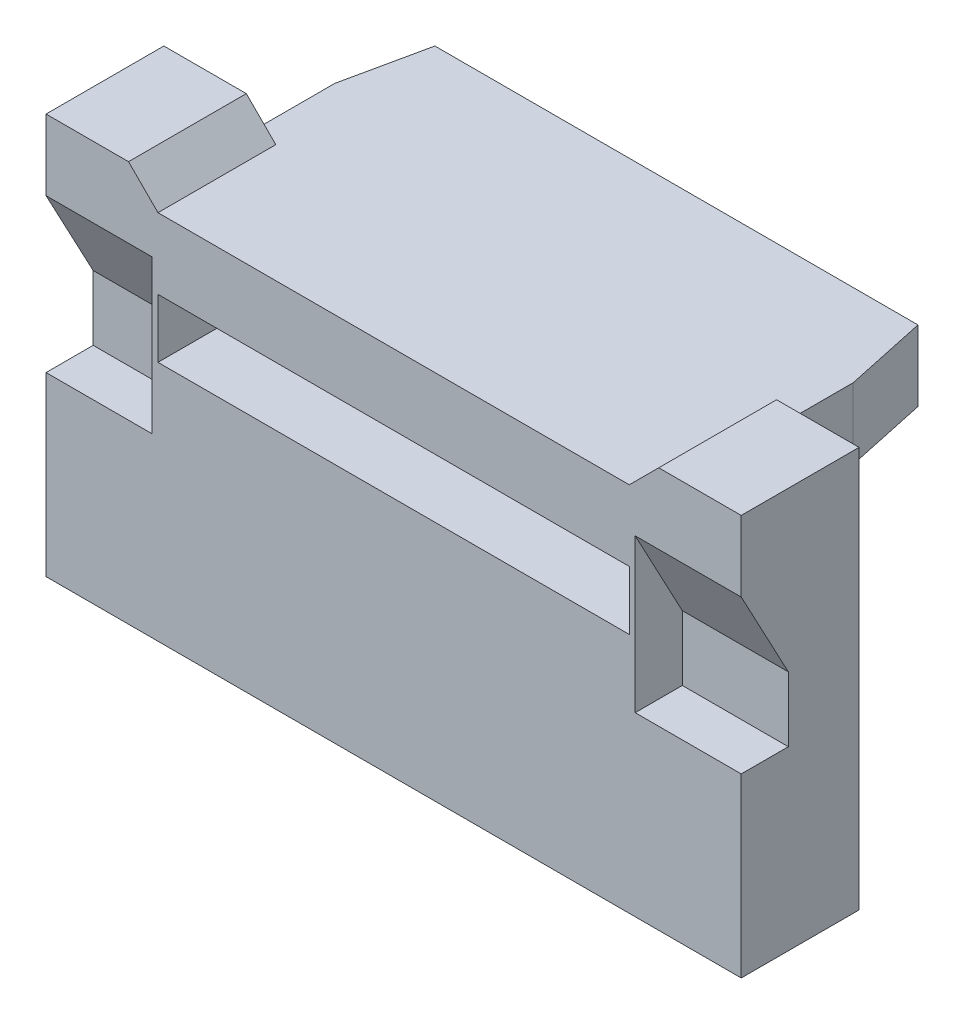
ISO-10303-21;
HEADER;
FILE_DESCRIPTION(('STEP AP214'),'2;1');
FILE_NAME('part.step','',(''),(''),'','','');
FILE_SCHEMA(('AUTOMOTIVE_DESIGN { 1 0 10303 214 1 1 1 1 }'));
ENDSEC;
DATA;
#1=APPLICATION_CONTEXT('core data for automotive mechanical design processes');
#2=APPLICATION_PROTOCOL_DEFINITION('international standard','automotive_design',2000,#1);
#3=PRODUCT_CONTEXT('',#1,'mechanical');
#4=PRODUCT('Part','Part','',(#3));
#5=PRODUCT_RELATED_PRODUCT_CATEGORY('part','',(#4));
#6=PRODUCT_DEFINITION_FORMATION('','',#4);
#7=PRODUCT_DEFINITION_CONTEXT('part definition',#1,'design');
#8=PRODUCT_DEFINITION('design','',#6,#7);
#9=PRODUCT_DEFINITION_SHAPE('','',#8);
#10=(LENGTH_UNIT() NAMED_UNIT(*) SI_UNIT(.MILLI.,.METRE.));
#11=(NAMED_UNIT(*) PLANE_ANGLE_UNIT() SI_UNIT($,.RADIAN.));
#12=(NAMED_UNIT(*) SI_UNIT($,.STERADIAN.) SOLID_ANGLE_UNIT());
#13=UNCERTAINTY_MEASURE_WITH_UNIT(LENGTH_MEASURE(1.E-05),#10,'distance_accuracy_value','');
#14=(GEOMETRIC_REPRESENTATION_CONTEXT(3) GLOBAL_UNCERTAINTY_ASSIGNED_CONTEXT((#13)) GLOBAL_UNIT_ASSIGNED_CONTEXT((#10,
#11,#12)) REPRESENTATION_CONTEXT('',''));
#15=CARTESIAN_POINT('',(0.,0.,0.));
#16=DIRECTION('',(0.,0.,1.));
#17=DIRECTION('',(1.,0.,0.));
#18=AXIS2_PLACEMENT_3D('',#15,#16,#17);
#19=CARTESIAN_POINT('',(-1.9,1.355,0.38));
#20=DIRECTION('',(0.,-1.,0.));
#21=DIRECTION('',(0.,0.,-1.));
#22=AXIS2_PLACEMENT_3D('',#19,#20,#21);
#23=PLANE('',#22);
#24=DIRECTION('',(1.,0.,0.));
#25=VECTOR('',#24,1.);
#26=CARTESIAN_POINT('',(-1.9,1.355,0.255));
#27=LINE('',#26,#25);
#28=CARTESIAN_POINT('',(-1.9,1.355,0.255));
#29=VERTEX_POINT('',#28);
#30=CARTESIAN_POINT('',(-1.7,1.355,0.255));
#31=VERTEX_POINT('',#30);
#32=EDGE_CURVE('E2420',#29,#31,#27,.T.);
#33=ORIENTED_EDGE('',*,*,#32,.F.);
#34=DIRECTION('',(0.,0.,-1.));
#35=VECTOR('',#34,1.);
#36=CARTESIAN_POINT('',(-1.9,1.355,0.38));
#37=LINE('',#36,#35);
#38=CARTESIAN_POINT('',(-1.9,1.355,-1.2));
#39=VERTEX_POINT('',#38);
#40=EDGE_CURVE('E2300',#29,#39,#37,.T.);
#41=ORIENTED_EDGE('',*,*,#40,.T.);
#42=DIRECTION('',(1.,0.,0.));
#43=VECTOR('',#42,1.);
#44=CARTESIAN_POINT('',(-1.9,1.355,-1.2));
#45=LINE('',#44,#43);
#46=CARTESIAN_POINT('',(-1.7,1.355,-1.2));
#47=VERTEX_POINT('',#46);
#48=EDGE_CURVE('E1339',#39,#47,#45,.T.);
#49=ORIENTED_EDGE('',*,*,#48,.T.);
#50=DIRECTION('',(0.,0.,-1.));
#51=VECTOR('',#50,1.);
#52=CARTESIAN_POINT('',(-1.7,1.355,0.38));
#53=LINE('',#52,#51);
#54=EDGE_CURVE('E2296',#31,#47,#53,.T.);
#55=ORIENTED_EDGE('',*,*,#54,.F.);
#56=EDGE_LOOP('',(#33,#41,#49,#55));
#57=FACE_BOUND('',#56,.T.);
#58=ADVANCED_FACE('F17',(#57),#23,.T.);
#59=CARTESIAN_POINT('',(-1.7,1.205,0.38));
#60=DIRECTION('',(0.,1.,0.));
#61=DIRECTION('',(1.,0.,0.));
#62=AXIS2_PLACEMENT_3D('',#59,#60,#61);
#63=PLANE('',#62);
#64=DIRECTION('',(-1.,0.,0.));
#65=VECTOR('',#64,1.);
#66=CARTESIAN_POINT('',(-1.7,1.205,0.105));
#67=LINE('',#66,#65);
#68=CARTESIAN_POINT('',(-1.7,1.205,0.105));
#69=VERTEX_POINT('',#68);
#70=CARTESIAN_POINT('',(-1.9,1.205,0.105));
#71=VERTEX_POINT('',#70);
#72=EDGE_CURVE('E11',#69,#71,#67,.T.);
#73=ORIENTED_EDGE('',*,*,#72,.F.);
#74=DIRECTION('',(0.,0.,-1.));
#75=VECTOR('',#74,1.);
#76=CARTESIAN_POINT('',(-1.7,1.205,0.38));
#77=LINE('',#76,#75);
#78=CARTESIAN_POINT('',(-1.7,1.205,-1.2));
#79=VERTEX_POINT('',#78);
#80=EDGE_CURVE('E2299',#69,#79,#77,.T.);
#81=ORIENTED_EDGE('',*,*,#80,.T.);
#82=DIRECTION('',(-1.,0.,0.));
#83=VECTOR('',#82,1.);
#84=CARTESIAN_POINT('',(-1.7,1.205,-1.2));
#85=LINE('',#84,#83);
#86=CARTESIAN_POINT('',(-1.9,1.205,-1.2));
#87=VERTEX_POINT('',#86);
#88=EDGE_CURVE('E1249',#79,#87,#85,.T.);
#89=ORIENTED_EDGE('',*,*,#88,.T.);
#90=DIRECTION('',(0.,0.,-1.));
#91=VECTOR('',#90,1.);
#92=CARTESIAN_POINT('',(-1.9,1.205,0.38));
#93=LINE('',#92,#91);
#94=EDGE_CURVE('E2276',#71,#87,#93,.T.);
#95=ORIENTED_EDGE('',*,*,#94,.F.);
#96=EDGE_LOOP('',(#73,#81,#89,#95));
#97=FACE_BOUND('',#96,.T.);
#98=ADVANCED_FACE('F2603',(#97),#63,.T.);
#99=CARTESIAN_POINT('',(-1.7,-1.7,0.105));
#100=DIRECTION('',(0.,0.,1.));
#101=DIRECTION('',(0.,-1.,0.));
#102=AXIS2_PLACEMENT_3D('',#99,#100,#101);
#103=PLANE('',#102);
#104=DIRECTION('',(0.,1.,0.));
#105=VECTOR('',#104,1.);
#106=CARTESIAN_POINT('',(-1.7,-1.7,0.105));
#107=LINE('',#106,#105);
#108=CARTESIAN_POINT('',(-1.7,0.85,0.105));
#109=VERTEX_POINT('',#108);
#110=EDGE_CURVE('E25',#109,#69,#107,.T.);
#111=ORIENTED_EDGE('',*,*,#110,.T.);
#112=ORIENTED_EDGE('',*,*,#72,.T.);
#113=DIRECTION('',(0.,1.,0.));
#114=VECTOR('',#113,1.);
#115=CARTESIAN_POINT('',(-1.9,-1.7,0.105));
#116=LINE('',#115,#114);
#117=CARTESIAN_POINT('',(-1.9,0.85,0.105));
#118=VERTEX_POINT('',#117);
#119=EDGE_CURVE('E2272',#118,#71,#116,.T.);
#120=ORIENTED_EDGE('',*,*,#119,.F.);
#121=DIRECTION('',(-1.,0.,0.));
#122=VECTOR('',#121,1.);
#123=CARTESIAN_POINT('',(4.270110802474,0.85,0.105));
#124=LINE('',#123,#122);
#125=EDGE_CURVE('E1148',#109,#118,#124,.T.);
#126=ORIENTED_EDGE('',*,*,#125,.F.);
#127=EDGE_LOOP('',(#111,#112,#120,#126));
#128=FACE_BOUND('',#127,.T.);
#129=ADVANCED_FACE('F2597',(#128),#103,.T.);
#130=CARTESIAN_POINT('',(-1.7,-1.7,0.255));
#131=DIRECTION('',(-1.,0.,0.));
#132=DIRECTION('',(0.,0.,1.));
#133=AXIS2_PLACEMENT_3D('',#130,#131,#132);
#134=PLANE('',#133);
#135=DIRECTION('',(0.,1.,0.));
#136=VECTOR('',#135,1.);
#137=CARTESIAN_POINT('',(-1.7,-1.7,0.255));
#138=LINE('',#137,#136);
#139=CARTESIAN_POINT('',(-1.7,0.85,0.255));
#140=VERTEX_POINT('',#139);
#141=EDGE_CURVE('E2277',#140,#31,#138,.T.);
#142=ORIENTED_EDGE('',*,*,#141,.T.);
#143=ORIENTED_EDGE('',*,*,#54,.T.);
#144=DIRECTION('',(0.,-1.,0.));
#145=VECTOR('',#144,1.);
#146=CARTESIAN_POINT('',(-1.7,1.355,-1.2));
#147=LINE('',#146,#145);
#148=EDGE_CURVE('E1253',#47,#79,#147,.T.);
#149=ORIENTED_EDGE('',*,*,#148,.T.);
#150=ORIENTED_EDGE('',*,*,#80,.F.);
#151=ORIENTED_EDGE('',*,*,#110,.F.);
#152=DIRECTION('',(0.,0.,-1.));
#153=VECTOR('',#152,1.);
#154=CARTESIAN_POINT('',(-1.7,0.85,-1.2));
#155=LINE('',#154,#153);
#156=EDGE_CURVE('E1471',#140,#109,#155,.T.);
#157=ORIENTED_EDGE('',*,*,#156,.F.);
#158=EDGE_LOOP('',(#142,#143,#149,#150,#151,#157));
#159=FACE_BOUND('',#158,.T.);
#160=ADVANCED_FACE('F2600',(#159),#134,.T.);
#161=CARTESIAN_POINT('',(-1.9,-1.7,0.105));
#162=DIRECTION('',(1.,0.,0.));
#163=DIRECTION('',(0.,1.,0.));
#164=AXIS2_PLACEMENT_3D('',#161,#162,#163);
#165=PLANE('',#164);
#166=ORIENTED_EDGE('',*,*,#119,.T.);
#167=ORIENTED_EDGE('',*,*,#94,.T.);
#168=DIRECTION('',(0.,1.,0.));
#169=VECTOR('',#168,1.);
#170=CARTESIAN_POINT('',(-1.9,1.205,-1.2));
#171=LINE('',#170,#169);
#172=EDGE_CURVE('E1254',#87,#39,#171,.T.);
#173=ORIENTED_EDGE('',*,*,#172,.T.);
#174=ORIENTED_EDGE('',*,*,#40,.F.);
#175=DIRECTION('',(0.,1.,0.));
#176=VECTOR('',#175,1.);
#177=CARTESIAN_POINT('',(-1.9,-1.7,0.255));
#178=LINE('',#177,#176);
#179=CARTESIAN_POINT('',(-1.9,0.85,0.255));
#180=VERTEX_POINT('',#179);
#181=EDGE_CURVE('E2424',#180,#29,#178,.T.);
#182=ORIENTED_EDGE('',*,*,#181,.F.);
#183=DIRECTION('',(0.,0.,1.));
#184=VECTOR('',#183,1.);
#185=CARTESIAN_POINT('',(-1.9,0.85,-1.2));
#186=LINE('',#185,#184);
#187=EDGE_CURVE('E1143',#118,#180,#186,.T.);
#188=ORIENTED_EDGE('',*,*,#187,.F.);
#189=EDGE_LOOP('',(#166,#167,#173,#174,#182,#188));
#190=FACE_BOUND('',#189,.T.);
#191=ADVANCED_FACE('F2609',(#190),#165,.T.);
#192=CARTESIAN_POINT('',(-1.9,-1.7,0.255));
#193=DIRECTION('',(0.,0.,-1.));
#194=DIRECTION('',(0.,-1.,0.));
#195=AXIS2_PLACEMENT_3D('',#192,#193,#194);
#196=PLANE('',#195);
#197=ORIENTED_EDGE('',*,*,#181,.T.);
#198=ORIENTED_EDGE('',*,*,#32,.T.);
#199=ORIENTED_EDGE('',*,*,#141,.F.);
#200=DIRECTION('',(1.,0.,0.));
#201=VECTOR('',#200,1.);
#202=CARTESIAN_POINT('',(4.270110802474,0.85,0.255));
#203=LINE('',#202,#201);
#204=EDGE_CURVE('E1147',#180,#140,#203,.T.);
#205=ORIENTED_EDGE('',*,*,#204,.F.);
#206=EDGE_LOOP('',(#197,#198,#199,#205));
#207=FACE_BOUND('',#206,.T.);
#208=ADVANCED_FACE('F2617',(#207),#196,.T.);
#209=CARTESIAN_POINT('',(-1.9,-1.7,0.255));
#210=DIRECTION('',(0.,0.,-1.));
#211=DIRECTION('',(0.,-1.,0.));
#212=AXIS2_PLACEMENT_3D('',#209,#210,#211);
#213=PLANE('',#212);
#214=DIRECTION('',(0.,1.,0.));
#215=VECTOR('',#214,1.);
#216=CARTESIAN_POINT('',(-1.7,-1.7,0.255));
#217=LINE('',#216,#215);
#218=CARTESIAN_POINT('',(-1.7,-1.7,0.255));
#219=VERTEX_POINT('',#218);
#220=CARTESIAN_POINT('',(-1.7,0.35,0.255));
#221=VERTEX_POINT('',#220);
#222=EDGE_CURVE('E2582',#219,#221,#217,.T.);
#223=ORIENTED_EDGE('',*,*,#222,.F.);
#224=DIRECTION('',(1.,0.,0.));
#225=VECTOR('',#224,1.);
#226=CARTESIAN_POINT('',(-1.9,-1.7,0.255));
#227=LINE('',#226,#225);
#228=CARTESIAN_POINT('',(-1.9,-1.7,0.255));
#229=VERTEX_POINT('',#228);
#230=EDGE_CURVE('E1142',#229,#219,#227,.T.);
#231=ORIENTED_EDGE('',*,*,#230,.F.);
#232=DIRECTION('',(0.,1.,0.));
#233=VECTOR('',#232,1.);
#234=CARTESIAN_POINT('',(-1.9,-1.7,0.255));
#235=LINE('',#234,#233);
#236=CARTESIAN_POINT('',(-1.9,0.35,0.255));
#237=VERTEX_POINT('',#236);
#238=EDGE_CURVE('E2579',#229,#237,#235,.T.);
#239=ORIENTED_EDGE('',*,*,#238,.T.);
#240=DIRECTION('',(-1.,0.,0.));
#241=VECTOR('',#240,1.);
#242=CARTESIAN_POINT('',(2.,0.35,0.255));
#243=LINE('',#242,#241);
#244=EDGE_CURVE('E1745',#221,#237,#243,.T.);
#245=ORIENTED_EDGE('',*,*,#244,.F.);
#246=EDGE_LOOP('',(#223,#231,#239,#245));
#247=FACE_BOUND('',#246,.T.);
#248=ADVANCED_FACE('F2635',(#247),#213,.T.);
#249=CARTESIAN_POINT('',(-1.7,-1.7,0.255));
#250=DIRECTION('',(-1.,0.,0.));
#251=DIRECTION('',(0.,0.,1.));
#252=AXIS2_PLACEMENT_3D('',#249,#250,#251);
#253=PLANE('',#252);
#254=DIRECTION('',(0.,1.,0.));
#255=VECTOR('',#254,1.);
#256=CARTESIAN_POINT('',(-1.7,1.7,0.2));
#257=LINE('',#256,#255);
#258=CARTESIAN_POINT('',(-1.7,-1.7,0.2));
#259=VERTEX_POINT('',#258);
#260=CARTESIAN_POINT('',(-1.7,0.35,0.2));
#261=VERTEX_POINT('',#260);
#262=EDGE_CURVE('E1997',#259,#261,#257,.T.);
#263=ORIENTED_EDGE('',*,*,#262,.F.);
#264=DIRECTION('',(0.,0.,-1.));
#265=VECTOR('',#264,1.);
#266=CARTESIAN_POINT('',(-1.7,-1.7,0.255));
#267=LINE('',#266,#265);
#268=EDGE_CURVE('E1194',#219,#259,#267,.T.);
#269=ORIENTED_EDGE('',*,*,#268,.F.);
#270=ORIENTED_EDGE('',*,*,#222,.T.);
#271=DIRECTION('',(0.,0.,1.));
#272=VECTOR('',#271,1.);
#273=CARTESIAN_POINT('',(-1.7,0.35,-6.020110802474));
#274=LINE('',#273,#272);
#275=EDGE_CURVE('E1841',#261,#221,#274,.T.);
#276=ORIENTED_EDGE('',*,*,#275,.F.);
#277=EDGE_LOOP('',(#263,#269,#270,#276));
#278=FACE_BOUND('',#277,.T.);
#279=ADVANCED_FACE('F2638',(#278),#253,.T.);
#280=CARTESIAN_POINT('',(-1.9,-1.7,0.105));
#281=DIRECTION('',(1.,0.,0.));
#282=DIRECTION('',(0.,1.,0.));
#283=AXIS2_PLACEMENT_3D('',#280,#281,#282);
#284=PLANE('',#283);
#285=ORIENTED_EDGE('',*,*,#238,.F.);
#286=DIRECTION('',(0.,0.,1.));
#287=VECTOR('',#286,1.);
#288=CARTESIAN_POINT('',(-1.9,-1.7,0.105));
#289=LINE('',#288,#287);
#290=CARTESIAN_POINT('',(-1.9,-1.7,0.2));
#291=VERTEX_POINT('',#290);
#292=EDGE_CURVE('E1215',#291,#229,#289,.T.);
#293=ORIENTED_EDGE('',*,*,#292,.F.);
#294=DIRECTION('',(0.,-1.,0.));
#295=VECTOR('',#294,1.);
#296=CARTESIAN_POINT('',(-1.9,1.7,0.2));
#297=LINE('',#296,#295);
#298=CARTESIAN_POINT('',(-1.9,0.35,0.2));
#299=VERTEX_POINT('',#298);
#300=EDGE_CURVE('E1973',#299,#291,#297,.T.);
#301=ORIENTED_EDGE('',*,*,#300,.F.);
#302=DIRECTION('',(0.,0.,-1.));
#303=VECTOR('',#302,1.);
#304=CARTESIAN_POINT('',(-1.9,0.35,-6.020110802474));
#305=LINE('',#304,#303);
#306=EDGE_CURVE('E1740',#237,#299,#305,.T.);
#307=ORIENTED_EDGE('',*,*,#306,.F.);
#308=EDGE_LOOP('',(#285,#293,#301,#307));
#309=FACE_BOUND('',#308,.T.);
#310=ADVANCED_FACE('F2642',(#309),#284,.T.);
#311=CARTESIAN_POINT('',(-1.5,1.355,0.38));
#312=DIRECTION('',(0.,-1.,0.));
#313=DIRECTION('',(0.,0.,-1.));
#314=AXIS2_PLACEMENT_3D('',#311,#312,#313);
#315=PLANE('',#314);
#316=DIRECTION('',(1.,0.,0.));
#317=VECTOR('',#316,1.);
#318=CARTESIAN_POINT('',(-1.5,1.355,0.255));
#319=LINE('',#318,#317);
#320=CARTESIAN_POINT('',(-1.5,1.355,0.255));
#321=VERTEX_POINT('',#320);
#322=CARTESIAN_POINT('',(-1.3,1.355,0.255));
#323=VERTEX_POINT('',#322);
#324=EDGE_CURVE('E1113',#321,#323,#319,.T.);
#325=ORIENTED_EDGE('',*,*,#324,.F.);
#326=DIRECTION('',(0.,0.,-1.));
#327=VECTOR('',#326,1.);
#328=CARTESIAN_POINT('',(-1.5,1.355,0.38));
#329=LINE('',#328,#327);
#330=CARTESIAN_POINT('',(-1.5,1.355,-1.2));
#331=VERTEX_POINT('',#330);
#332=EDGE_CURVE('E1107',#321,#331,#329,.T.);
#333=ORIENTED_EDGE('',*,*,#332,.T.);
#334=DIRECTION('',(1.,0.,0.));
#335=VECTOR('',#334,1.);
#336=CARTESIAN_POINT('',(-1.5,1.355,-1.2));
#337=LINE('',#336,#335);
#338=CARTESIAN_POINT('',(-1.3,1.355,-1.2));
#339=VERTEX_POINT('',#338);
#340=EDGE_CURVE('E1111',#331,#339,#337,.T.);
#341=ORIENTED_EDGE('',*,*,#340,.T.);
#342=DIRECTION('',(0.,0.,-1.));
#343=VECTOR('',#342,1.);
#344=CARTESIAN_POINT('',(-1.3,1.355,0.38));
#345=LINE('',#344,#343);
#346=EDGE_CURVE('E1117',#323,#339,#345,.T.);
#347=ORIENTED_EDGE('',*,*,#346,.F.);
#348=EDGE_LOOP('',(#325,#333,#341,#347));
#349=FACE_BOUND('',#348,.T.);
#350=ADVANCED_FACE('F1109',(#349),#315,.T.);
#351=CARTESIAN_POINT('',(-1.3,1.205,0.38));
#352=DIRECTION('',(0.,1.,0.));
#353=DIRECTION('',(1.,0.,0.));
#354=AXIS2_PLACEMENT_3D('',#351,#352,#353);
#355=PLANE('',#354);
#356=DIRECTION('',(-1.,0.,0.));
#357=VECTOR('',#356,1.);
#358=CARTESIAN_POINT('',(-1.3,1.205,0.105));
#359=LINE('',#358,#357);
#360=CARTESIAN_POINT('',(-1.3,1.205,0.105));
#361=VERTEX_POINT('',#360);
#362=CARTESIAN_POINT('',(-1.5,1.205,0.105));
#363=VERTEX_POINT('',#362);
#364=EDGE_CURVE('E2576',#361,#363,#359,.T.);
#365=ORIENTED_EDGE('',*,*,#364,.F.);
#366=DIRECTION('',(0.,0.,-1.));
#367=VECTOR('',#366,1.);
#368=CARTESIAN_POINT('',(-1.3,1.205,0.38));
#369=LINE('',#368,#367);
#370=CARTESIAN_POINT('',(-1.3,1.205,-1.2));
#371=VERTEX_POINT('',#370);
#372=EDGE_CURVE('E1750',#361,#371,#369,.T.);
#373=ORIENTED_EDGE('',*,*,#372,.T.);
#374=DIRECTION('',(-1.,0.,0.));
#375=VECTOR('',#374,1.);
#376=CARTESIAN_POINT('',(-1.3,1.205,-1.2));
#377=LINE('',#376,#375);
#378=CARTESIAN_POINT('',(-1.5,1.205,-1.2));
#379=VERTEX_POINT('',#378);
#380=EDGE_CURVE('E1129',#371,#379,#377,.T.);
#381=ORIENTED_EDGE('',*,*,#380,.T.);
#382=DIRECTION('',(0.,0.,-1.));
#383=VECTOR('',#382,1.);
#384=CARTESIAN_POINT('',(-1.5,1.205,0.38));
#385=LINE('',#384,#383);
#386=EDGE_CURVE('E1118',#363,#379,#385,.T.);
#387=ORIENTED_EDGE('',*,*,#386,.F.);
#388=EDGE_LOOP('',(#365,#373,#381,#387));
#389=FACE_BOUND('',#388,.T.);
#390=ADVANCED_FACE('F2646',(#389),#355,.T.);
#391=CARTESIAN_POINT('',(-1.3,-1.7,0.105));
#392=DIRECTION('',(0.,0.,1.));
#393=DIRECTION('',(0.,-1.,0.));
#394=AXIS2_PLACEMENT_3D('',#391,#392,#393);
#395=PLANE('',#394);
#396=DIRECTION('',(0.,1.,0.));
#397=VECTOR('',#396,1.);
#398=CARTESIAN_POINT('',(-1.3,-1.7,0.105));
#399=LINE('',#398,#397);
#400=CARTESIAN_POINT('',(-1.3,0.85,0.105));
#401=VERTEX_POINT('',#400);
#402=EDGE_CURVE('E1753',#401,#361,#399,.T.);
#403=ORIENTED_EDGE('',*,*,#402,.T.);
#404=ORIENTED_EDGE('',*,*,#364,.T.);
#405=DIRECTION('',(0.,1.,0.));
#406=VECTOR('',#405,1.);
#407=CARTESIAN_POINT('',(-1.5,-1.7,0.105));
#408=LINE('',#407,#406);
#409=CARTESIAN_POINT('',(-1.5,0.85,0.105));
#410=VERTEX_POINT('',#409);
#411=EDGE_CURVE('E2240',#410,#363,#408,.T.);
#412=ORIENTED_EDGE('',*,*,#411,.F.);
#413=DIRECTION('',(-1.,0.,0.));
#414=VECTOR('',#413,1.);
#415=CARTESIAN_POINT('',(4.270110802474,0.85,0.105));
#416=LINE('',#415,#414);
#417=EDGE_CURVE('E1289',#401,#410,#416,.T.);
#418=ORIENTED_EDGE('',*,*,#417,.F.);
#419=EDGE_LOOP('',(#403,#404,#412,#418));
#420=FACE_BOUND('',#419,.T.);
#421=ADVANCED_FACE('F2647',(#420),#395,.T.);
#422=CARTESIAN_POINT('',(-1.3,-1.7,0.255));
#423=DIRECTION('',(-1.,0.,0.));
#424=DIRECTION('',(0.,0.,1.));
#425=AXIS2_PLACEMENT_3D('',#422,#423,#424);
#426=PLANE('',#425);
#427=DIRECTION('',(0.,1.,0.));
#428=VECTOR('',#427,1.);
#429=CARTESIAN_POINT('',(-1.3,-1.7,0.255));
#430=LINE('',#429,#428);
#431=CARTESIAN_POINT('',(-1.3,0.85,0.255));
#432=VERTEX_POINT('',#431);
#433=EDGE_CURVE('E1201',#432,#323,#430,.T.);
#434=ORIENTED_EDGE('',*,*,#433,.T.);
#435=ORIENTED_EDGE('',*,*,#346,.T.);
#436=DIRECTION('',(0.,-1.,0.));
#437=VECTOR('',#436,1.);
#438=CARTESIAN_POINT('',(-1.3,1.355,-1.2));
#439=LINE('',#438,#437);
#440=EDGE_CURVE('E1134',#339,#371,#439,.T.);
#441=ORIENTED_EDGE('',*,*,#440,.T.);
#442=ORIENTED_EDGE('',*,*,#372,.F.);
#443=ORIENTED_EDGE('',*,*,#402,.F.);
#444=DIRECTION('',(0.,0.,-1.));
#445=VECTOR('',#444,1.);
#446=CARTESIAN_POINT('',(-1.3,0.85,-1.2));
#447=LINE('',#446,#445);
#448=EDGE_CURVE('E1440',#432,#401,#447,.T.);
#449=ORIENTED_EDGE('',*,*,#448,.F.);
#450=EDGE_LOOP('',(#434,#435,#441,#442,#443,#449));
#451=FACE_BOUND('',#450,.T.);
#452=ADVANCED_FACE('F2650',(#451),#426,.T.);
#453=CARTESIAN_POINT('',(-1.5,-1.7,0.105));
#454=DIRECTION('',(1.,0.,0.));
#455=DIRECTION('',(0.,1.,0.));
#456=AXIS2_PLACEMENT_3D('',#453,#454,#455);
#457=PLANE('',#456);
#458=ORIENTED_EDGE('',*,*,#411,.T.);
#459=ORIENTED_EDGE('',*,*,#386,.T.);
#460=DIRECTION('',(0.,1.,0.));
#461=VECTOR('',#460,1.);
#462=CARTESIAN_POINT('',(-1.5,1.205,-1.2));
#463=LINE('',#462,#461);
#464=EDGE_CURVE('E1121',#379,#331,#463,.T.);
#465=ORIENTED_EDGE('',*,*,#464,.T.);
#466=ORIENTED_EDGE('',*,*,#332,.F.);
#467=DIRECTION('',(0.,1.,0.));
#468=VECTOR('',#467,1.);
#469=CARTESIAN_POINT('',(-1.5,-1.7,0.255));
#470=LINE('',#469,#468);
#471=CARTESIAN_POINT('',(-1.5,0.85,0.255));
#472=VERTEX_POINT('',#471);
#473=EDGE_CURVE('E1202',#472,#321,#470,.T.);
#474=ORIENTED_EDGE('',*,*,#473,.F.);
#475=DIRECTION('',(0.,0.,1.));
#476=VECTOR('',#475,1.);
#477=CARTESIAN_POINT('',(-1.5,0.85,-1.2));
#478=LINE('',#477,#476);
#479=EDGE_CURVE('E1245',#410,#472,#478,.T.);
#480=ORIENTED_EDGE('',*,*,#479,.F.);
#481=EDGE_LOOP('',(#458,#459,#465,#466,#474,#480));
#482=FACE_BOUND('',#481,.T.);
#483=ADVANCED_FACE('F1123',(#482),#457,.T.);
#484=CARTESIAN_POINT('',(-1.5,-1.7,0.255));
#485=DIRECTION('',(0.,0.,-1.));
#486=DIRECTION('',(0.,-1.,0.));
#487=AXIS2_PLACEMENT_3D('',#484,#485,#486);
#488=PLANE('',#487);
#489=ORIENTED_EDGE('',*,*,#473,.T.);
#490=ORIENTED_EDGE('',*,*,#324,.T.);
#491=ORIENTED_EDGE('',*,*,#433,.F.);
#492=DIRECTION('',(1.,0.,0.));
#493=VECTOR('',#492,1.);
#494=CARTESIAN_POINT('',(4.270110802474,0.85,0.255));
#495=LINE('',#494,#493);
#496=EDGE_CURVE('E1240',#472,#432,#495,.T.);
#497=ORIENTED_EDGE('',*,*,#496,.F.);
#498=EDGE_LOOP('',(#489,#490,#491,#497));
#499=FACE_BOUND('',#498,.T.);
#500=ADVANCED_FACE('F2749',(#499),#488,.T.);
#501=CARTESIAN_POINT('',(-1.5,-1.7,0.255));
#502=DIRECTION('',(0.,0.,-1.));
#503=DIRECTION('',(0.,-1.,0.));
#504=AXIS2_PLACEMENT_3D('',#501,#502,#503);
#505=PLANE('',#504);
#506=DIRECTION('',(0.,1.,0.));
#507=VECTOR('',#506,1.);
#508=CARTESIAN_POINT('',(-1.3,-1.7,0.255));
#509=LINE('',#508,#507);
#510=CARTESIAN_POINT('',(-1.3,-1.7,0.255));
#511=VERTEX_POINT('',#510);
#512=CARTESIAN_POINT('',(-1.3,0.35,0.255));
#513=VERTEX_POINT('',#512);
#514=EDGE_CURVE('E2561',#511,#513,#509,.T.);
#515=ORIENTED_EDGE('',*,*,#514,.F.);
#516=DIRECTION('',(1.,0.,0.));
#517=VECTOR('',#516,1.);
#518=CARTESIAN_POINT('',(-1.5,-1.7,0.255));
#519=LINE('',#518,#517);
#520=CARTESIAN_POINT('',(-1.5,-1.7,0.255));
#521=VERTEX_POINT('',#520);
#522=EDGE_CURVE('E1401',#521,#511,#519,.T.);
#523=ORIENTED_EDGE('',*,*,#522,.F.);
#524=DIRECTION('',(0.,1.,0.));
#525=VECTOR('',#524,1.);
#526=CARTESIAN_POINT('',(-1.5,-1.7,0.255));
#527=LINE('',#526,#525);
#528=CARTESIAN_POINT('',(-1.5,0.35,0.255));
#529=VERTEX_POINT('',#528);
#530=EDGE_CURVE('E2558',#521,#529,#527,.T.);
#531=ORIENTED_EDGE('',*,*,#530,.T.);
#532=DIRECTION('',(-1.,0.,0.));
#533=VECTOR('',#532,1.);
#534=CARTESIAN_POINT('',(2.,0.35,0.255));
#535=LINE('',#534,#533);
#536=EDGE_CURVE('E1942',#513,#529,#535,.T.);
#537=ORIENTED_EDGE('',*,*,#536,.F.);
#538=EDGE_LOOP('',(#515,#523,#531,#537));
#539=FACE_BOUND('',#538,.T.);
#540=ADVANCED_FACE('F2746',(#539),#505,.T.);
#541=CARTESIAN_POINT('',(-1.3,-1.7,0.255));
#542=DIRECTION('',(-1.,0.,0.));
#543=DIRECTION('',(0.,0.,1.));
#544=AXIS2_PLACEMENT_3D('',#541,#542,#543);
#545=PLANE('',#544);
#546=DIRECTION('',(0.,1.,0.));
#547=VECTOR('',#546,1.);
#548=CARTESIAN_POINT('',(-1.3,1.7,0.2));
#549=LINE('',#548,#547);
#550=CARTESIAN_POINT('',(-1.3,-1.7,0.2));
#551=VERTEX_POINT('',#550);
#552=CARTESIAN_POINT('',(-1.3,0.35,0.2));
#553=VERTEX_POINT('',#552);
#554=EDGE_CURVE('E2007',#551,#553,#549,.T.);
#555=ORIENTED_EDGE('',*,*,#554,.F.);
#556=DIRECTION('',(0.,0.,-1.));
#557=VECTOR('',#556,1.);
#558=CARTESIAN_POINT('',(-1.3,-1.7,0.255));
#559=LINE('',#558,#557);
#560=EDGE_CURVE('E1239',#511,#551,#559,.T.);
#561=ORIENTED_EDGE('',*,*,#560,.F.);
#562=ORIENTED_EDGE('',*,*,#514,.T.);
#563=DIRECTION('',(0.,0.,1.));
#564=VECTOR('',#563,1.);
#565=CARTESIAN_POINT('',(-1.3,0.35,-6.020110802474));
#566=LINE('',#565,#564);
#567=EDGE_CURVE('E1938',#553,#513,#566,.T.);
#568=ORIENTED_EDGE('',*,*,#567,.F.);
#569=EDGE_LOOP('',(#555,#561,#562,#568));
#570=FACE_BOUND('',#569,.T.);
#571=ADVANCED_FACE('F2726',(#570),#545,.T.);
#572=CARTESIAN_POINT('',(-1.5,-1.7,0.105));
#573=DIRECTION('',(1.,0.,0.));
#574=DIRECTION('',(0.,1.,0.));
#575=AXIS2_PLACEMENT_3D('',#572,#573,#574);
#576=PLANE('',#575);
#577=ORIENTED_EDGE('',*,*,#530,.F.);
#578=DIRECTION('',(0.,0.,1.));
#579=VECTOR('',#578,1.);
#580=CARTESIAN_POINT('',(-1.5,-1.7,0.105));
#581=LINE('',#580,#579);
#582=CARTESIAN_POINT('',(-1.5,-1.7,0.2));
#583=VERTEX_POINT('',#582);
#584=EDGE_CURVE('E1397',#583,#521,#581,.T.);
#585=ORIENTED_EDGE('',*,*,#584,.F.);
#586=DIRECTION('',(0.,-1.,0.));
#587=VECTOR('',#586,1.);
#588=CARTESIAN_POINT('',(-1.5,1.7,0.2));
#589=LINE('',#588,#587);
#590=CARTESIAN_POINT('',(-1.5,0.35,0.2));
#591=VERTEX_POINT('',#590);
#592=EDGE_CURVE('E2000',#591,#583,#589,.T.);
#593=ORIENTED_EDGE('',*,*,#592,.F.);
#594=DIRECTION('',(0.,0.,-1.));
#595=VECTOR('',#594,1.);
#596=CARTESIAN_POINT('',(-1.5,0.35,-6.020110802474));
#597=LINE('',#596,#595);
#598=EDGE_CURVE('E1946',#529,#591,#597,.T.);
#599=ORIENTED_EDGE('',*,*,#598,.F.);
#600=EDGE_LOOP('',(#577,#585,#593,#599));
#601=FACE_BOUND('',#600,.T.);
#602=ADVANCED_FACE('F2722',(#601),#576,.T.);
#603=CARTESIAN_POINT('',(-1.1,1.355,0.38));
#604=DIRECTION('',(0.,-1.,0.));
#605=DIRECTION('',(0.,0.,-1.));
#606=AXIS2_PLACEMENT_3D('',#603,#604,#605);
#607=PLANE('',#606);
#608=DIRECTION('',(1.,0.,0.));
#609=VECTOR('',#608,1.);
#610=CARTESIAN_POINT('',(-1.1,1.355,0.255));
#611=LINE('',#610,#609);
#612=CARTESIAN_POINT('',(-1.1,1.355,0.255));
#613=VERTEX_POINT('',#612);
#614=CARTESIAN_POINT('',(-0.9,1.355,0.255));
#615=VERTEX_POINT('',#614);
#616=EDGE_CURVE('E2538',#613,#615,#611,.T.);
#617=ORIENTED_EDGE('',*,*,#616,.F.);
#618=DIRECTION('',(0.,0.,-1.));
#619=VECTOR('',#618,1.);
#620=CARTESIAN_POINT('',(-1.1,1.355,0.38));
#621=LINE('',#620,#619);
#622=CARTESIAN_POINT('',(-1.1,1.355,-1.2));
#623=VERTEX_POINT('',#622);
#624=EDGE_CURVE('E2547',#613,#623,#621,.T.);
#625=ORIENTED_EDGE('',*,*,#624,.T.);
#626=DIRECTION('',(1.,0.,0.));
#627=VECTOR('',#626,1.);
#628=CARTESIAN_POINT('',(-1.1,1.355,-1.2));
#629=LINE('',#628,#627);
#630=CARTESIAN_POINT('',(-0.9,1.355,-1.2));
#631=VERTEX_POINT('',#630);
#632=EDGE_CURVE('E1417',#623,#631,#629,.T.);
#633=ORIENTED_EDGE('',*,*,#632,.T.);
#634=DIRECTION('',(0.,0.,-1.));
#635=VECTOR('',#634,1.);
#636=CARTESIAN_POINT('',(-0.9,1.355,0.38));
#637=LINE('',#636,#635);
#638=EDGE_CURVE('E2308',#615,#631,#637,.T.);
#639=ORIENTED_EDGE('',*,*,#638,.F.);
#640=EDGE_LOOP('',(#617,#625,#633,#639));
#641=FACE_BOUND('',#640,.T.);
#642=ADVANCED_FACE('F2725',(#641),#607,.T.);
#643=CARTESIAN_POINT('',(-0.9,1.205,0.38));
#644=DIRECTION('',(0.,1.,0.));
#645=DIRECTION('',(1.,0.,0.));
#646=AXIS2_PLACEMENT_3D('',#643,#644,#645);
#647=PLANE('',#646);
#648=DIRECTION('',(-1.,0.,0.));
#649=VECTOR('',#648,1.);
#650=CARTESIAN_POINT('',(-0.9,1.205,0.105));
#651=LINE('',#650,#649);
#652=CARTESIAN_POINT('',(-0.9,1.205,0.105));
#653=VERTEX_POINT('',#652);
#654=CARTESIAN_POINT('',(-1.1,1.205,0.105));
#655=VERTEX_POINT('',#654);
#656=EDGE_CURVE('E2555',#653,#655,#651,.T.);
#657=ORIENTED_EDGE('',*,*,#656,.F.);
#658=DIRECTION('',(0.,0.,-1.));
#659=VECTOR('',#658,1.);
#660=CARTESIAN_POINT('',(-0.9,1.205,0.38));
#661=LINE('',#660,#659);
#662=CARTESIAN_POINT('',(-0.9,1.205,-1.2));
#663=VERTEX_POINT('',#662);
#664=EDGE_CURVE('E2304',#653,#663,#661,.T.);
#665=ORIENTED_EDGE('',*,*,#664,.T.);
#666=DIRECTION('',(-1.,0.,0.));
#667=VECTOR('',#666,1.);
#668=CARTESIAN_POINT('',(-0.9,1.205,-1.2));
#669=LINE('',#668,#667);
#670=CARTESIAN_POINT('',(-1.1,1.205,-1.2));
#671=VERTEX_POINT('',#670);
#672=EDGE_CURVE('E1431',#663,#671,#669,.T.);
#673=ORIENTED_EDGE('',*,*,#672,.T.);
#674=DIRECTION('',(0.,0.,-1.));
#675=VECTOR('',#674,1.);
#676=CARTESIAN_POINT('',(-1.1,1.205,0.38));
#677=LINE('',#676,#675);
#678=EDGE_CURVE('E2411',#655,#671,#677,.T.);
#679=ORIENTED_EDGE('',*,*,#678,.F.);
#680=EDGE_LOOP('',(#657,#665,#673,#679));
#681=FACE_BOUND('',#680,.T.);
#682=ADVANCED_FACE('F2991',(#681),#647,.T.);
#683=CARTESIAN_POINT('',(-0.9,-1.7,0.105));
#684=DIRECTION('',(0.,0.,1.));
#685=DIRECTION('',(0.,-1.,0.));
#686=AXIS2_PLACEMENT_3D('',#683,#684,#685);
#687=PLANE('',#686);
#688=DIRECTION('',(0.,1.,0.));
#689=VECTOR('',#688,1.);
#690=CARTESIAN_POINT('',(-0.9,-1.7,0.105));
#691=LINE('',#690,#689);
#692=CARTESIAN_POINT('',(-0.9,0.85,0.105));
#693=VERTEX_POINT('',#692);
#694=EDGE_CURVE('E2307',#693,#653,#691,.T.);
#695=ORIENTED_EDGE('',*,*,#694,.T.);
#696=ORIENTED_EDGE('',*,*,#656,.T.);
#697=DIRECTION('',(0.,1.,0.));
#698=VECTOR('',#697,1.);
#699=CARTESIAN_POINT('',(-1.1,-1.7,0.105));
#700=LINE('',#699,#698);
#701=CARTESIAN_POINT('',(-1.1,0.85,0.105));
#702=VERTEX_POINT('',#701);
#703=EDGE_CURVE('E2407',#702,#655,#700,.T.);
#704=ORIENTED_EDGE('',*,*,#703,.F.);
#705=DIRECTION('',(-1.,0.,0.));
#706=VECTOR('',#705,1.);
#707=CARTESIAN_POINT('',(4.270110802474,0.85,0.105));
#708=LINE('',#707,#706);
#709=EDGE_CURVE('E1591',#693,#702,#708,.T.);
#710=ORIENTED_EDGE('',*,*,#709,.F.);
#711=EDGE_LOOP('',(#695,#696,#704,#710));
#712=FACE_BOUND('',#711,.T.);
#713=ADVANCED_FACE('F2656',(#712),#687,.T.);
#714=CARTESIAN_POINT('',(-0.9,-1.7,0.255));
#715=DIRECTION('',(-1.,0.,0.));
#716=DIRECTION('',(0.,0.,1.));
#717=AXIS2_PLACEMENT_3D('',#714,#715,#716);
#718=PLANE('',#717);
#719=DIRECTION('',(0.,1.,0.));
#720=VECTOR('',#719,1.);
#721=CARTESIAN_POINT('',(-0.9,-1.7,0.255));
#722=LINE('',#721,#720);
#723=CARTESIAN_POINT('',(-0.9,0.85,0.255));
#724=VERTEX_POINT('',#723);
#725=EDGE_CURVE('E2412',#724,#615,#722,.T.);
#726=ORIENTED_EDGE('',*,*,#725,.T.);
#727=ORIENTED_EDGE('',*,*,#638,.T.);
#728=DIRECTION('',(0.,-1.,0.));
#729=VECTOR('',#728,1.);
#730=CARTESIAN_POINT('',(-0.9,1.355,-1.2));
#731=LINE('',#730,#729);
#732=EDGE_CURVE('E1449',#631,#663,#731,.T.);
#733=ORIENTED_EDGE('',*,*,#732,.T.);
#734=ORIENTED_EDGE('',*,*,#664,.F.);
#735=ORIENTED_EDGE('',*,*,#694,.F.);
#736=DIRECTION('',(0.,0.,-1.));
#737=VECTOR('',#736,1.);
#738=CARTESIAN_POINT('',(-0.9,0.85,-1.2));
#739=LINE('',#738,#737);
#740=EDGE_CURVE('E1587',#724,#693,#739,.T.);
#741=ORIENTED_EDGE('',*,*,#740,.F.);
#742=EDGE_LOOP('',(#726,#727,#733,#734,#735,#741));
#743=FACE_BOUND('',#742,.T.);
#744=ADVANCED_FACE('F2652',(#743),#718,.T.);
#745=CARTESIAN_POINT('',(-1.1,-1.7,0.105));
#746=DIRECTION('',(1.,0.,0.));
#747=DIRECTION('',(0.,1.,0.));
#748=AXIS2_PLACEMENT_3D('',#745,#746,#747);
#749=PLANE('',#748);
#750=ORIENTED_EDGE('',*,*,#703,.T.);
#751=ORIENTED_EDGE('',*,*,#678,.T.);
#752=DIRECTION('',(0.,1.,0.));
#753=VECTOR('',#752,1.);
#754=CARTESIAN_POINT('',(-1.1,1.205,-1.2));
#755=LINE('',#754,#753);
#756=EDGE_CURVE('E1421',#671,#623,#755,.T.);
#757=ORIENTED_EDGE('',*,*,#756,.T.);
#758=ORIENTED_EDGE('',*,*,#624,.F.);
#759=DIRECTION('',(0.,1.,0.));
#760=VECTOR('',#759,1.);
#761=CARTESIAN_POINT('',(-1.1,-1.7,0.255));
#762=LINE('',#761,#760);
#763=CARTESIAN_POINT('',(-1.1,0.85,0.255));
#764=VERTEX_POINT('',#763);
#765=EDGE_CURVE('E2534',#764,#613,#762,.T.);
#766=ORIENTED_EDGE('',*,*,#765,.F.);
#767=DIRECTION('',(0.,0.,1.));
#768=VECTOR('',#767,1.);
#769=CARTESIAN_POINT('',(-1.1,0.85,-1.2));
#770=LINE('',#769,#768);
#771=EDGE_CURVE('E1472',#702,#764,#770,.T.);
#772=ORIENTED_EDGE('',*,*,#771,.F.);
#773=EDGE_LOOP('',(#750,#751,#757,#758,#766,#772));
#774=FACE_BOUND('',#773,.T.);
#775=ADVANCED_FACE('F2655',(#774),#749,.T.);
#776=CARTESIAN_POINT('',(-1.1,-1.7,0.255));
#777=DIRECTION('',(0.,0.,-1.));
#778=DIRECTION('',(0.,-1.,0.));
#779=AXIS2_PLACEMENT_3D('',#776,#777,#778);
#780=PLANE('',#779);
#781=ORIENTED_EDGE('',*,*,#765,.T.);
#782=ORIENTED_EDGE('',*,*,#616,.T.);
#783=ORIENTED_EDGE('',*,*,#725,.F.);
#784=DIRECTION('',(1.,0.,0.));
#785=VECTOR('',#784,1.);
#786=CARTESIAN_POINT('',(4.270110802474,0.85,0.255));
#787=LINE('',#786,#785);
#788=EDGE_CURVE('E1467',#764,#724,#787,.T.);
#789=ORIENTED_EDGE('',*,*,#788,.F.);
#790=EDGE_LOOP('',(#781,#782,#783,#789));
#791=FACE_BOUND('',#790,.T.);
#792=ADVANCED_FACE('F2664',(#791),#780,.T.);
#793=CARTESIAN_POINT('',(-1.1,-1.7,0.255));
#794=DIRECTION('',(0.,0.,-1.));
#795=DIRECTION('',(0.,-1.,0.));
#796=AXIS2_PLACEMENT_3D('',#793,#794,#795);
#797=PLANE('',#796);
#798=DIRECTION('',(0.,1.,0.));
#799=VECTOR('',#798,1.);
#800=CARTESIAN_POINT('',(-0.9,-1.7,0.255));
#801=LINE('',#800,#799);
#802=CARTESIAN_POINT('',(-0.9,-1.7,0.255));
#803=VERTEX_POINT('',#802);
#804=CARTESIAN_POINT('',(-0.9,0.35,0.255));
#805=VERTEX_POINT('',#804);
#806=EDGE_CURVE('E1806',#803,#805,#801,.T.);
#807=ORIENTED_EDGE('',*,*,#806,.F.);
#808=DIRECTION('',(1.,0.,0.));
#809=VECTOR('',#808,1.);
#810=CARTESIAN_POINT('',(-1.1,-1.7,0.255));
#811=LINE('',#810,#809);
#812=CARTESIAN_POINT('',(-1.1,-1.7,0.255));
#813=VERTEX_POINT('',#812);
#814=EDGE_CURVE('E1347',#813,#803,#811,.T.);
#815=ORIENTED_EDGE('',*,*,#814,.F.);
#816=DIRECTION('',(0.,1.,0.));
#817=VECTOR('',#816,1.);
#818=CARTESIAN_POINT('',(-1.1,-1.7,0.255));
#819=LINE('',#818,#817);
#820=CARTESIAN_POINT('',(-1.1,0.35,0.255));
#821=VERTEX_POINT('',#820);
#822=EDGE_CURVE('E1803',#813,#821,#819,.T.);
#823=ORIENTED_EDGE('',*,*,#822,.T.);
#824=DIRECTION('',(-1.,0.,0.));
#825=VECTOR('',#824,1.);
#826=CARTESIAN_POINT('',(2.,0.35,0.255));
#827=LINE('',#826,#825);
#828=EDGE_CURVE('E1622',#805,#821,#827,.T.);
#829=ORIENTED_EDGE('',*,*,#828,.F.);
#830=EDGE_LOOP('',(#807,#815,#823,#829));
#831=FACE_BOUND('',#830,.T.);
#832=ADVANCED_FACE('F2662',(#831),#797,.T.);
#833=CARTESIAN_POINT('',(-0.9,-1.7,0.255));
#834=DIRECTION('',(-1.,0.,0.));
#835=DIRECTION('',(0.,0.,1.));
#836=AXIS2_PLACEMENT_3D('',#833,#834,#835);
#837=PLANE('',#836);
#838=DIRECTION('',(0.,1.,0.));
#839=VECTOR('',#838,1.);
#840=CARTESIAN_POINT('',(-0.9,1.7,0.2));
#841=LINE('',#840,#839);
#842=CARTESIAN_POINT('',(-0.9,-1.7,0.2));
#843=VERTEX_POINT('',#842);
#844=CARTESIAN_POINT('',(-0.9,0.35,0.2));
#845=VERTEX_POINT('',#844);
#846=EDGE_CURVE('E2013',#843,#845,#841,.T.);
#847=ORIENTED_EDGE('',*,*,#846,.F.);
#848=DIRECTION('',(0.,0.,-1.));
#849=VECTOR('',#848,1.);
#850=CARTESIAN_POINT('',(-0.9,-1.7,0.255));
#851=LINE('',#850,#849);
#852=EDGE_CURVE('E1573',#803,#843,#851,.T.);
#853=ORIENTED_EDGE('',*,*,#852,.F.);
#854=ORIENTED_EDGE('',*,*,#806,.T.);
#855=DIRECTION('',(0.,0.,1.));
#856=VECTOR('',#855,1.);
#857=CARTESIAN_POINT('',(-0.9,0.35,-6.020110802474));
#858=LINE('',#857,#856);
#859=EDGE_CURVE('E1875',#845,#805,#858,.T.);
#860=ORIENTED_EDGE('',*,*,#859,.F.);
#861=EDGE_LOOP('',(#847,#853,#854,#860));
#862=FACE_BOUND('',#861,.T.);
#863=ADVANCED_FACE('F2658',(#862),#837,.T.);
#864=CARTESIAN_POINT('',(-1.1,-1.7,0.105));
#865=DIRECTION('',(1.,0.,0.));
#866=DIRECTION('',(0.,1.,0.));
#867=AXIS2_PLACEMENT_3D('',#864,#865,#866);
#868=PLANE('',#867);
#869=ORIENTED_EDGE('',*,*,#822,.F.);
#870=DIRECTION('',(0.,0.,1.));
#871=VECTOR('',#870,1.);
#872=CARTESIAN_POINT('',(-1.1,-1.7,0.105));
#873=LINE('',#872,#871);
#874=CARTESIAN_POINT('',(-1.1,-1.7,0.2));
#875=VERTEX_POINT('',#874);
#876=EDGE_CURVE('E1238',#875,#813,#873,.T.);
#877=ORIENTED_EDGE('',*,*,#876,.F.);
#878=DIRECTION('',(0.,-1.,0.));
#879=VECTOR('',#878,1.);
#880=CARTESIAN_POINT('',(-1.1,1.7,0.2));
#881=LINE('',#880,#879);
#882=CARTESIAN_POINT('',(-1.1,0.35,0.2));
#883=VERTEX_POINT('',#882);
#884=EDGE_CURVE('E2010',#883,#875,#881,.T.);
#885=ORIENTED_EDGE('',*,*,#884,.F.);
#886=DIRECTION('',(0.,0.,-1.));
#887=VECTOR('',#886,1.);
#888=CARTESIAN_POINT('',(-1.1,0.35,-6.020110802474));
#889=LINE('',#888,#887);
#890=EDGE_CURVE('E1617',#821,#883,#889,.T.);
#891=ORIENTED_EDGE('',*,*,#890,.F.);
#892=EDGE_LOOP('',(#869,#877,#885,#891));
#893=FACE_BOUND('',#892,.T.);
#894=ADVANCED_FACE('F2661',(#893),#868,.T.);
#895=CARTESIAN_POINT('',(-0.7,1.355,0.38));
#896=DIRECTION('',(0.,-1.,0.));
#897=DIRECTION('',(0.,0.,-1.));
#898=AXIS2_PLACEMENT_3D('',#895,#896,#897);
#899=PLANE('',#898);
#900=DIRECTION('',(1.,0.,0.));
#901=VECTOR('',#900,1.);
#902=CARTESIAN_POINT('',(-0.7,1.355,0.255));
#903=LINE('',#902,#901);
#904=CARTESIAN_POINT('',(-0.7,1.355,0.255));
#905=VERTEX_POINT('',#904);
#906=CARTESIAN_POINT('',(-0.5,1.355,0.255));
#907=VERTEX_POINT('',#906);
#908=EDGE_CURVE('E2177',#905,#907,#903,.T.);
#909=ORIENTED_EDGE('',*,*,#908,.F.);
#910=DIRECTION('',(0.,0.,-1.));
#911=VECTOR('',#910,1.);
#912=CARTESIAN_POINT('',(-0.7,1.355,0.38));
#913=LINE('',#912,#911);
#914=CARTESIAN_POINT('',(-0.7,1.355,-1.2));
#915=VERTEX_POINT('',#914);
#916=EDGE_CURVE('E1149',#905,#915,#913,.T.);
#917=ORIENTED_EDGE('',*,*,#916,.T.);
#918=DIRECTION('',(1.,0.,0.));
#919=VECTOR('',#918,1.);
#920=CARTESIAN_POINT('',(-0.7,1.355,-1.2));
#921=LINE('',#920,#919);
#922=CARTESIAN_POINT('',(-0.5,1.355,-1.2));
#923=VERTEX_POINT('',#922);
#924=EDGE_CURVE('E1181',#915,#923,#921,.T.);
#925=ORIENTED_EDGE('',*,*,#924,.T.);
#926=DIRECTION('',(0.,0.,-1.));
#927=VECTOR('',#926,1.);
#928=CARTESIAN_POINT('',(-0.5,1.355,0.38));
#929=LINE('',#928,#927);
#930=EDGE_CURVE('E1152',#907,#923,#929,.T.);
#931=ORIENTED_EDGE('',*,*,#930,.F.);
#932=EDGE_LOOP('',(#909,#917,#925,#931));
#933=FACE_BOUND('',#932,.T.);
#934=ADVANCED_FACE('F2670',(#933),#899,.T.);
#935=CARTESIAN_POINT('',(-0.5,1.205,0.38));
#936=DIRECTION('',(0.,1.,0.));
#937=DIRECTION('',(1.,0.,0.));
#938=AXIS2_PLACEMENT_3D('',#935,#936,#937);
#939=PLANE('',#938);
#940=DIRECTION('',(-1.,0.,0.));
#941=VECTOR('',#940,1.);
#942=CARTESIAN_POINT('',(-0.5,1.205,0.105));
#943=LINE('',#942,#941);
#944=CARTESIAN_POINT('',(-0.5,1.205,0.105));
#945=VERTEX_POINT('',#944);
#946=CARTESIAN_POINT('',(-0.7,1.205,0.105));
#947=VERTEX_POINT('',#946);
#948=EDGE_CURVE('E1807',#945,#947,#943,.T.);
#949=ORIENTED_EDGE('',*,*,#948,.F.);
#950=DIRECTION('',(0.,0.,-1.));
#951=VECTOR('',#950,1.);
#952=CARTESIAN_POINT('',(-0.5,1.205,0.38));
#953=LINE('',#952,#951);
#954=CARTESIAN_POINT('',(-0.5,1.205,-1.2));
#955=VERTEX_POINT('',#954);
#956=EDGE_CURVE('E2032',#945,#955,#953,.T.);
#957=ORIENTED_EDGE('',*,*,#956,.T.);
#958=DIRECTION('',(-1.,0.,0.));
#959=VECTOR('',#958,1.);
#960=CARTESIAN_POINT('',(-0.5,1.205,-1.2));
#961=LINE('',#960,#959);
#962=CARTESIAN_POINT('',(-0.7,1.205,-1.2));
#963=VERTEX_POINT('',#962);
#964=EDGE_CURVE('E1154',#955,#963,#961,.T.);
#965=ORIENTED_EDGE('',*,*,#964,.T.);
#966=DIRECTION('',(0.,0.,-1.));
#967=VECTOR('',#966,1.);
#968=CARTESIAN_POINT('',(-0.7,1.205,0.38));
#969=LINE('',#968,#967);
#970=EDGE_CURVE('E1153',#947,#963,#969,.T.);
#971=ORIENTED_EDGE('',*,*,#970,.F.);
#972=EDGE_LOOP('',(#949,#957,#965,#971));
#973=FACE_BOUND('',#972,.T.);
#974=ADVANCED_FACE('F2672',(#973),#939,.T.);
#975=CARTESIAN_POINT('',(-0.5,-1.7,0.105));
#976=DIRECTION('',(0.,0.,1.));
#977=DIRECTION('',(0.,-1.,0.));
#978=AXIS2_PLACEMENT_3D('',#975,#976,#977);
#979=PLANE('',#978);
#980=DIRECTION('',(0.,1.,0.));
#981=VECTOR('',#980,1.);
#982=CARTESIAN_POINT('',(-0.5,-1.7,0.105));
#983=LINE('',#982,#981);
#984=CARTESIAN_POINT('',(-0.5,0.85,0.105));
#985=VERTEX_POINT('',#984);
#986=EDGE_CURVE('E2028',#985,#945,#983,.T.);
#987=ORIENTED_EDGE('',*,*,#986,.T.);
#988=ORIENTED_EDGE('',*,*,#948,.T.);
#989=DIRECTION('',(0.,1.,0.));
#990=VECTOR('',#989,1.);
#991=CARTESIAN_POINT('',(-0.7,-1.7,0.105));
#992=LINE('',#991,#990);
#993=CARTESIAN_POINT('',(-0.7,0.85,0.105));
#994=VERTEX_POINT('',#993);
#995=EDGE_CURVE('E2522',#994,#947,#992,.T.);
#996=ORIENTED_EDGE('',*,*,#995,.F.);
#997=DIRECTION('',(-1.,0.,0.));
#998=VECTOR('',#997,1.);
#999=CARTESIAN_POINT('',(4.270110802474,0.85,0.105));
#1000=LINE('',#999,#998);
#1001=EDGE_CURVE('E1453',#985,#994,#1000,.T.);
#1002=ORIENTED_EDGE('',*,*,#1001,.F.);
#1003=EDGE_LOOP('',(#987,#988,#996,#1002));
#1004=FACE_BOUND('',#1003,.T.);
#1005=ADVANCED_FACE('F2675',(#1004),#979,.T.);
#1006=CARTESIAN_POINT('',(-0.5,-1.7,0.255));
#1007=DIRECTION('',(-1.,0.,0.));
#1008=DIRECTION('',(0.,0.,1.));
#1009=AXIS2_PLACEMENT_3D('',#1006,#1007,#1008);
#1010=PLANE('',#1009);
#1011=DIRECTION('',(0.,1.,0.));
#1012=VECTOR('',#1011,1.);
#1013=CARTESIAN_POINT('',(-0.5,-1.7,0.255));
#1014=LINE('',#1013,#1012);
#1015=CARTESIAN_POINT('',(-0.5,0.85,0.255));
#1016=VERTEX_POINT('',#1015);
#1017=EDGE_CURVE('E2181',#1016,#907,#1014,.T.);
#1018=ORIENTED_EDGE('',*,*,#1017,.T.);
#1019=ORIENTED_EDGE('',*,*,#930,.T.);
#1020=DIRECTION('',(0.,-1.,0.));
#1021=VECTOR('',#1020,1.);
#1022=CARTESIAN_POINT('',(-0.5,1.355,-1.2));
#1023=LINE('',#1022,#1021);
#1024=EDGE_CURVE('E1158',#923,#955,#1023,.T.);
#1025=ORIENTED_EDGE('',*,*,#1024,.T.);
#1026=ORIENTED_EDGE('',*,*,#956,.F.);
#1027=ORIENTED_EDGE('',*,*,#986,.F.);
#1028=DIRECTION('',(0.,0.,-1.));
#1029=VECTOR('',#1028,1.);
#1030=CARTESIAN_POINT('',(-0.5,0.85,-1.2));
#1031=LINE('',#1030,#1029);
#1032=EDGE_CURVE('E1244',#1016,#985,#1031,.T.);
#1033=ORIENTED_EDGE('',*,*,#1032,.F.);
#1034=EDGE_LOOP('',(#1018,#1019,#1025,#1026,#1027,#1033));
#1035=FACE_BOUND('',#1034,.T.);
#1036=ADVANCED_FACE('F2679',(#1035),#1010,.T.);
#1037=CARTESIAN_POINT('',(-0.7,-1.7,0.105));
#1038=DIRECTION('',(1.,0.,0.));
#1039=DIRECTION('',(0.,1.,0.));
#1040=AXIS2_PLACEMENT_3D('',#1037,#1038,#1039);
#1041=PLANE('',#1040);
#1042=ORIENTED_EDGE('',*,*,#995,.T.);
#1043=ORIENTED_EDGE('',*,*,#970,.T.);
#1044=DIRECTION('',(0.,1.,0.));
#1045=VECTOR('',#1044,1.);
#1046=CARTESIAN_POINT('',(-0.7,1.205,-1.2));
#1047=LINE('',#1046,#1045);
#1048=EDGE_CURVE('E1159',#963,#915,#1047,.T.);
#1049=ORIENTED_EDGE('',*,*,#1048,.T.);
#1050=ORIENTED_EDGE('',*,*,#916,.F.);
#1051=DIRECTION('',(0.,1.,0.));
#1052=VECTOR('',#1051,1.);
#1053=CARTESIAN_POINT('',(-0.7,-1.7,0.255));
#1054=LINE('',#1053,#1052);
#1055=CARTESIAN_POINT('',(-0.7,0.85,0.255));
#1056=VERTEX_POINT('',#1055);
#1057=EDGE_CURVE('E2182',#1056,#905,#1054,.T.);
#1058=ORIENTED_EDGE('',*,*,#1057,.F.);
#1059=DIRECTION('',(0.,0.,1.));
#1060=VECTOR('',#1059,1.);
#1061=CARTESIAN_POINT('',(-0.7,0.85,-1.2));
#1062=LINE('',#1061,#1060);
#1063=EDGE_CURVE('E1457',#994,#1056,#1062,.T.);
#1064=ORIENTED_EDGE('',*,*,#1063,.F.);
#1065=EDGE_LOOP('',(#1042,#1043,#1049,#1050,#1058,#1064));
#1066=FACE_BOUND('',#1065,.T.);
#1067=ADVANCED_FACE('F2688',(#1066),#1041,.T.);
#1068=CARTESIAN_POINT('',(-0.7,-1.7,0.255));
#1069=DIRECTION('',(0.,0.,-1.));
#1070=DIRECTION('',(0.,-1.,0.));
#1071=AXIS2_PLACEMENT_3D('',#1068,#1069,#1070);
#1072=PLANE('',#1071);
#1073=ORIENTED_EDGE('',*,*,#1057,.T.);
#1074=ORIENTED_EDGE('',*,*,#908,.T.);
#1075=ORIENTED_EDGE('',*,*,#1017,.F.);
#1076=DIRECTION('',(1.,0.,0.));
#1077=VECTOR('',#1076,1.);
#1078=CARTESIAN_POINT('',(4.270110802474,0.85,0.255));
#1079=LINE('',#1078,#1077);
#1080=EDGE_CURVE('E1176',#1056,#1016,#1079,.T.);
#1081=ORIENTED_EDGE('',*,*,#1080,.F.);
#1082=EDGE_LOOP('',(#1073,#1074,#1075,#1081));
#1083=FACE_BOUND('',#1082,.T.);
#1084=ADVANCED_FACE('F2684',(#1083),#1072,.T.);
#1085=CARTESIAN_POINT('',(-0.7,-1.7,0.255));
#1086=DIRECTION('',(0.,0.,-1.));
#1087=DIRECTION('',(0.,-1.,0.));
#1088=AXIS2_PLACEMENT_3D('',#1085,#1086,#1087);
#1089=PLANE('',#1088);
#1090=DIRECTION('',(0.,1.,0.));
#1091=VECTOR('',#1090,1.);
#1092=CARTESIAN_POINT('',(-0.5,-1.7,0.255));
#1093=LINE('',#1092,#1091);
#1094=CARTESIAN_POINT('',(-0.5,-1.7,0.255));
#1095=VERTEX_POINT('',#1094);
#1096=CARTESIAN_POINT('',(-0.5,0.35,0.255));
#1097=VERTEX_POINT('',#1096);
#1098=EDGE_CURVE('E2341',#1095,#1097,#1093,.T.);
#1099=ORIENTED_EDGE('',*,*,#1098,.F.);
#1100=DIRECTION('',(1.,0.,0.));
#1101=VECTOR('',#1100,1.);
#1102=CARTESIAN_POINT('',(-0.7,-1.7,0.255));
#1103=LINE('',#1102,#1101);
#1104=CARTESIAN_POINT('',(-0.7,-1.7,0.255));
#1105=VERTEX_POINT('',#1104);
#1106=EDGE_CURVE('E1186',#1105,#1095,#1103,.T.);
#1107=ORIENTED_EDGE('',*,*,#1106,.F.);
#1108=DIRECTION('',(0.,1.,0.));
#1109=VECTOR('',#1108,1.);
#1110=CARTESIAN_POINT('',(-0.7,-1.7,0.255));
#1111=LINE('',#1110,#1109);
#1112=CARTESIAN_POINT('',(-0.7,0.35,0.255));
#1113=VERTEX_POINT('',#1112);
#1114=EDGE_CURVE('E1284',#1105,#1113,#1111,.T.);
#1115=ORIENTED_EDGE('',*,*,#1114,.T.);
#1116=DIRECTION('',(-1.,0.,0.));
#1117=VECTOR('',#1116,1.);
#1118=CARTESIAN_POINT('',(2.,0.35,0.255));
#1119=LINE('',#1118,#1117);
#1120=EDGE_CURVE('E1911',#1097,#1113,#1119,.T.);
#1121=ORIENTED_EDGE('',*,*,#1120,.F.);
#1122=EDGE_LOOP('',(#1099,#1107,#1115,#1121));
#1123=FACE_BOUND('',#1122,.T.);
#1124=ADVANCED_FACE('F2687',(#1123),#1089,.T.);
#1125=CARTESIAN_POINT('',(-0.5,-1.7,0.255));
#1126=DIRECTION('',(-1.,0.,0.));
#1127=DIRECTION('',(0.,0.,1.));
#1128=AXIS2_PLACEMENT_3D('',#1125,#1126,#1127);
#1129=PLANE('',#1128);
#1130=DIRECTION('',(0.,1.,0.));
#1131=VECTOR('',#1130,1.);
#1132=CARTESIAN_POINT('',(-0.5,1.7,0.2));
#1133=LINE('',#1132,#1131);
#1134=CARTESIAN_POINT('',(-0.5,-1.7,0.2));
#1135=VERTEX_POINT('',#1134);
#1136=CARTESIAN_POINT('',(-0.5,0.35,0.2));
#1137=VERTEX_POINT('',#1136);
#1138=EDGE_CURVE('E2024',#1135,#1137,#1133,.T.);
#1139=ORIENTED_EDGE('',*,*,#1138,.F.);
#1140=DIRECTION('',(0.,0.,-1.));
#1141=VECTOR('',#1140,1.);
#1142=CARTESIAN_POINT('',(-0.5,-1.7,0.255));
#1143=LINE('',#1142,#1141);
#1144=EDGE_CURVE('E1230',#1095,#1135,#1143,.T.);
#1145=ORIENTED_EDGE('',*,*,#1144,.F.);
#1146=ORIENTED_EDGE('',*,*,#1098,.T.);
#1147=DIRECTION('',(0.,0.,1.));
#1148=VECTOR('',#1147,1.);
#1149=CARTESIAN_POINT('',(-0.5,0.35,-6.020110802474));
#1150=LINE('',#1149,#1148);
#1151=EDGE_CURVE('E1907',#1137,#1097,#1150,.T.);
#1152=ORIENTED_EDGE('',*,*,#1151,.F.);
#1153=EDGE_LOOP('',(#1139,#1145,#1146,#1152));
#1154=FACE_BOUND('',#1153,.T.);
#1155=ADVANCED_FACE('F2871',(#1154),#1129,.T.);
#1156=CARTESIAN_POINT('',(-0.7,-1.7,0.105));
#1157=DIRECTION('',(1.,0.,0.));
#1158=DIRECTION('',(0.,1.,0.));
#1159=AXIS2_PLACEMENT_3D('',#1156,#1157,#1158);
#1160=PLANE('',#1159);
#1161=ORIENTED_EDGE('',*,*,#1114,.F.);
#1162=DIRECTION('',(0.,0.,1.));
#1163=VECTOR('',#1162,1.);
#1164=CARTESIAN_POINT('',(-0.7,-1.7,0.105));
#1165=LINE('',#1164,#1163);
#1166=CARTESIAN_POINT('',(-0.7,-1.7,0.2));
#1167=VERTEX_POINT('',#1166);
#1168=EDGE_CURVE('E1182',#1167,#1105,#1165,.T.);
#1169=ORIENTED_EDGE('',*,*,#1168,.F.);
#1170=DIRECTION('',(0.,-1.,0.));
#1171=VECTOR('',#1170,1.);
#1172=CARTESIAN_POINT('',(-0.7,1.7,0.2));
#1173=LINE('',#1172,#1171);
#1174=CARTESIAN_POINT('',(-0.7,0.35,0.2));
#1175=VERTEX_POINT('',#1174);
#1176=EDGE_CURVE('E2021',#1175,#1167,#1173,.T.);
#1177=ORIENTED_EDGE('',*,*,#1176,.F.);
#1178=DIRECTION('',(0.,0.,-1.));
#1179=VECTOR('',#1178,1.);
#1180=CARTESIAN_POINT('',(-0.7,0.35,-6.020110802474));
#1181=LINE('',#1180,#1179);
#1182=EDGE_CURVE('E1919',#1113,#1175,#1181,.T.);
#1183=ORIENTED_EDGE('',*,*,#1182,.F.);
#1184=EDGE_LOOP('',(#1161,#1169,#1177,#1183));
#1185=FACE_BOUND('',#1184,.T.);
#1186=ADVANCED_FACE('F2783',(#1185),#1160,.T.);
#1187=CARTESIAN_POINT('',(-0.3,1.355,0.38));
#1188=DIRECTION('',(0.,-1.,0.));
#1189=DIRECTION('',(0.,0.,-1.));
#1190=AXIS2_PLACEMENT_3D('',#1187,#1188,#1189);
#1191=PLANE('',#1190);
#1192=DIRECTION('',(1.,0.,0.));
#1193=VECTOR('',#1192,1.);
#1194=CARTESIAN_POINT('',(-0.3,1.355,0.255));
#1195=LINE('',#1194,#1193);
#1196=CARTESIAN_POINT('',(-0.3,1.355,0.255));
#1197=VERTEX_POINT('',#1196);
#1198=CARTESIAN_POINT('',(-0.1,1.355,0.255));
#1199=VERTEX_POINT('',#1198);
#1200=EDGE_CURVE('E1560',#1197,#1199,#1195,.T.);
#1201=ORIENTED_EDGE('',*,*,#1200,.F.);
#1202=DIRECTION('',(0.,0.,-1.));
#1203=VECTOR('',#1202,1.);
#1204=CARTESIAN_POINT('',(-0.3,1.355,0.38));
#1205=LINE('',#1204,#1203);
#1206=CARTESIAN_POINT('',(-0.3,1.355,-1.2));
#1207=VERTEX_POINT('',#1206);
#1208=EDGE_CURVE('E1883',#1197,#1207,#1205,.T.);
#1209=ORIENTED_EDGE('',*,*,#1208,.T.);
#1210=DIRECTION('',(1.,0.,0.));
#1211=VECTOR('',#1210,1.);
#1212=CARTESIAN_POINT('',(-0.3,1.355,-1.2));
#1213=LINE('',#1212,#1211);
#1214=CARTESIAN_POINT('',(-0.1,1.355,-1.2));
#1215=VERTEX_POINT('',#1214);
#1216=EDGE_CURVE('E1387',#1207,#1215,#1213,.T.);
#1217=ORIENTED_EDGE('',*,*,#1216,.T.);
#1218=DIRECTION('',(0.,0.,-1.));
#1219=VECTOR('',#1218,1.);
#1220=CARTESIAN_POINT('',(-0.1,1.355,0.38));
#1221=LINE('',#1220,#1219);
#1222=EDGE_CURVE('E1886',#1199,#1215,#1221,.T.);
#1223=ORIENTED_EDGE('',*,*,#1222,.F.);
#1224=EDGE_LOOP('',(#1201,#1209,#1217,#1223));
#1225=FACE_BOUND('',#1224,.T.);
#1226=ADVANCED_FACE('F2694',(#1225),#1191,.T.);
#1227=CARTESIAN_POINT('',(-0.1,1.205,0.38));
#1228=DIRECTION('',(0.,1.,0.));
#1229=DIRECTION('',(1.,0.,0.));
#1230=AXIS2_PLACEMENT_3D('',#1227,#1228,#1229);
#1231=PLANE('',#1230);
#1232=DIRECTION('',(-1.,0.,0.));
#1233=VECTOR('',#1232,1.);
#1234=CARTESIAN_POINT('',(-0.1,1.205,0.105));
#1235=LINE('',#1234,#1233);
#1236=CARTESIAN_POINT('',(-0.1,1.205,0.105));
#1237=VERTEX_POINT('',#1236);
#1238=CARTESIAN_POINT('',(-0.3,1.205,0.105));
#1239=VERTEX_POINT('',#1238);
#1240=EDGE_CURVE('E1281',#1237,#1239,#1235,.T.);
#1241=ORIENTED_EDGE('',*,*,#1240,.F.);
#1242=DIRECTION('',(0.,0.,-1.));
#1243=VECTOR('',#1242,1.);
#1244=CARTESIAN_POINT('',(-0.1,1.205,0.38));
#1245=LINE('',#1244,#1243);
#1246=CARTESIAN_POINT('',(-0.1,1.205,-1.2));
#1247=VERTEX_POINT('',#1246);
#1248=EDGE_CURVE('E2508',#1237,#1247,#1245,.T.);
#1249=ORIENTED_EDGE('',*,*,#1248,.T.);
#1250=DIRECTION('',(-1.,0.,0.));
#1251=VECTOR('',#1250,1.);
#1252=CARTESIAN_POINT('',(-0.1,1.205,-1.2));
#1253=LINE('',#1252,#1251);
#1254=CARTESIAN_POINT('',(-0.3,1.205,-1.2));
#1255=VERTEX_POINT('',#1254);
#1256=EDGE_CURVE('E1409',#1247,#1255,#1253,.T.);
#1257=ORIENTED_EDGE('',*,*,#1256,.T.);
#1258=DIRECTION('',(0.,0.,-1.));
#1259=VECTOR('',#1258,1.);
#1260=CARTESIAN_POINT('',(-0.3,1.205,0.38));
#1261=LINE('',#1260,#1259);
#1262=EDGE_CURVE('E1887',#1239,#1255,#1261,.T.);
#1263=ORIENTED_EDGE('',*,*,#1262,.F.);
#1264=EDGE_LOOP('',(#1241,#1249,#1257,#1263));
#1265=FACE_BOUND('',#1264,.T.);
#1266=ADVANCED_FACE('F2690',(#1265),#1231,.T.);
#1267=CARTESIAN_POINT('',(-0.1,-1.7,0.105));
#1268=DIRECTION('',(0.,0.,1.));
#1269=DIRECTION('',(0.,-1.,0.));
#1270=AXIS2_PLACEMENT_3D('',#1267,#1268,#1269);
#1271=PLANE('',#1270);
#1272=DIRECTION('',(0.,1.,0.));
#1273=VECTOR('',#1272,1.);
#1274=CARTESIAN_POINT('',(-0.1,-1.7,0.105));
#1275=LINE('',#1274,#1273);
#1276=CARTESIAN_POINT('',(-0.1,0.85,0.105));
#1277=VERTEX_POINT('',#1276);
#1278=EDGE_CURVE('E1285',#1277,#1237,#1275,.T.);
#1279=ORIENTED_EDGE('',*,*,#1278,.T.);
#1280=ORIENTED_EDGE('',*,*,#1240,.T.);
#1281=DIRECTION('',(0.,1.,0.));
#1282=VECTOR('',#1281,1.);
#1283=CARTESIAN_POINT('',(-0.3,-1.7,0.105));
#1284=LINE('',#1283,#1282);
#1285=CARTESIAN_POINT('',(-0.3,0.85,0.105));
#1286=VERTEX_POINT('',#1285);
#1287=EDGE_CURVE('E2500',#1286,#1239,#1284,.T.);
#1288=ORIENTED_EDGE('',*,*,#1287,.F.);
#1289=DIRECTION('',(-1.,0.,0.));
#1290=VECTOR('',#1289,1.);
#1291=CARTESIAN_POINT('',(4.270110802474,0.85,0.105));
#1292=LINE('',#1291,#1290);
#1293=EDGE_CURVE('E1489',#1277,#1286,#1292,.T.);
#1294=ORIENTED_EDGE('',*,*,#1293,.F.);
#1295=EDGE_LOOP('',(#1279,#1280,#1288,#1294));
#1296=FACE_BOUND('',#1295,.T.);
#1297=ADVANCED_FACE('F2693',(#1296),#1271,.T.);
#1298=CARTESIAN_POINT('',(-0.1,-1.7,0.255));
#1299=DIRECTION('',(-1.,0.,0.));
#1300=DIRECTION('',(0.,0.,1.));
#1301=AXIS2_PLACEMENT_3D('',#1298,#1299,#1300);
#1302=PLANE('',#1301);
#1303=DIRECTION('',(0.,1.,0.));
#1304=VECTOR('',#1303,1.);
#1305=CARTESIAN_POINT('',(-0.1,-1.7,0.255));
#1306=LINE('',#1305,#1304);
#1307=CARTESIAN_POINT('',(-0.1,0.85,0.255));
#1308=VERTEX_POINT('',#1307);
#1309=EDGE_CURVE('E2158',#1308,#1199,#1306,.T.);
#1310=ORIENTED_EDGE('',*,*,#1309,.T.);
#1311=ORIENTED_EDGE('',*,*,#1222,.T.);
#1312=DIRECTION('',(0.,-1.,0.));
#1313=VECTOR('',#1312,1.);
#1314=CARTESIAN_POINT('',(-0.1,1.355,-1.2));
#1315=LINE('',#1314,#1313);
#1316=EDGE_CURVE('E1413',#1215,#1247,#1315,.T.);
#1317=ORIENTED_EDGE('',*,*,#1316,.T.);
#1318=ORIENTED_EDGE('',*,*,#1248,.F.);
#1319=ORIENTED_EDGE('',*,*,#1278,.F.);
#1320=DIRECTION('',(0.,0.,-1.));
#1321=VECTOR('',#1320,1.);
#1322=CARTESIAN_POINT('',(-0.1,0.85,-1.2));
#1323=LINE('',#1322,#1321);
#1324=EDGE_CURVE('E1485',#1308,#1277,#1323,.T.);
#1325=ORIENTED_EDGE('',*,*,#1324,.F.);
#1326=EDGE_LOOP('',(#1310,#1311,#1317,#1318,#1319,#1325));
#1327=FACE_BOUND('',#1326,.T.);
#1328=ADVANCED_FACE('F2698',(#1327),#1302,.T.);
#1329=CARTESIAN_POINT('',(-0.3,-1.7,0.105));
#1330=DIRECTION('',(1.,0.,0.));
#1331=DIRECTION('',(0.,1.,0.));
#1332=AXIS2_PLACEMENT_3D('',#1329,#1330,#1331);
#1333=PLANE('',#1332);
#1334=ORIENTED_EDGE('',*,*,#1287,.T.);
#1335=ORIENTED_EDGE('',*,*,#1262,.T.);
#1336=DIRECTION('',(0.,1.,0.));
#1337=VECTOR('',#1336,1.);
#1338=CARTESIAN_POINT('',(-0.3,1.205,-1.2));
#1339=LINE('',#1338,#1337);
#1340=EDGE_CURVE('E1405',#1255,#1207,#1339,.T.);
#1341=ORIENTED_EDGE('',*,*,#1340,.T.);
#1342=ORIENTED_EDGE('',*,*,#1208,.F.);
#1343=DIRECTION('',(0.,1.,0.));
#1344=VECTOR('',#1343,1.);
#1345=CARTESIAN_POINT('',(-0.3,-1.7,0.255));
#1346=LINE('',#1345,#1344);
#1347=CARTESIAN_POINT('',(-0.3,0.85,0.255));
#1348=VERTEX_POINT('',#1347);
#1349=EDGE_CURVE('E1556',#1348,#1197,#1346,.T.);
#1350=ORIENTED_EDGE('',*,*,#1349,.F.);
#1351=DIRECTION('',(0.,0.,1.));
#1352=VECTOR('',#1351,1.);
#1353=CARTESIAN_POINT('',(-0.3,0.85,-1.2));
#1354=LINE('',#1353,#1352);
#1355=EDGE_CURVE('E1529',#1286,#1348,#1354,.T.);
#1356=ORIENTED_EDGE('',*,*,#1355,.F.);
#1357=EDGE_LOOP('',(#1334,#1335,#1341,#1342,#1350,#1356));
#1358=FACE_BOUND('',#1357,.T.);
#1359=ADVANCED_FACE('F2708',(#1358),#1333,.T.);
#1360=CARTESIAN_POINT('',(-0.3,-1.7,0.255));
#1361=DIRECTION('',(0.,0.,-1.));
#1362=DIRECTION('',(0.,-1.,0.));
#1363=AXIS2_PLACEMENT_3D('',#1360,#1361,#1362);
#1364=PLANE('',#1363);
#1365=ORIENTED_EDGE('',*,*,#1349,.T.);
#1366=ORIENTED_EDGE('',*,*,#1200,.T.);
#1367=ORIENTED_EDGE('',*,*,#1309,.F.);
#1368=DIRECTION('',(1.,0.,0.));
#1369=VECTOR('',#1368,1.);
#1370=CARTESIAN_POINT('',(4.270110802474,0.85,0.255));
#1371=LINE('',#1370,#1369);
#1372=EDGE_CURVE('E1533',#1348,#1308,#1371,.T.);
#1373=ORIENTED_EDGE('',*,*,#1372,.F.);
#1374=EDGE_LOOP('',(#1365,#1366,#1367,#1373));
#1375=FACE_BOUND('',#1374,.T.);
#1376=ADVANCED_FACE('F2710',(#1375),#1364,.T.);
#1377=CARTESIAN_POINT('',(-0.3,-1.7,0.255));
#1378=DIRECTION('',(0.,0.,-1.));
#1379=DIRECTION('',(0.,-1.,0.));
#1380=AXIS2_PLACEMENT_3D('',#1377,#1378,#1379);
#1381=PLANE('',#1380);
#1382=DIRECTION('',(0.,1.,0.));
#1383=VECTOR('',#1382,1.);
#1384=CARTESIAN_POINT('',(-0.1,-1.7,0.255));
#1385=LINE('',#1384,#1383);
#1386=CARTESIAN_POINT('',(-0.1,-1.7,0.255));
#1387=VERTEX_POINT('',#1386);
#1388=CARTESIAN_POINT('',(-0.1,0.35,0.255));
#1389=VERTEX_POINT('',#1388);
#1390=EDGE_CURVE('E1561',#1387,#1389,#1385,.T.);
#1391=ORIENTED_EDGE('',*,*,#1390,.F.);
#1392=DIRECTION('',(1.,0.,0.));
#1393=VECTOR('',#1392,1.);
#1394=CARTESIAN_POINT('',(-0.3,-1.7,0.255));
#1395=LINE('',#1394,#1393);
#1396=CARTESIAN_POINT('',(-0.3,-1.7,0.255));
#1397=VERTEX_POINT('',#1396);
#1398=EDGE_CURVE('E1391',#1397,#1387,#1395,.T.);
#1399=ORIENTED_EDGE('',*,*,#1398,.F.);
#1400=DIRECTION('',(0.,1.,0.));
#1401=VECTOR('',#1400,1.);
#1402=CARTESIAN_POINT('',(-0.3,-1.7,0.255));
#1403=LINE('',#1402,#1401);
#1404=CARTESIAN_POINT('',(-0.3,0.35,0.255));
#1405=VERTEX_POINT('',#1404);
#1406=EDGE_CURVE('E2490',#1397,#1405,#1403,.T.);
#1407=ORIENTED_EDGE('',*,*,#1406,.T.);
#1408=DIRECTION('',(-1.,0.,0.));
#1409=VECTOR('',#1408,1.);
#1410=CARTESIAN_POINT('',(2.,0.35,0.255));
#1411=LINE('',#1410,#1409);
#1412=EDGE_CURVE('E1891',#1389,#1405,#1411,.T.);
#1413=ORIENTED_EDGE('',*,*,#1412,.F.);
#1414=EDGE_LOOP('',(#1391,#1399,#1407,#1413));
#1415=FACE_BOUND('',#1414,.T.);
#1416=ADVANCED_FACE('F2713',(#1415),#1381,.T.);
#1417=CARTESIAN_POINT('',(-0.1,-1.7,0.255));
#1418=DIRECTION('',(-1.,0.,0.));
#1419=DIRECTION('',(0.,0.,1.));
#1420=AXIS2_PLACEMENT_3D('',#1417,#1418,#1419);
#1421=PLANE('',#1420);
#1422=DIRECTION('',(0.,1.,0.));
#1423=VECTOR('',#1422,1.);
#1424=CARTESIAN_POINT('',(-0.1,1.7,0.2));
#1425=LINE('',#1424,#1423);
#1426=CARTESIAN_POINT('',(-0.1,-1.7,0.2));
#1427=VERTEX_POINT('',#1426);
#1428=CARTESIAN_POINT('',(-0.1,0.35,0.2));
#1429=VERTEX_POINT('',#1428);
#1430=EDGE_CURVE('E2040',#1427,#1429,#1425,.T.);
#1431=ORIENTED_EDGE('',*,*,#1430,.F.);
#1432=DIRECTION('',(0.,0.,-1.));
#1433=VECTOR('',#1432,1.);
#1434=CARTESIAN_POINT('',(-0.1,-1.7,0.255));
#1435=LINE('',#1434,#1433);
#1436=EDGE_CURVE('E1432',#1387,#1427,#1435,.T.);
#1437=ORIENTED_EDGE('',*,*,#1436,.F.);
#1438=ORIENTED_EDGE('',*,*,#1390,.T.);
#1439=DIRECTION('',(0.,0.,1.));
#1440=VECTOR('',#1439,1.);
#1441=CARTESIAN_POINT('',(-0.1,0.35,-6.020110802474));
#1442=LINE('',#1441,#1440);
#1443=EDGE_CURVE('E1882',#1429,#1389,#1442,.T.);
#1444=ORIENTED_EDGE('',*,*,#1443,.F.);
#1445=EDGE_LOOP('',(#1431,#1437,#1438,#1444));
#1446=FACE_BOUND('',#1445,.T.);
#1447=ADVANCED_FACE('F2720',(#1446),#1421,.T.);
#1448=CARTESIAN_POINT('',(-0.3,-1.7,0.105));
#1449=DIRECTION('',(1.,0.,0.));
#1450=DIRECTION('',(0.,1.,0.));
#1451=AXIS2_PLACEMENT_3D('',#1448,#1449,#1450);
#1452=PLANE('',#1451);
#1453=ORIENTED_EDGE('',*,*,#1406,.F.);
#1454=DIRECTION('',(0.,0.,1.));
#1455=VECTOR('',#1454,1.);
#1456=CARTESIAN_POINT('',(-0.3,-1.7,0.105));
#1457=LINE('',#1456,#1455);
#1458=CARTESIAN_POINT('',(-0.3,-1.7,0.2));
#1459=VERTEX_POINT('',#1458);
#1460=EDGE_CURVE('E1229',#1459,#1397,#1457,.T.);
#1461=ORIENTED_EDGE('',*,*,#1460,.F.);
#1462=DIRECTION('',(0.,-1.,0.));
#1463=VECTOR('',#1462,1.);
#1464=CARTESIAN_POINT('',(-0.3,1.7,0.2));
#1465=LINE('',#1464,#1463);
#1466=CARTESIAN_POINT('',(-0.3,0.35,0.2));
#1467=VERTEX_POINT('',#1466);
#1468=EDGE_CURVE('E2027',#1467,#1459,#1465,.T.);
#1469=ORIENTED_EDGE('',*,*,#1468,.F.);
#1470=DIRECTION('',(0.,0.,-1.));
#1471=VECTOR('',#1470,1.);
#1472=CARTESIAN_POINT('',(-0.3,0.35,-6.020110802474));
#1473=LINE('',#1472,#1471);
#1474=EDGE_CURVE('E1899',#1405,#1467,#1473,.T.);
#1475=ORIENTED_EDGE('',*,*,#1474,.F.);
#1476=EDGE_LOOP('',(#1453,#1461,#1469,#1475));
#1477=FACE_BOUND('',#1476,.T.);
#1478=ADVANCED_FACE('F2730',(#1477),#1452,.T.);
#1479=CARTESIAN_POINT('',(0.1,1.355,0.38));
#1480=DIRECTION('',(0.,-1.,0.));
#1481=DIRECTION('',(0.,0.,-1.));
#1482=AXIS2_PLACEMENT_3D('',#1479,#1480,#1481);
#1483=PLANE('',#1482);
#1484=DIRECTION('',(1.,0.,0.));
#1485=VECTOR('',#1484,1.);
#1486=CARTESIAN_POINT('',(0.1,1.355,0.255));
#1487=LINE('',#1486,#1485);
#1488=CARTESIAN_POINT('',(0.1,1.355,0.255));
#1489=VERTEX_POINT('',#1488);
#1490=CARTESIAN_POINT('',(0.3,1.355,0.255));
#1491=VERTEX_POINT('',#1490);
#1492=EDGE_CURVE('E1321',#1489,#1491,#1487,.T.);
#1493=ORIENTED_EDGE('',*,*,#1492,.F.);
#1494=DIRECTION('',(0.,0.,-1.));
#1495=VECTOR('',#1494,1.);
#1496=CARTESIAN_POINT('',(0.1,1.355,0.38));
#1497=LINE('',#1496,#1495);
#1498=CARTESIAN_POINT('',(0.1,1.355,-1.2));
#1499=VERTEX_POINT('',#1498);
#1500=EDGE_CURVE('E2291',#1489,#1499,#1497,.T.);
#1501=ORIENTED_EDGE('',*,*,#1500,.T.);
#1502=DIRECTION('',(1.,0.,0.));
#1503=VECTOR('',#1502,1.);
#1504=CARTESIAN_POINT('',(0.1,1.355,-1.2));
#1505=LINE('',#1504,#1503);
#1506=CARTESIAN_POINT('',(0.3,1.355,-1.2));
#1507=VERTEX_POINT('',#1506);
#1508=EDGE_CURVE('E1160',#1499,#1507,#1505,.T.);
#1509=ORIENTED_EDGE('',*,*,#1508,.T.);
#1510=DIRECTION('',(0.,0.,-1.));
#1511=VECTOR('',#1510,1.);
#1512=CARTESIAN_POINT('',(0.3,1.355,0.38));
#1513=LINE('',#1512,#1511);
#1514=EDGE_CURVE('E2287',#1491,#1507,#1513,.T.);
#1515=ORIENTED_EDGE('',*,*,#1514,.F.);
#1516=EDGE_LOOP('',(#1493,#1501,#1509,#1515));
#1517=FACE_BOUND('',#1516,.T.);
#1518=ADVANCED_FACE('F2734',(#1517),#1483,.T.);
#1519=CARTESIAN_POINT('',(0.3,1.205,0.38));
#1520=DIRECTION('',(0.,1.,0.));
#1521=DIRECTION('',(1.,0.,0.));
#1522=AXIS2_PLACEMENT_3D('',#1519,#1520,#1521);
#1523=PLANE('',#1522);
#1524=DIRECTION('',(-1.,0.,0.));
#1525=VECTOR('',#1524,1.);
#1526=CARTESIAN_POINT('',(0.3,1.205,0.105));
#1527=LINE('',#1526,#1525);
#1528=CARTESIAN_POINT('',(0.3,1.205,0.105));
#1529=VERTEX_POINT('',#1528);
#1530=CARTESIAN_POINT('',(0.1,1.205,0.105));
#1531=VERTEX_POINT('',#1530);
#1532=EDGE_CURVE('E2485',#1529,#1531,#1527,.T.);
#1533=ORIENTED_EDGE('',*,*,#1532,.F.);
#1534=DIRECTION('',(0.,0.,-1.));
#1535=VECTOR('',#1534,1.);
#1536=CARTESIAN_POINT('',(0.3,1.205,0.38));
#1537=LINE('',#1536,#1535);
#1538=CARTESIAN_POINT('',(0.3,1.205,-1.2));
#1539=VERTEX_POINT('',#1538);
#1540=EDGE_CURVE('E2290',#1529,#1539,#1537,.T.);
#1541=ORIENTED_EDGE('',*,*,#1540,.T.);
#1542=DIRECTION('',(-1.,0.,0.));
#1543=VECTOR('',#1542,1.);
#1544=CARTESIAN_POINT('',(0.3,1.205,-1.2));
#1545=LINE('',#1544,#1543);
#1546=CARTESIAN_POINT('',(0.1,1.205,-1.2));
#1547=VERTEX_POINT('',#1546);
#1548=EDGE_CURVE('E1224',#1539,#1547,#1545,.T.);
#1549=ORIENTED_EDGE('',*,*,#1548,.T.);
#1550=DIRECTION('',(0.,0.,-1.));
#1551=VECTOR('',#1550,1.);
#1552=CARTESIAN_POINT('',(0.1,1.205,0.38));
#1553=LINE('',#1552,#1551);
#1554=EDGE_CURVE('E2472',#1531,#1547,#1553,.T.);
#1555=ORIENTED_EDGE('',*,*,#1554,.F.);
#1556=EDGE_LOOP('',(#1533,#1541,#1549,#1555));
#1557=FACE_BOUND('',#1556,.T.);
#1558=ADVANCED_FACE('F2736',(#1557),#1523,.T.);
#1559=CARTESIAN_POINT('',(0.3,-1.7,0.105));
#1560=DIRECTION('',(0.,0.,1.));
#1561=DIRECTION('',(0.,-1.,0.));
#1562=AXIS2_PLACEMENT_3D('',#1559,#1560,#1561);
#1563=PLANE('',#1562);
#1564=DIRECTION('',(0.,1.,0.));
#1565=VECTOR('',#1564,1.);
#1566=CARTESIAN_POINT('',(0.3,-1.7,0.105));
#1567=LINE('',#1566,#1565);
#1568=CARTESIAN_POINT('',(0.3,0.85,0.105));
#1569=VERTEX_POINT('',#1568);
#1570=EDGE_CURVE('E2479',#1569,#1529,#1567,.T.);
#1571=ORIENTED_EDGE('',*,*,#1570,.T.);
#1572=ORIENTED_EDGE('',*,*,#1532,.T.);
#1573=DIRECTION('',(0.,1.,0.));
#1574=VECTOR('',#1573,1.);
#1575=CARTESIAN_POINT('',(0.1,-1.7,0.105));
#1576=LINE('',#1575,#1574);
#1577=CARTESIAN_POINT('',(0.1,0.85,0.105));
#1578=VERTEX_POINT('',#1577);
#1579=EDGE_CURVE('E1320',#1578,#1531,#1576,.T.);
#1580=ORIENTED_EDGE('',*,*,#1579,.F.);
#1581=DIRECTION('',(-1.,0.,0.));
#1582=VECTOR('',#1581,1.);
#1583=CARTESIAN_POINT('',(4.270110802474,0.85,0.105));
#1584=LINE('',#1583,#1582);
#1585=EDGE_CURVE('E1175',#1569,#1578,#1584,.T.);
#1586=ORIENTED_EDGE('',*,*,#1585,.F.);
#1587=EDGE_LOOP('',(#1571,#1572,#1580,#1586));
#1588=FACE_BOUND('',#1587,.T.);
#1589=ADVANCED_FACE('F2739',(#1588),#1563,.T.);
#1590=CARTESIAN_POINT('',(0.3,-1.7,0.255));
#1591=DIRECTION('',(-1.,0.,0.));
#1592=DIRECTION('',(0.,0.,1.));
#1593=AXIS2_PLACEMENT_3D('',#1590,#1591,#1592);
#1594=PLANE('',#1593);
#1595=DIRECTION('',(0.,1.,0.));
#1596=VECTOR('',#1595,1.);
#1597=CARTESIAN_POINT('',(0.3,-1.7,0.255));
#1598=LINE('',#1597,#1596);
#1599=CARTESIAN_POINT('',(0.3,0.85,0.255));
#1600=VERTEX_POINT('',#1599);
#1601=EDGE_CURVE('E1316',#1600,#1491,#1598,.T.);
#1602=ORIENTED_EDGE('',*,*,#1601,.T.);
#1603=ORIENTED_EDGE('',*,*,#1514,.T.);
#1604=DIRECTION('',(0.,-1.,0.));
#1605=VECTOR('',#1604,1.);
#1606=CARTESIAN_POINT('',(0.3,1.355,-1.2));
#1607=LINE('',#1606,#1605);
#1608=EDGE_CURVE('E1264',#1507,#1539,#1607,.T.);
#1609=ORIENTED_EDGE('',*,*,#1608,.T.);
#1610=ORIENTED_EDGE('',*,*,#1540,.F.);
#1611=ORIENTED_EDGE('',*,*,#1570,.F.);
#1612=DIRECTION('',(0.,0.,-1.));
#1613=VECTOR('',#1612,1.);
#1614=CARTESIAN_POINT('',(0.3,0.85,-1.2));
#1615=LINE('',#1614,#1613);
#1616=EDGE_CURVE('E1171',#1600,#1569,#1615,.T.);
#1617=ORIENTED_EDGE('',*,*,#1616,.F.);
#1618=EDGE_LOOP('',(#1602,#1603,#1609,#1610,#1611,#1617));
#1619=FACE_BOUND('',#1618,.T.);
#1620=ADVANCED_FACE('F2741',(#1619),#1594,.T.);
#1621=CARTESIAN_POINT('',(0.1,-1.7,0.105));
#1622=DIRECTION('',(1.,0.,0.));
#1623=DIRECTION('',(0.,1.,0.));
#1624=AXIS2_PLACEMENT_3D('',#1621,#1622,#1623);
#1625=PLANE('',#1624);
#1626=ORIENTED_EDGE('',*,*,#1579,.T.);
#1627=ORIENTED_EDGE('',*,*,#1554,.T.);
#1628=DIRECTION('',(0.,1.,0.));
#1629=VECTOR('',#1628,1.);
#1630=CARTESIAN_POINT('',(0.1,1.205,-1.2));
#1631=LINE('',#1630,#1629);
#1632=EDGE_CURVE('E1164',#1547,#1499,#1631,.T.);
#1633=ORIENTED_EDGE('',*,*,#1632,.T.);
#1634=ORIENTED_EDGE('',*,*,#1500,.F.);
#1635=DIRECTION('',(0.,1.,0.));
#1636=VECTOR('',#1635,1.);
#1637=CARTESIAN_POINT('',(0.1,-1.7,0.255));
#1638=LINE('',#1637,#1636);
#1639=CARTESIAN_POINT('',(0.1,0.85,0.255));
#1640=VERTEX_POINT('',#1639);
#1641=EDGE_CURVE('E2462',#1640,#1489,#1638,.T.);
#1642=ORIENTED_EDGE('',*,*,#1641,.F.);
#1643=DIRECTION('',(0.,0.,1.));
#1644=VECTOR('',#1643,1.);
#1645=CARTESIAN_POINT('',(0.1,0.85,-1.2));
#1646=LINE('',#1645,#1644);
#1647=EDGE_CURVE('E1494',#1578,#1640,#1646,.T.);
#1648=ORIENTED_EDGE('',*,*,#1647,.F.);
#1649=EDGE_LOOP('',(#1626,#1627,#1633,#1634,#1642,#1648));
#1650=FACE_BOUND('',#1649,.T.);
#1651=ADVANCED_FACE('F2744',(#1650),#1625,.T.);
#1652=CARTESIAN_POINT('',(0.1,-1.7,0.255));
#1653=DIRECTION('',(0.,0.,-1.));
#1654=DIRECTION('',(0.,-1.,0.));
#1655=AXIS2_PLACEMENT_3D('',#1652,#1653,#1654);
#1656=PLANE('',#1655);
#1657=ORIENTED_EDGE('',*,*,#1641,.T.);
#1658=ORIENTED_EDGE('',*,*,#1492,.T.);
#1659=ORIENTED_EDGE('',*,*,#1601,.F.);
#1660=DIRECTION('',(1.,0.,0.));
#1661=VECTOR('',#1660,1.);
#1662=CARTESIAN_POINT('',(4.270110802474,0.85,0.255));
#1663=LINE('',#1662,#1661);
#1664=EDGE_CURVE('E1280',#1640,#1600,#1663,.T.);
#1665=ORIENTED_EDGE('',*,*,#1664,.F.);
#1666=EDGE_LOOP('',(#1657,#1658,#1659,#1665));
#1667=FACE_BOUND('',#1666,.T.);
#1668=ADVANCED_FACE('F2751',(#1667),#1656,.T.);
#1669=CARTESIAN_POINT('',(0.1,-1.7,0.255));
#1670=DIRECTION('',(0.,0.,-1.));
#1671=DIRECTION('',(0.,-1.,0.));
#1672=AXIS2_PLACEMENT_3D('',#1669,#1670,#1671);
#1673=PLANE('',#1672);
#1674=DIRECTION('',(0.,1.,0.));
#1675=VECTOR('',#1674,1.);
#1676=CARTESIAN_POINT('',(0.3,-1.7,0.255));
#1677=LINE('',#1676,#1675);
#1678=CARTESIAN_POINT('',(0.3,-1.7,0.255));
#1679=VERTEX_POINT('',#1678);
#1680=CARTESIAN_POINT('',(0.3,0.35,0.255));
#1681=VERTEX_POINT('',#1680);
#1682=EDGE_CURVE('E2459',#1679,#1681,#1677,.T.);
#1683=ORIENTED_EDGE('',*,*,#1682,.F.);
#1684=DIRECTION('',(1.,0.,0.));
#1685=VECTOR('',#1684,1.);
#1686=CARTESIAN_POINT('',(0.1,-1.7,0.255));
#1687=LINE('',#1686,#1685);
#1688=CARTESIAN_POINT('',(0.1,-1.7,0.255));
#1689=VERTEX_POINT('',#1688);
#1690=EDGE_CURVE('E1211',#1689,#1679,#1687,.T.);
#1691=ORIENTED_EDGE('',*,*,#1690,.F.);
#1692=DIRECTION('',(0.,1.,0.));
#1693=VECTOR('',#1692,1.);
#1694=CARTESIAN_POINT('',(0.1,-1.7,0.255));
#1695=LINE('',#1694,#1693);
#1696=CARTESIAN_POINT('',(0.1,0.35,0.255));
#1697=VERTEX_POINT('',#1696);
#1698=EDGE_CURVE('E2456',#1689,#1697,#1695,.T.);
#1699=ORIENTED_EDGE('',*,*,#1698,.T.);
#1700=DIRECTION('',(-1.,0.,0.));
#1701=VECTOR('',#1700,1.);
#1702=CARTESIAN_POINT('',(2.,0.35,0.255));
#1703=LINE('',#1702,#1701);
#1704=EDGE_CURVE('E1670',#1681,#1697,#1703,.T.);
#1705=ORIENTED_EDGE('',*,*,#1704,.F.);
#1706=EDGE_LOOP('',(#1683,#1691,#1699,#1705));
#1707=FACE_BOUND('',#1706,.T.);
#1708=ADVANCED_FACE('F2754',(#1707),#1673,.T.);
#1709=CARTESIAN_POINT('',(0.3,-1.7,0.255));
#1710=DIRECTION('',(-1.,0.,0.));
#1711=DIRECTION('',(0.,0.,1.));
#1712=AXIS2_PLACEMENT_3D('',#1709,#1710,#1711);
#1713=PLANE('',#1712);
#1714=DIRECTION('',(0.,1.,0.));
#1715=VECTOR('',#1714,1.);
#1716=CARTESIAN_POINT('',(0.3,1.7,0.2));
#1717=LINE('',#1716,#1715);
#1718=CARTESIAN_POINT('',(0.3,-1.7,0.2));
#1719=VERTEX_POINT('',#1718);
#1720=CARTESIAN_POINT('',(0.3,0.35,0.2));
#1721=VERTEX_POINT('',#1720);
#1722=EDGE_CURVE('E2046',#1719,#1721,#1717,.T.);
#1723=ORIENTED_EDGE('',*,*,#1722,.F.);
#1724=DIRECTION('',(0.,0.,-1.));
#1725=VECTOR('',#1724,1.);
#1726=CARTESIAN_POINT('',(0.3,-1.7,0.255));
#1727=LINE('',#1726,#1725);
#1728=EDGE_CURVE('E1206',#1679,#1719,#1727,.T.);
#1729=ORIENTED_EDGE('',*,*,#1728,.F.);
#1730=ORIENTED_EDGE('',*,*,#1682,.T.);
#1731=DIRECTION('',(0.,0.,1.));
#1732=VECTOR('',#1731,1.);
#1733=CARTESIAN_POINT('',(0.3,0.35,-6.020110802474));
#1734=LINE('',#1733,#1732);
#1735=EDGE_CURVE('E1680',#1721,#1681,#1734,.T.);
#1736=ORIENTED_EDGE('',*,*,#1735,.F.);
#1737=EDGE_LOOP('',(#1723,#1729,#1730,#1736));
#1738=FACE_BOUND('',#1737,.T.);
#1739=ADVANCED_FACE('F2759',(#1738),#1713,.T.);
#1740=CARTESIAN_POINT('',(0.1,-1.7,0.105));
#1741=DIRECTION('',(1.,0.,0.));
#1742=DIRECTION('',(0.,1.,0.));
#1743=AXIS2_PLACEMENT_3D('',#1740,#1741,#1742);
#1744=PLANE('',#1743);
#1745=ORIENTED_EDGE('',*,*,#1698,.F.);
#1746=DIRECTION('',(0.,0.,1.));
#1747=VECTOR('',#1746,1.);
#1748=CARTESIAN_POINT('',(0.1,-1.7,0.105));
#1749=LINE('',#1748,#1747);
#1750=CARTESIAN_POINT('',(0.1,-1.7,0.2));
#1751=VERTEX_POINT('',#1750);
#1752=EDGE_CURVE('E1626',#1751,#1689,#1749,.T.);
#1753=ORIENTED_EDGE('',*,*,#1752,.F.);
#1754=DIRECTION('',(0.,-1.,0.));
#1755=VECTOR('',#1754,1.);
#1756=CARTESIAN_POINT('',(0.1,1.7,0.2));
#1757=LINE('',#1756,#1755);
#1758=CARTESIAN_POINT('',(0.1,0.35,0.2));
#1759=VERTEX_POINT('',#1758);
#1760=EDGE_CURVE('E2043',#1759,#1751,#1757,.T.);
#1761=ORIENTED_EDGE('',*,*,#1760,.F.);
#1762=DIRECTION('',(0.,0.,-1.));
#1763=VECTOR('',#1762,1.);
#1764=CARTESIAN_POINT('',(0.1,0.35,-6.020110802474));
#1765=LINE('',#1764,#1763);
#1766=EDGE_CURVE('E1665',#1697,#1759,#1765,.T.);
#1767=ORIENTED_EDGE('',*,*,#1766,.F.);
#1768=EDGE_LOOP('',(#1745,#1753,#1761,#1767));
#1769=FACE_BOUND('',#1768,.T.);
#1770=ADVANCED_FACE('F2762',(#1769),#1744,.T.);
#1771=CARTESIAN_POINT('',(0.5,1.355,0.38));
#1772=DIRECTION('',(0.,-1.,0.));
#1773=DIRECTION('',(0.,0.,-1.));
#1774=AXIS2_PLACEMENT_3D('',#1771,#1772,#1773);
#1775=PLANE('',#1774);
#1776=DIRECTION('',(1.,0.,0.));
#1777=VECTOR('',#1776,1.);
#1778=CARTESIAN_POINT('',(0.5,1.355,0.255));
#1779=LINE('',#1778,#1777);
#1780=CARTESIAN_POINT('',(0.5,1.355,0.255));
#1781=VERTEX_POINT('',#1780);
#1782=CARTESIAN_POINT('',(0.7,1.355,0.255));
#1783=VERTEX_POINT('',#1782);
#1784=EDGE_CURVE('E2434',#1781,#1783,#1779,.T.);
#1785=ORIENTED_EDGE('',*,*,#1784,.F.);
#1786=DIRECTION('',(0.,0.,-1.));
#1787=VECTOR('',#1786,1.);
#1788=CARTESIAN_POINT('',(0.5,1.355,0.38));
#1789=LINE('',#1788,#1787);
#1790=CARTESIAN_POINT('',(0.5,1.355,-1.2));
#1791=VERTEX_POINT('',#1790);
#1792=EDGE_CURVE('E2449',#1781,#1791,#1789,.T.);
#1793=ORIENTED_EDGE('',*,*,#1792,.T.);
#1794=DIRECTION('',(1.,0.,0.));
#1795=VECTOR('',#1794,1.);
#1796=CARTESIAN_POINT('',(0.5,1.355,-1.2));
#1797=LINE('',#1796,#1795);
#1798=CARTESIAN_POINT('',(0.7,1.355,-1.2));
#1799=VERTEX_POINT('',#1798);
#1800=EDGE_CURVE('E1255',#1791,#1799,#1797,.T.);
#1801=ORIENTED_EDGE('',*,*,#1800,.T.);
#1802=DIRECTION('',(0.,0.,-1.));
#1803=VECTOR('',#1802,1.);
#1804=CARTESIAN_POINT('',(0.7,1.355,0.38));
#1805=LINE('',#1804,#1803);
#1806=EDGE_CURVE('E2346',#1783,#1799,#1805,.T.);
#1807=ORIENTED_EDGE('',*,*,#1806,.F.);
#1808=EDGE_LOOP('',(#1785,#1793,#1801,#1807));
#1809=FACE_BOUND('',#1808,.T.);
#1810=ADVANCED_FACE('F2767',(#1809),#1775,.T.);
#1811=CARTESIAN_POINT('',(0.7,1.205,0.38));
#1812=DIRECTION('',(0.,1.,0.));
#1813=DIRECTION('',(1.,0.,0.));
#1814=AXIS2_PLACEMENT_3D('',#1811,#1812,#1813);
#1815=PLANE('',#1814);
#1816=DIRECTION('',(-1.,0.,0.));
#1817=VECTOR('',#1816,1.);
#1818=CARTESIAN_POINT('',(0.7,1.205,0.105));
#1819=LINE('',#1818,#1817);
#1820=CARTESIAN_POINT('',(0.7,1.205,0.105));
#1821=VERTEX_POINT('',#1820);
#1822=CARTESIAN_POINT('',(0.5,1.205,0.105));
#1823=VERTEX_POINT('',#1822);
#1824=EDGE_CURVE('E1605',#1821,#1823,#1819,.T.);
#1825=ORIENTED_EDGE('',*,*,#1824,.F.);
#1826=DIRECTION('',(0.,0.,-1.));
#1827=VECTOR('',#1826,1.);
#1828=CARTESIAN_POINT('',(0.7,1.205,0.38));
#1829=LINE('',#1828,#1827);
#1830=CARTESIAN_POINT('',(0.7,1.205,-1.2));
#1831=VERTEX_POINT('',#1830);
#1832=EDGE_CURVE('E1606',#1821,#1831,#1829,.T.);
#1833=ORIENTED_EDGE('',*,*,#1832,.T.);
#1834=DIRECTION('',(-1.,0.,0.));
#1835=VECTOR('',#1834,1.);
#1836=CARTESIAN_POINT('',(0.7,1.205,-1.2));
#1837=LINE('',#1836,#1835);
#1838=CARTESIAN_POINT('',(0.5,1.205,-1.2));
#1839=VERTEX_POINT('',#1838);
#1840=EDGE_CURVE('E1374',#1831,#1839,#1837,.T.);
#1841=ORIENTED_EDGE('',*,*,#1840,.T.);
#1842=DIRECTION('',(0.,0.,-1.));
#1843=VECTOR('',#1842,1.);
#1844=CARTESIAN_POINT('',(0.5,1.205,0.38));
#1845=LINE('',#1844,#1843);
#1846=EDGE_CURVE('E2446',#1823,#1839,#1845,.T.);
#1847=ORIENTED_EDGE('',*,*,#1846,.F.);
#1848=EDGE_LOOP('',(#1825,#1833,#1841,#1847));
#1849=FACE_BOUND('',#1848,.T.);
#1850=ADVANCED_FACE('F2769',(#1849),#1815,.T.);
#1851=CARTESIAN_POINT('',(0.7,-1.7,0.105));
#1852=DIRECTION('',(0.,0.,1.));
#1853=DIRECTION('',(0.,-1.,0.));
#1854=AXIS2_PLACEMENT_3D('',#1851,#1852,#1853);
#1855=PLANE('',#1854);
#1856=DIRECTION('',(0.,1.,0.));
#1857=VECTOR('',#1856,1.);
#1858=CARTESIAN_POINT('',(0.7,-1.7,0.105));
#1859=LINE('',#1858,#1857);
#1860=CARTESIAN_POINT('',(0.7,0.85,0.105));
#1861=VERTEX_POINT('',#1860);
#1862=EDGE_CURVE('E1601',#1861,#1821,#1859,.T.);
#1863=ORIENTED_EDGE('',*,*,#1862,.T.);
#1864=ORIENTED_EDGE('',*,*,#1824,.T.);
#1865=DIRECTION('',(0.,1.,0.));
#1866=VECTOR('',#1865,1.);
#1867=CARTESIAN_POINT('',(0.5,-1.7,0.105));
#1868=LINE('',#1867,#1866);
#1869=CARTESIAN_POINT('',(0.5,0.85,0.105));
#1870=VERTEX_POINT('',#1869);
#1871=EDGE_CURVE('E2442',#1870,#1823,#1868,.T.);
#1872=ORIENTED_EDGE('',*,*,#1871,.F.);
#1873=DIRECTION('',(-1.,0.,0.));
#1874=VECTOR('',#1873,1.);
#1875=CARTESIAN_POINT('',(4.270110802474,0.85,0.105));
#1876=LINE('',#1875,#1874);
#1877=EDGE_CURVE('E1543',#1861,#1870,#1876,.T.);
#1878=ORIENTED_EDGE('',*,*,#1877,.F.);
#1879=EDGE_LOOP('',(#1863,#1864,#1872,#1878));
#1880=FACE_BOUND('',#1879,.T.);
#1881=ADVANCED_FACE('F2774',(#1880),#1855,.T.);
#1882=CARTESIAN_POINT('',(0.7,-1.7,0.255));
#1883=DIRECTION('',(-1.,0.,0.));
#1884=DIRECTION('',(0.,0.,1.));
#1885=AXIS2_PLACEMENT_3D('',#1882,#1883,#1884);
#1886=PLANE('',#1885);
#1887=DIRECTION('',(0.,1.,0.));
#1888=VECTOR('',#1887,1.);
#1889=CARTESIAN_POINT('',(0.7,-1.7,0.255));
#1890=LINE('',#1889,#1888);
#1891=CARTESIAN_POINT('',(0.7,0.85,0.255));
#1892=VERTEX_POINT('',#1891);
#1893=EDGE_CURVE('E2438',#1892,#1783,#1890,.T.);
#1894=ORIENTED_EDGE('',*,*,#1893,.T.);
#1895=ORIENTED_EDGE('',*,*,#1806,.T.);
#1896=DIRECTION('',(0.,-1.,0.));
#1897=VECTOR('',#1896,1.);
#1898=CARTESIAN_POINT('',(0.7,1.355,-1.2));
#1899=LINE('',#1898,#1897);
#1900=EDGE_CURVE('E1378',#1799,#1831,#1899,.T.);
#1901=ORIENTED_EDGE('',*,*,#1900,.T.);
#1902=ORIENTED_EDGE('',*,*,#1832,.F.);
#1903=ORIENTED_EDGE('',*,*,#1862,.F.);
#1904=DIRECTION('',(0.,0.,-1.));
#1905=VECTOR('',#1904,1.);
#1906=CARTESIAN_POINT('',(0.7,0.85,-1.2));
#1907=LINE('',#1906,#1905);
#1908=EDGE_CURVE('E1548',#1892,#1861,#1907,.T.);
#1909=ORIENTED_EDGE('',*,*,#1908,.F.);
#1910=EDGE_LOOP('',(#1894,#1895,#1901,#1902,#1903,#1909));
#1911=FACE_BOUND('',#1910,.T.);
#1912=ADVANCED_FACE('F2776',(#1911),#1886,.T.);
#1913=CARTESIAN_POINT('',(0.5,-1.7,0.105));
#1914=DIRECTION('',(1.,0.,0.));
#1915=DIRECTION('',(0.,1.,0.));
#1916=AXIS2_PLACEMENT_3D('',#1913,#1914,#1915);
#1917=PLANE('',#1916);
#1918=ORIENTED_EDGE('',*,*,#1871,.T.);
#1919=ORIENTED_EDGE('',*,*,#1846,.T.);
#1920=DIRECTION('',(0.,1.,0.));
#1921=VECTOR('',#1920,1.);
#1922=CARTESIAN_POINT('',(0.5,1.205,-1.2));
#1923=LINE('',#1922,#1921);
#1924=EDGE_CURVE('E1259',#1839,#1791,#1923,.T.);
#1925=ORIENTED_EDGE('',*,*,#1924,.T.);
#1926=ORIENTED_EDGE('',*,*,#1792,.F.);
#1927=DIRECTION('',(0.,1.,0.));
#1928=VECTOR('',#1927,1.);
#1929=CARTESIAN_POINT('',(0.5,-1.7,0.255));
#1930=LINE('',#1929,#1928);
#1931=CARTESIAN_POINT('',(0.5,0.85,0.255));
#1932=VERTEX_POINT('',#1931);
#1933=EDGE_CURVE('E2430',#1932,#1781,#1930,.T.);
#1934=ORIENTED_EDGE('',*,*,#1933,.F.);
#1935=DIRECTION('',(0.,0.,1.));
#1936=VECTOR('',#1935,1.);
#1937=CARTESIAN_POINT('',(0.5,0.85,-1.2));
#1938=LINE('',#1937,#1936);
#1939=EDGE_CURVE('E1547',#1870,#1932,#1938,.T.);
#1940=ORIENTED_EDGE('',*,*,#1939,.F.);
#1941=EDGE_LOOP('',(#1918,#1919,#1925,#1926,#1934,#1940));
#1942=FACE_BOUND('',#1941,.T.);
#1943=ADVANCED_FACE('F2779',(#1942),#1917,.T.);
#1944=CARTESIAN_POINT('',(0.5,-1.7,0.255));
#1945=DIRECTION('',(0.,0.,-1.));
#1946=DIRECTION('',(0.,-1.,0.));
#1947=AXIS2_PLACEMENT_3D('',#1944,#1945,#1946);
#1948=PLANE('',#1947);
#1949=ORIENTED_EDGE('',*,*,#1933,.T.);
#1950=ORIENTED_EDGE('',*,*,#1784,.T.);
#1951=ORIENTED_EDGE('',*,*,#1893,.F.);
#1952=DIRECTION('',(1.,0.,0.));
#1953=VECTOR('',#1952,1.);
#1954=CARTESIAN_POINT('',(4.270110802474,0.85,0.255));
#1955=LINE('',#1954,#1953);
#1956=EDGE_CURVE('E1490',#1932,#1892,#1955,.T.);
#1957=ORIENTED_EDGE('',*,*,#1956,.F.);
#1958=EDGE_LOOP('',(#1949,#1950,#1951,#1957));
#1959=FACE_BOUND('',#1958,.T.);
#1960=ADVANCED_FACE('F2789',(#1959),#1948,.T.);
#1961=CARTESIAN_POINT('',(0.5,-1.7,0.255));
#1962=DIRECTION('',(0.,0.,-1.));
#1963=DIRECTION('',(0.,-1.,0.));
#1964=AXIS2_PLACEMENT_3D('',#1961,#1962,#1963);
#1965=PLANE('',#1964);
#1966=DIRECTION('',(0.,1.,0.));
#1967=VECTOR('',#1966,1.);
#1968=CARTESIAN_POINT('',(0.7,-1.7,0.255));
#1969=LINE('',#1968,#1967);
#1970=CARTESIAN_POINT('',(0.7,-1.7,0.255));
#1971=VERTEX_POINT('',#1970);
#1972=CARTESIAN_POINT('',(0.7,0.35,0.255));
#1973=VERTEX_POINT('',#1972);
#1974=EDGE_CURVE('E2427',#1971,#1973,#1969,.T.);
#1975=ORIENTED_EDGE('',*,*,#1974,.F.);
#1976=DIRECTION('',(1.,0.,0.));
#1977=VECTOR('',#1976,1.);
#1978=CARTESIAN_POINT('',(0.5,-1.7,0.255));
#1979=LINE('',#1978,#1977);
#1980=CARTESIAN_POINT('',(0.5,-1.7,0.255));
#1981=VERTEX_POINT('',#1980);
#1982=EDGE_CURVE('E1610',#1981,#1971,#1979,.T.);
#1983=ORIENTED_EDGE('',*,*,#1982,.F.);
#1984=DIRECTION('',(0.,1.,0.));
#1985=VECTOR('',#1984,1.);
#1986=CARTESIAN_POINT('',(0.5,-1.7,0.255));
#1987=LINE('',#1986,#1985);
#1988=CARTESIAN_POINT('',(0.5,0.35,0.255));
#1989=VERTEX_POINT('',#1988);
#1990=EDGE_CURVE('E2316',#1981,#1989,#1987,.T.);
#1991=ORIENTED_EDGE('',*,*,#1990,.T.);
#1992=DIRECTION('',(-1.,0.,0.));
#1993=VECTOR('',#1992,1.);
#1994=CARTESIAN_POINT('',(2.,0.35,0.255));
#1995=LINE('',#1994,#1993);
#1996=EDGE_CURVE('E1861',#1973,#1989,#1995,.T.);
#1997=ORIENTED_EDGE('',*,*,#1996,.F.);
#1998=EDGE_LOOP('',(#1975,#1983,#1991,#1997));
#1999=FACE_BOUND('',#1998,.T.);
#2000=ADVANCED_FACE('F2852',(#1999),#1965,.T.);
#2001=CARTESIAN_POINT('',(0.7,-1.7,0.255));
#2002=DIRECTION('',(-1.,0.,0.));
#2003=DIRECTION('',(0.,0.,1.));
#2004=AXIS2_PLACEMENT_3D('',#2001,#2002,#2003);
#2005=PLANE('',#2004);
#2006=DIRECTION('',(0.,1.,0.));
#2007=VECTOR('',#2006,1.);
#2008=CARTESIAN_POINT('',(0.7,1.7,0.2));
#2009=LINE('',#2008,#2007);
#2010=CARTESIAN_POINT('',(0.7,-1.7,0.2));
#2011=VERTEX_POINT('',#2010);
#2012=CARTESIAN_POINT('',(0.7,0.35,0.2));
#2013=VERTEX_POINT('',#2012);
#2014=EDGE_CURVE('E2052',#2011,#2013,#2009,.T.);
#2015=ORIENTED_EDGE('',*,*,#2014,.F.);
#2016=DIRECTION('',(0.,0.,-1.));
#2017=VECTOR('',#2016,1.);
#2018=CARTESIAN_POINT('',(0.7,-1.7,0.255));
#2019=LINE('',#2018,#2017);
#2020=EDGE_CURVE('E1542',#1971,#2011,#2019,.T.);
#2021=ORIENTED_EDGE('',*,*,#2020,.F.);
#2022=ORIENTED_EDGE('',*,*,#1974,.T.);
#2023=DIRECTION('',(0.,0.,1.));
#2024=VECTOR('',#2023,1.);
#2025=CARTESIAN_POINT('',(0.7,0.35,-6.020110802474));
#2026=LINE('',#2025,#2024);
#2027=EDGE_CURVE('E1857',#2013,#1973,#2026,.T.);
#2028=ORIENTED_EDGE('',*,*,#2027,.F.);
#2029=EDGE_LOOP('',(#2015,#2021,#2022,#2028));
#2030=FACE_BOUND('',#2029,.T.);
#2031=ADVANCED_FACE('F2795',(#2030),#2005,.T.);
#2032=CARTESIAN_POINT('',(0.5,-1.7,0.105));
#2033=DIRECTION('',(1.,0.,0.));
#2034=DIRECTION('',(0.,1.,0.));
#2035=AXIS2_PLACEMENT_3D('',#2032,#2033,#2034);
#2036=PLANE('',#2035);
#2037=ORIENTED_EDGE('',*,*,#1990,.F.);
#2038=DIRECTION('',(0.,0.,1.));
#2039=VECTOR('',#2038,1.);
#2040=CARTESIAN_POINT('',(0.5,-1.7,0.105));
#2041=LINE('',#2040,#2039);
#2042=CARTESIAN_POINT('',(0.5,-1.7,0.2));
#2043=VERTEX_POINT('',#2042);
#2044=EDGE_CURVE('E1586',#2043,#1981,#2041,.T.);
#2045=ORIENTED_EDGE('',*,*,#2044,.F.);
#2046=DIRECTION('',(0.,-1.,0.));
#2047=VECTOR('',#2046,1.);
#2048=CARTESIAN_POINT('',(0.5,1.7,0.2));
#2049=LINE('',#2048,#2047);
#2050=CARTESIAN_POINT('',(0.5,0.35,0.2));
#2051=VERTEX_POINT('',#2050);
#2052=EDGE_CURVE('E2049',#2051,#2043,#2049,.T.);
#2053=ORIENTED_EDGE('',*,*,#2052,.F.);
#2054=DIRECTION('',(0.,0.,-1.));
#2055=VECTOR('',#2054,1.);
#2056=CARTESIAN_POINT('',(0.5,0.35,-6.020110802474));
#2057=LINE('',#2056,#2055);
#2058=EDGE_CURVE('E1865',#1989,#2051,#2057,.T.);
#2059=ORIENTED_EDGE('',*,*,#2058,.F.);
#2060=EDGE_LOOP('',(#2037,#2045,#2053,#2059));
#2061=FACE_BOUND('',#2060,.T.);
#2062=ADVANCED_FACE('F2791',(#2061),#2036,.T.);
#2063=CARTESIAN_POINT('',(0.9,1.355,0.38));
#2064=DIRECTION('',(0.,-1.,0.));
#2065=DIRECTION('',(0.,0.,-1.));
#2066=AXIS2_PLACEMENT_3D('',#2063,#2064,#2065);
#2067=PLANE('',#2066);
#2068=DIRECTION('',(1.,0.,0.));
#2069=VECTOR('',#2068,1.);
#2070=CARTESIAN_POINT('',(0.9,1.355,0.255));
#2071=LINE('',#2070,#2069);
#2072=CARTESIAN_POINT('',(0.9,1.355,0.255));
#2073=VERTEX_POINT('',#2072);
#2074=CARTESIAN_POINT('',(1.1,1.355,0.255));
#2075=VERTEX_POINT('',#2074);
#2076=EDGE_CURVE('E1582',#2073,#2075,#2071,.T.);
#2077=ORIENTED_EDGE('',*,*,#2076,.F.);
#2078=DIRECTION('',(0.,0.,-1.));
#2079=VECTOR('',#2078,1.);
#2080=CARTESIAN_POINT('',(0.9,1.355,0.38));
#2081=LINE('',#2080,#2079);
#2082=CARTESIAN_POINT('',(0.9,1.355,-1.2));
#2083=VERTEX_POINT('',#2082);
#2084=EDGE_CURVE('E2163',#2073,#2083,#2081,.T.);
#2085=ORIENTED_EDGE('',*,*,#2084,.T.);
#2086=DIRECTION('',(1.,0.,0.));
#2087=VECTOR('',#2086,1.);
#2088=CARTESIAN_POINT('',(0.9,1.355,-1.2));
#2089=LINE('',#2088,#2087);
#2090=CARTESIAN_POINT('',(1.1,1.355,-1.2));
#2091=VERTEX_POINT('',#2090);
#2092=EDGE_CURVE('E1193',#2083,#2091,#2089,.T.);
#2093=ORIENTED_EDGE('',*,*,#2092,.T.);
#2094=DIRECTION('',(0.,0.,-1.));
#2095=VECTOR('',#2094,1.);
#2096=CARTESIAN_POINT('',(1.1,1.355,0.38));
#2097=LINE('',#2096,#2095);
#2098=EDGE_CURVE('E2159',#2075,#2091,#2097,.T.);
#2099=ORIENTED_EDGE('',*,*,#2098,.F.);
#2100=EDGE_LOOP('',(#2077,#2085,#2093,#2099));
#2101=FACE_BOUND('',#2100,.T.);
#2102=ADVANCED_FACE('F2794',(#2101),#2067,.T.);
#2103=CARTESIAN_POINT('',(1.1,1.205,0.38));
#2104=DIRECTION('',(0.,1.,0.));
#2105=DIRECTION('',(1.,0.,0.));
#2106=AXIS2_PLACEMENT_3D('',#2103,#2104,#2105);
#2107=PLANE('',#2106);
#2108=DIRECTION('',(-1.,0.,0.));
#2109=VECTOR('',#2108,1.);
#2110=CARTESIAN_POINT('',(1.1,1.205,0.105));
#2111=LINE('',#2110,#2109);
#2112=CARTESIAN_POINT('',(1.1,1.205,0.105));
#2113=VERTEX_POINT('',#2112);
#2114=CARTESIAN_POINT('',(0.9,1.205,0.105));
#2115=VERTEX_POINT('',#2114);
#2116=EDGE_CURVE('E2313',#2113,#2115,#2111,.T.);
#2117=ORIENTED_EDGE('',*,*,#2116,.F.);
#2118=DIRECTION('',(0.,0.,-1.));
#2119=VECTOR('',#2118,1.);
#2120=CARTESIAN_POINT('',(1.1,1.205,0.38));
#2121=LINE('',#2120,#2119);
#2122=CARTESIAN_POINT('',(1.1,1.205,-1.2));
#2123=VERTEX_POINT('',#2122);
#2124=EDGE_CURVE('E2162',#2113,#2123,#2121,.T.);
#2125=ORIENTED_EDGE('',*,*,#2124,.T.);
#2126=DIRECTION('',(-1.,0.,0.));
#2127=VECTOR('',#2126,1.);
#2128=CARTESIAN_POINT('',(1.1,1.205,-1.2));
#2129=LINE('',#2128,#2127);
#2130=CARTESIAN_POINT('',(0.9,1.205,-1.2));
#2131=VERTEX_POINT('',#2130);
#2132=EDGE_CURVE('E1192',#2123,#2131,#2129,.T.);
#2133=ORIENTED_EDGE('',*,*,#2132,.T.);
#2134=DIRECTION('',(0.,0.,-1.));
#2135=VECTOR('',#2134,1.);
#2136=CARTESIAN_POINT('',(0.9,1.205,0.38));
#2137=LINE('',#2136,#2135);
#2138=EDGE_CURVE('E2404',#2115,#2131,#2137,.T.);
#2139=ORIENTED_EDGE('',*,*,#2138,.F.);
#2140=EDGE_LOOP('',(#2117,#2125,#2133,#2139));
#2141=FACE_BOUND('',#2140,.T.);
#2142=ADVANCED_FACE('F2800',(#2141),#2107,.T.);
#2143=CARTESIAN_POINT('',(1.1,-1.7,0.105));
#2144=DIRECTION('',(0.,0.,1.));
#2145=DIRECTION('',(0.,-1.,0.));
#2146=AXIS2_PLACEMENT_3D('',#2143,#2144,#2145);
#2147=PLANE('',#2146);
#2148=DIRECTION('',(0.,1.,0.));
#2149=VECTOR('',#2148,1.);
#2150=CARTESIAN_POINT('',(1.1,-1.7,0.105));
#2151=LINE('',#2150,#2149);
#2152=CARTESIAN_POINT('',(1.1,0.85,0.105));
#2153=VERTEX_POINT('',#2152);
#2154=EDGE_CURVE('E2317',#2153,#2113,#2151,.T.);
#2155=ORIENTED_EDGE('',*,*,#2154,.T.);
#2156=ORIENTED_EDGE('',*,*,#2116,.T.);
#2157=DIRECTION('',(0.,1.,0.));
#2158=VECTOR('',#2157,1.);
#2159=CARTESIAN_POINT('',(0.9,-1.7,0.105));
#2160=LINE('',#2159,#2158);
#2161=CARTESIAN_POINT('',(0.9,0.85,0.105));
#2162=VERTEX_POINT('',#2161);
#2163=EDGE_CURVE('E1581',#2162,#2115,#2160,.T.);
#2164=ORIENTED_EDGE('',*,*,#2163,.F.);
#2165=DIRECTION('',(-1.,0.,0.));
#2166=VECTOR('',#2165,1.);
#2167=CARTESIAN_POINT('',(4.270110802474,0.85,0.105));
#2168=LINE('',#2167,#2166);
#2169=EDGE_CURVE('E1165',#2153,#2162,#2168,.T.);
#2170=ORIENTED_EDGE('',*,*,#2169,.F.);
#2171=EDGE_LOOP('',(#2155,#2156,#2164,#2170));
#2172=FACE_BOUND('',#2171,.T.);
#2173=ADVANCED_FACE('F2803',(#2172),#2147,.T.);
#2174=CARTESIAN_POINT('',(1.1,-1.7,0.255));
#2175=DIRECTION('',(-1.,0.,0.));
#2176=DIRECTION('',(0.,0.,1.));
#2177=AXIS2_PLACEMENT_3D('',#2174,#2175,#2176);
#2178=PLANE('',#2177);
#2179=DIRECTION('',(0.,1.,0.));
#2180=VECTOR('',#2179,1.);
#2181=CARTESIAN_POINT('',(1.1,-1.7,0.255));
#2182=LINE('',#2181,#2180);
#2183=CARTESIAN_POINT('',(1.1,0.85,0.255));
#2184=VERTEX_POINT('',#2183);
#2185=EDGE_CURVE('E1577',#2184,#2075,#2182,.T.);
#2186=ORIENTED_EDGE('',*,*,#2185,.T.);
#2187=ORIENTED_EDGE('',*,*,#2098,.T.);
#2188=DIRECTION('',(0.,-1.,0.));
#2189=VECTOR('',#2188,1.);
#2190=CARTESIAN_POINT('',(1.1,1.355,-1.2));
#2191=LINE('',#2190,#2189);
#2192=EDGE_CURVE('E1216',#2091,#2123,#2191,.T.);
#2193=ORIENTED_EDGE('',*,*,#2192,.T.);
#2194=ORIENTED_EDGE('',*,*,#2124,.F.);
#2195=ORIENTED_EDGE('',*,*,#2154,.F.);
#2196=DIRECTION('',(0.,0.,-1.));
#2197=VECTOR('',#2196,1.);
#2198=CARTESIAN_POINT('',(1.1,0.85,-1.2));
#2199=LINE('',#2198,#2197);
#2200=EDGE_CURVE('E1169',#2184,#2153,#2199,.T.);
#2201=ORIENTED_EDGE('',*,*,#2200,.F.);
#2202=EDGE_LOOP('',(#2186,#2187,#2193,#2194,#2195,#2201));
#2203=FACE_BOUND('',#2202,.T.);
#2204=ADVANCED_FACE('F2805',(#2203),#2178,.T.);
#2205=CARTESIAN_POINT('',(0.9,-1.7,0.105));
#2206=DIRECTION('',(1.,0.,0.));
#2207=DIRECTION('',(0.,1.,0.));
#2208=AXIS2_PLACEMENT_3D('',#2205,#2206,#2207);
#2209=PLANE('',#2208);
#2210=ORIENTED_EDGE('',*,*,#2163,.T.);
#2211=ORIENTED_EDGE('',*,*,#2138,.T.);
#2212=DIRECTION('',(0.,1.,0.));
#2213=VECTOR('',#2212,1.);
#2214=CARTESIAN_POINT('',(0.9,1.205,-1.2));
#2215=LINE('',#2214,#2213);
#2216=EDGE_CURVE('E1188',#2131,#2083,#2215,.T.);
#2217=ORIENTED_EDGE('',*,*,#2216,.T.);
#2218=ORIENTED_EDGE('',*,*,#2084,.F.);
#2219=DIRECTION('',(0.,1.,0.));
#2220=VECTOR('',#2219,1.);
#2221=CARTESIAN_POINT('',(0.9,-1.7,0.255));
#2222=LINE('',#2221,#2220);
#2223=CARTESIAN_POINT('',(0.9,0.85,0.255));
#2224=VERTEX_POINT('',#2223);
#2225=EDGE_CURVE('E2394',#2224,#2073,#2222,.T.);
#2226=ORIENTED_EDGE('',*,*,#2225,.F.);
#2227=DIRECTION('',(0.,0.,1.));
#2228=VECTOR('',#2227,1.);
#2229=CARTESIAN_POINT('',(0.9,0.85,-1.2));
#2230=LINE('',#2229,#2228);
#2231=EDGE_CURVE('E1168',#2162,#2224,#2230,.T.);
#2232=ORIENTED_EDGE('',*,*,#2231,.F.);
#2233=EDGE_LOOP('',(#2210,#2211,#2217,#2218,#2226,#2232));
#2234=FACE_BOUND('',#2233,.T.);
#2235=ADVANCED_FACE('F2808',(#2234),#2209,.T.);
#2236=CARTESIAN_POINT('',(0.9,-1.7,0.255));
#2237=DIRECTION('',(0.,0.,-1.));
#2238=DIRECTION('',(0.,-1.,0.));
#2239=AXIS2_PLACEMENT_3D('',#2236,#2237,#2238);
#2240=PLANE('',#2239);
#2241=ORIENTED_EDGE('',*,*,#2225,.T.);
#2242=ORIENTED_EDGE('',*,*,#2076,.T.);
#2243=ORIENTED_EDGE('',*,*,#2185,.F.);
#2244=DIRECTION('',(1.,0.,0.));
#2245=VECTOR('',#2244,1.);
#2246=CARTESIAN_POINT('',(4.270110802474,0.85,0.255));
#2247=LINE('',#2246,#2245);
#2248=EDGE_CURVE('E1515',#2224,#2184,#2247,.T.);
#2249=ORIENTED_EDGE('',*,*,#2248,.F.);
#2250=EDGE_LOOP('',(#2241,#2242,#2243,#2249));
#2251=FACE_BOUND('',#2250,.T.);
#2252=ADVANCED_FACE('F2812',(#2251),#2240,.T.);
#2253=CARTESIAN_POINT('',(0.9,-1.7,0.255));
#2254=DIRECTION('',(0.,0.,-1.));
#2255=DIRECTION('',(0.,-1.,0.));
#2256=AXIS2_PLACEMENT_3D('',#2253,#2254,#2255);
#2257=PLANE('',#2256);
#2258=DIRECTION('',(0.,1.,0.));
#2259=VECTOR('',#2258,1.);
#2260=CARTESIAN_POINT('',(1.1,-1.7,0.255));
#2261=LINE('',#2260,#2259);
#2262=CARTESIAN_POINT('',(1.1,-1.7,0.255));
#2263=VERTEX_POINT('',#2262);
#2264=CARTESIAN_POINT('',(1.1,0.35,0.255));
#2265=VERTEX_POINT('',#2264);
#2266=EDGE_CURVE('E2391',#2263,#2265,#2261,.T.);
#2267=ORIENTED_EDGE('',*,*,#2266,.F.);
#2268=DIRECTION('',(1.,0.,0.));
#2269=VECTOR('',#2268,1.);
#2270=CARTESIAN_POINT('',(0.9,-1.7,0.255));
#2271=LINE('',#2270,#2269);
#2272=CARTESIAN_POINT('',(0.9,-1.7,0.255));
#2273=VERTEX_POINT('',#2272);
#2274=EDGE_CURVE('E1565',#2273,#2263,#2271,.T.);
#2275=ORIENTED_EDGE('',*,*,#2274,.F.);
#2276=DIRECTION('',(0.,1.,0.));
#2277=VECTOR('',#2276,1.);
#2278=CARTESIAN_POINT('',(0.9,-1.7,0.255));
#2279=LINE('',#2278,#2277);
#2280=CARTESIAN_POINT('',(0.9,0.35,0.255));
#2281=VERTEX_POINT('',#2280);
#2282=EDGE_CURVE('E2036',#2273,#2281,#2279,.T.);
#2283=ORIENTED_EDGE('',*,*,#2282,.T.);
#2284=DIRECTION('',(-1.,0.,0.));
#2285=VECTOR('',#2284,1.);
#2286=CARTESIAN_POINT('',(2.,0.35,0.255));
#2287=LINE('',#2286,#2285);
#2288=EDGE_CURVE('E1845',#2265,#2281,#2287,.T.);
#2289=ORIENTED_EDGE('',*,*,#2288,.F.);
#2290=EDGE_LOOP('',(#2267,#2275,#2283,#2289));
#2291=FACE_BOUND('',#2290,.T.);
#2292=ADVANCED_FACE('F2816',(#2291),#2257,.T.);
#2293=CARTESIAN_POINT('',(1.1,-1.7,0.255));
#2294=DIRECTION('',(-1.,0.,0.));
#2295=DIRECTION('',(0.,0.,1.));
#2296=AXIS2_PLACEMENT_3D('',#2293,#2294,#2295);
#2297=PLANE('',#2296);
#2298=DIRECTION('',(0.,1.,0.));
#2299=VECTOR('',#2298,1.);
#2300=CARTESIAN_POINT('',(1.1,1.7,0.2));
#2301=LINE('',#2300,#2299);
#2302=CARTESIAN_POINT('',(1.1,-1.7,0.2));
#2303=VERTEX_POINT('',#2302);
#2304=CARTESIAN_POINT('',(1.1,0.35,0.2));
#2305=VERTEX_POINT('',#2304);
#2306=EDGE_CURVE('E1754',#2303,#2305,#2301,.T.);
#2307=ORIENTED_EDGE('',*,*,#2306,.F.);
#2308=DIRECTION('',(0.,0.,-1.));
#2309=VECTOR('',#2308,1.);
#2310=CARTESIAN_POINT('',(1.1,-1.7,0.255));
#2311=LINE('',#2310,#2309);
#2312=EDGE_CURVE('E1569',#2263,#2303,#2311,.T.);
#2313=ORIENTED_EDGE('',*,*,#2312,.F.);
#2314=ORIENTED_EDGE('',*,*,#2266,.T.);
#2315=DIRECTION('',(0.,0.,1.));
#2316=VECTOR('',#2315,1.);
#2317=CARTESIAN_POINT('',(1.1,0.35,-6.020110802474));
#2318=LINE('',#2317,#2316);
#2319=EDGE_CURVE('E1835',#2305,#2265,#2318,.T.);
#2320=ORIENTED_EDGE('',*,*,#2319,.F.);
#2321=EDGE_LOOP('',(#2307,#2313,#2314,#2320));
#2322=FACE_BOUND('',#2321,.T.);
#2323=ADVANCED_FACE('F2820',(#2322),#2297,.T.);
#2324=CARTESIAN_POINT('',(0.9,-1.7,0.105));
#2325=DIRECTION('',(1.,0.,0.));
#2326=DIRECTION('',(0.,1.,0.));
#2327=AXIS2_PLACEMENT_3D('',#2324,#2325,#2326);
#2328=PLANE('',#2327);
#2329=ORIENTED_EDGE('',*,*,#2282,.F.);
#2330=DIRECTION('',(0.,0.,1.));
#2331=VECTOR('',#2330,1.);
#2332=CARTESIAN_POINT('',(0.9,-1.7,0.105));
#2333=LINE('',#2332,#2331);
#2334=CARTESIAN_POINT('',(0.9,-1.7,0.2));
#2335=VERTEX_POINT('',#2334);
#2336=EDGE_CURVE('E1541',#2335,#2273,#2333,.T.);
#2337=ORIENTED_EDGE('',*,*,#2336,.F.);
#2338=DIRECTION('',(0.,-1.,0.));
#2339=VECTOR('',#2338,1.);
#2340=CARTESIAN_POINT('',(0.9,1.7,0.2));
#2341=LINE('',#2340,#2339);
#2342=CARTESIAN_POINT('',(0.9,0.35,0.2));
#2343=VERTEX_POINT('',#2342);
#2344=EDGE_CURVE('E1758',#2343,#2335,#2341,.T.);
#2345=ORIENTED_EDGE('',*,*,#2344,.F.);
#2346=DIRECTION('',(0.,0.,-1.));
#2347=VECTOR('',#2346,1.);
#2348=CARTESIAN_POINT('',(0.9,0.35,-6.020110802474));
#2349=LINE('',#2348,#2347);
#2350=EDGE_CURVE('E1849',#2281,#2343,#2349,.T.);
#2351=ORIENTED_EDGE('',*,*,#2350,.F.);
#2352=EDGE_LOOP('',(#2329,#2337,#2345,#2351));
#2353=FACE_BOUND('',#2352,.T.);
#2354=ADVANCED_FACE('F2824',(#2353),#2328,.T.);
#2355=CARTESIAN_POINT('',(1.3,1.355,0.38));
#2356=DIRECTION('',(0.,-1.,0.));
#2357=DIRECTION('',(0.,0.,-1.));
#2358=AXIS2_PLACEMENT_3D('',#2355,#2356,#2357);
#2359=PLANE('',#2358);
#2360=DIRECTION('',(1.,0.,0.));
#2361=VECTOR('',#2360,1.);
#2362=CARTESIAN_POINT('',(1.3,1.355,0.255));
#2363=LINE('',#2362,#2361);
#2364=CARTESIAN_POINT('',(1.3,1.355,0.255));
#2365=VERTEX_POINT('',#2364);
#2366=CARTESIAN_POINT('',(1.5,1.355,0.255));
#2367=VERTEX_POINT('',#2366);
#2368=EDGE_CURVE('E1504',#2365,#2367,#2363,.T.);
#2369=ORIENTED_EDGE('',*,*,#2368,.F.);
#2370=DIRECTION('',(0.,0.,-1.));
#2371=VECTOR('',#2370,1.);
#2372=CARTESIAN_POINT('',(1.3,1.355,0.38));
#2373=LINE('',#2372,#2371);
#2374=CARTESIAN_POINT('',(1.3,1.355,-1.2));
#2375=VERTEX_POINT('',#2374);
#2376=EDGE_CURVE('E1892',#2365,#2375,#2373,.T.);
#2377=ORIENTED_EDGE('',*,*,#2376,.T.);
#2378=DIRECTION('',(1.,0.,0.));
#2379=VECTOR('',#2378,1.);
#2380=CARTESIAN_POINT('',(1.3,1.355,-1.2));
#2381=LINE('',#2380,#2379);
#2382=CARTESIAN_POINT('',(1.5,1.355,-1.2));
#2383=VERTEX_POINT('',#2382);
#2384=EDGE_CURVE('E1355',#2375,#2383,#2381,.T.);
#2385=ORIENTED_EDGE('',*,*,#2384,.T.);
#2386=DIRECTION('',(0.,0.,-1.));
#2387=VECTOR('',#2386,1.);
#2388=CARTESIAN_POINT('',(1.5,1.355,0.38));
#2389=LINE('',#2388,#2387);
#2390=EDGE_CURVE('E1895',#2367,#2383,#2389,.T.);
#2391=ORIENTED_EDGE('',*,*,#2390,.F.);
#2392=EDGE_LOOP('',(#2369,#2377,#2385,#2391));
#2393=FACE_BOUND('',#2392,.T.);
#2394=ADVANCED_FACE('F2828',(#2393),#2359,.T.);
#2395=CARTESIAN_POINT('',(1.5,1.205,0.38));
#2396=DIRECTION('',(0.,1.,0.));
#2397=DIRECTION('',(1.,0.,0.));
#2398=AXIS2_PLACEMENT_3D('',#2395,#2396,#2397);
#2399=PLANE('',#2398);
#2400=DIRECTION('',(-1.,0.,0.));
#2401=VECTOR('',#2400,1.);
#2402=CARTESIAN_POINT('',(1.5,1.205,0.105));
#2403=LINE('',#2402,#2401);
#2404=CARTESIAN_POINT('',(1.5,1.205,0.105));
#2405=VERTEX_POINT('',#2404);
#2406=CARTESIAN_POINT('',(1.3,1.205,0.105));
#2407=VERTEX_POINT('',#2406);
#2408=EDGE_CURVE('E2033',#2405,#2407,#2403,.T.);
#2409=ORIENTED_EDGE('',*,*,#2408,.F.);
#2410=DIRECTION('',(0.,0.,-1.));
#2411=VECTOR('',#2410,1.);
#2412=CARTESIAN_POINT('',(1.5,1.205,0.38));
#2413=LINE('',#2412,#2411);
#2414=CARTESIAN_POINT('',(1.5,1.205,-1.2));
#2415=VERTEX_POINT('',#2414);
#2416=EDGE_CURVE('E2195',#2405,#2415,#2413,.T.);
#2417=ORIENTED_EDGE('',*,*,#2416,.T.);
#2418=DIRECTION('',(-1.,0.,0.));
#2419=VECTOR('',#2418,1.);
#2420=CARTESIAN_POINT('',(1.5,1.205,-1.2));
#2421=LINE('',#2420,#2419);
#2422=CARTESIAN_POINT('',(1.3,1.205,-1.2));
#2423=VERTEX_POINT('',#2422);
#2424=EDGE_CURVE('E1290',#2415,#2423,#2421,.T.);
#2425=ORIENTED_EDGE('',*,*,#2424,.T.);
#2426=DIRECTION('',(0.,0.,-1.));
#2427=VECTOR('',#2426,1.);
#2428=CARTESIAN_POINT('',(1.3,1.205,0.38));
#2429=LINE('',#2428,#2427);
#2430=EDGE_CURVE('E1330',#2407,#2423,#2429,.T.);
#2431=ORIENTED_EDGE('',*,*,#2430,.F.);
#2432=EDGE_LOOP('',(#2409,#2417,#2425,#2431));
#2433=FACE_BOUND('',#2432,.T.);
#2434=ADVANCED_FACE('F2832',(#2433),#2399,.T.);
#2435=CARTESIAN_POINT('',(1.5,-1.7,0.105));
#2436=DIRECTION('',(0.,0.,1.));
#2437=DIRECTION('',(0.,-1.,0.));
#2438=AXIS2_PLACEMENT_3D('',#2435,#2436,#2437);
#2439=PLANE('',#2438);
#2440=DIRECTION('',(0.,1.,0.));
#2441=VECTOR('',#2440,1.);
#2442=CARTESIAN_POINT('',(1.5,-1.7,0.105));
#2443=LINE('',#2442,#2441);
#2444=CARTESIAN_POINT('',(1.5,0.85,0.105));
#2445=VERTEX_POINT('',#2444);
#2446=EDGE_CURVE('E2037',#2445,#2405,#2443,.T.);
#2447=ORIENTED_EDGE('',*,*,#2446,.T.);
#2448=ORIENTED_EDGE('',*,*,#2408,.T.);
#2449=DIRECTION('',(0.,1.,0.));
#2450=VECTOR('',#2449,1.);
#2451=CARTESIAN_POINT('',(1.3,-1.7,0.105));
#2452=LINE('',#2451,#2450);
#2453=CARTESIAN_POINT('',(1.3,0.85,0.105));
#2454=VERTEX_POINT('',#2453);
#2455=EDGE_CURVE('E1326',#2454,#2407,#2452,.T.);
#2456=ORIENTED_EDGE('',*,*,#2455,.F.);
#2457=DIRECTION('',(-1.,0.,0.));
#2458=VECTOR('',#2457,1.);
#2459=CARTESIAN_POINT('',(4.270110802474,0.85,0.105));
#2460=LINE('',#2459,#2458);
#2461=EDGE_CURVE('E1396',#2445,#2454,#2460,.T.);
#2462=ORIENTED_EDGE('',*,*,#2461,.F.);
#2463=EDGE_LOOP('',(#2447,#2448,#2456,#2462));
#2464=FACE_BOUND('',#2463,.T.);
#2465=ADVANCED_FACE('F2835',(#2464),#2439,.T.);
#2466=CARTESIAN_POINT('',(1.5,-1.7,0.255));
#2467=DIRECTION('',(-1.,0.,0.));
#2468=DIRECTION('',(0.,0.,1.));
#2469=AXIS2_PLACEMENT_3D('',#2466,#2467,#2468);
#2470=PLANE('',#2469);
#2471=DIRECTION('',(0.,1.,0.));
#2472=VECTOR('',#2471,1.);
#2473=CARTESIAN_POINT('',(1.5,-1.7,0.255));
#2474=LINE('',#2473,#2472);
#2475=CARTESIAN_POINT('',(1.5,0.85,0.255));
#2476=VERTEX_POINT('',#2475);
#2477=EDGE_CURVE('E1331',#2476,#2367,#2474,.T.);
#2478=ORIENTED_EDGE('',*,*,#2477,.T.);
#2479=ORIENTED_EDGE('',*,*,#2390,.T.);
#2480=DIRECTION('',(0.,-1.,0.));
#2481=VECTOR('',#2480,1.);
#2482=CARTESIAN_POINT('',(1.5,1.355,-1.2));
#2483=LINE('',#2482,#2481);
#2484=EDGE_CURVE('E1260',#2383,#2415,#2483,.T.);
#2485=ORIENTED_EDGE('',*,*,#2484,.T.);
#2486=ORIENTED_EDGE('',*,*,#2416,.F.);
#2487=ORIENTED_EDGE('',*,*,#2446,.F.);
#2488=DIRECTION('',(0.,0.,-1.));
#2489=VECTOR('',#2488,1.);
#2490=CARTESIAN_POINT('',(1.5,0.85,-1.2));
#2491=LINE('',#2490,#2489);
#2492=EDGE_CURVE('E1392',#2476,#2445,#2491,.T.);
#2493=ORIENTED_EDGE('',*,*,#2492,.F.);
#2494=EDGE_LOOP('',(#2478,#2479,#2485,#2486,#2487,#2493));
#2495=FACE_BOUND('',#2494,.T.);
#2496=ADVANCED_FACE('F2918',(#2495),#2470,.T.);
#2497=CARTESIAN_POINT('',(1.3,-1.7,0.105));
#2498=DIRECTION('',(1.,0.,0.));
#2499=DIRECTION('',(0.,1.,0.));
#2500=AXIS2_PLACEMENT_3D('',#2497,#2498,#2499);
#2501=PLANE('',#2500);
#2502=ORIENTED_EDGE('',*,*,#2455,.T.);
#2503=ORIENTED_EDGE('',*,*,#2430,.T.);
#2504=DIRECTION('',(0.,1.,0.));
#2505=VECTOR('',#2504,1.);
#2506=CARTESIAN_POINT('',(1.3,1.205,-1.2));
#2507=LINE('',#2506,#2505);
#2508=EDGE_CURVE('E1294',#2423,#2375,#2507,.T.);
#2509=ORIENTED_EDGE('',*,*,#2508,.T.);
#2510=ORIENTED_EDGE('',*,*,#2376,.F.);
#2511=DIRECTION('',(0.,1.,0.));
#2512=VECTOR('',#2511,1.);
#2513=CARTESIAN_POINT('',(1.3,-1.7,0.255));
#2514=LINE('',#2513,#2512);
#2515=CARTESIAN_POINT('',(1.3,0.85,0.255));
#2516=VERTEX_POINT('',#2515);
#2517=EDGE_CURVE('E1508',#2516,#2365,#2514,.T.);
#2518=ORIENTED_EDGE('',*,*,#2517,.F.);
#2519=DIRECTION('',(0.,0.,1.));
#2520=VECTOR('',#2519,1.);
#2521=CARTESIAN_POINT('',(1.3,0.85,-1.2));
#2522=LINE('',#2521,#2520);
#2523=EDGE_CURVE('E1631',#2454,#2516,#2522,.T.);
#2524=ORIENTED_EDGE('',*,*,#2523,.F.);
#2525=EDGE_LOOP('',(#2502,#2503,#2509,#2510,#2518,#2524));
#2526=FACE_BOUND('',#2525,.T.);
#2527=ADVANCED_FACE('F2949',(#2526),#2501,.T.);
#2528=CARTESIAN_POINT('',(1.3,-1.7,0.255));
#2529=DIRECTION('',(0.,0.,-1.));
#2530=DIRECTION('',(0.,-1.,0.));
#2531=AXIS2_PLACEMENT_3D('',#2528,#2529,#2530);
#2532=PLANE('',#2531);
#2533=ORIENTED_EDGE('',*,*,#2517,.T.);
#2534=ORIENTED_EDGE('',*,*,#2368,.T.);
#2535=ORIENTED_EDGE('',*,*,#2477,.F.);
#2536=DIRECTION('',(1.,0.,0.));
#2537=VECTOR('',#2536,1.);
#2538=CARTESIAN_POINT('',(4.270110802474,0.85,0.255));
#2539=LINE('',#2538,#2537);
#2540=EDGE_CURVE('E1627',#2516,#2476,#2539,.T.);
#2541=ORIENTED_EDGE('',*,*,#2540,.F.);
#2542=EDGE_LOOP('',(#2533,#2534,#2535,#2541));
#2543=FACE_BOUND('',#2542,.T.);
#2544=ADVANCED_FACE('F2952',(#2543),#2532,.T.);
#2545=CARTESIAN_POINT('',(1.3,-1.7,0.255));
#2546=DIRECTION('',(0.,0.,-1.));
#2547=DIRECTION('',(0.,-1.,0.));
#2548=AXIS2_PLACEMENT_3D('',#2545,#2546,#2547);
#2549=PLANE('',#2548);
#2550=DIRECTION('',(0.,1.,0.));
#2551=VECTOR('',#2550,1.);
#2552=CARTESIAN_POINT('',(1.5,-1.7,0.255));
#2553=LINE('',#2552,#2551);
#2554=CARTESIAN_POINT('',(1.5,-1.7,0.255));
#2555=VERTEX_POINT('',#2554);
#2556=CARTESIAN_POINT('',(1.5,0.35,0.255));
#2557=VERTEX_POINT('',#2556);
#2558=EDGE_CURVE('E2257',#2555,#2557,#2553,.T.);
#2559=ORIENTED_EDGE('',*,*,#2558,.F.);
#2560=DIRECTION('',(1.,0.,0.));
#2561=VECTOR('',#2560,1.);
#2562=CARTESIAN_POINT('',(1.3,-1.7,0.255));
#2563=LINE('',#2562,#2561);
#2564=CARTESIAN_POINT('',(1.3,-1.7,0.255));
#2565=VERTEX_POINT('',#2564);
#2566=EDGE_CURVE('E1362',#2565,#2555,#2563,.T.);
#2567=ORIENTED_EDGE('',*,*,#2566,.F.);
#2568=DIRECTION('',(0.,1.,0.));
#2569=VECTOR('',#2568,1.);
#2570=CARTESIAN_POINT('',(1.3,-1.7,0.255));
#2571=LINE('',#2570,#2569);
#2572=CARTESIAN_POINT('',(1.3,0.35,0.255));
#2573=VERTEX_POINT('',#2572);
#2574=EDGE_CURVE('E2260',#2565,#2573,#2571,.T.);
#2575=ORIENTED_EDGE('',*,*,#2574,.T.);
#2576=DIRECTION('',(-1.,0.,0.));
#2577=VECTOR('',#2576,1.);
#2578=CARTESIAN_POINT('',(2.,0.35,0.255));
#2579=LINE('',#2578,#2577);
#2580=EDGE_CURVE('E1520',#2557,#2573,#2579,.T.);
#2581=ORIENTED_EDGE('',*,*,#2580,.F.);
#2582=EDGE_LOOP('',(#2559,#2567,#2575,#2581));
#2583=FACE_BOUND('',#2582,.T.);
#2584=ADVANCED_FACE('F2841',(#2583),#2549,.T.);
#2585=CARTESIAN_POINT('',(1.5,-1.7,0.255));
#2586=DIRECTION('',(-1.,0.,0.));
#2587=DIRECTION('',(0.,0.,1.));
#2588=AXIS2_PLACEMENT_3D('',#2585,#2586,#2587);
#2589=PLANE('',#2588);
#2590=DIRECTION('',(0.,1.,0.));
#2591=VECTOR('',#2590,1.);
#2592=CARTESIAN_POINT('',(1.5,1.7,0.2));
#2593=LINE('',#2592,#2591);
#2594=CARTESIAN_POINT('',(1.5,-1.7,0.2));
#2595=VERTEX_POINT('',#2594);
#2596=CARTESIAN_POINT('',(1.5,0.35,0.2));
#2597=VERTEX_POINT('',#2596);
#2598=EDGE_CURVE('E2059',#2595,#2597,#2593,.T.);
#2599=ORIENTED_EDGE('',*,*,#2598,.F.);
#2600=DIRECTION('',(0.,0.,-1.));
#2601=VECTOR('',#2600,1.);
#2602=CARTESIAN_POINT('',(1.5,-1.7,0.255));
#2603=LINE('',#2602,#2601);
#2604=EDGE_CURVE('E1366',#2555,#2595,#2603,.T.);
#2605=ORIENTED_EDGE('',*,*,#2604,.F.);
#2606=ORIENTED_EDGE('',*,*,#2558,.T.);
#2607=DIRECTION('',(0.,0.,1.));
#2608=VECTOR('',#2607,1.);
#2609=CARTESIAN_POINT('',(1.5,0.35,-6.020110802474));
#2610=LINE('',#2609,#2608);
#2611=EDGE_CURVE('E1516',#2597,#2557,#2610,.T.);
#2612=ORIENTED_EDGE('',*,*,#2611,.F.);
#2613=EDGE_LOOP('',(#2599,#2605,#2606,#2612));
#2614=FACE_BOUND('',#2613,.T.);
#2615=ADVANCED_FACE('F2837',(#2614),#2589,.T.);
#2616=CARTESIAN_POINT('',(1.3,-1.7,0.105));
#2617=DIRECTION('',(1.,0.,0.));
#2618=DIRECTION('',(0.,1.,0.));
#2619=AXIS2_PLACEMENT_3D('',#2616,#2617,#2618);
#2620=PLANE('',#2619);
#2621=ORIENTED_EDGE('',*,*,#2574,.F.);
#2622=DIRECTION('',(0.,0.,1.));
#2623=VECTOR('',#2622,1.);
#2624=CARTESIAN_POINT('',(1.3,-1.7,0.105));
#2625=LINE('',#2624,#2623);
#2626=CARTESIAN_POINT('',(1.3,-1.7,0.2));
#2627=VERTEX_POINT('',#2626);
#2628=EDGE_CURVE('E1367',#2627,#2565,#2625,.T.);
#2629=ORIENTED_EDGE('',*,*,#2628,.F.);
#2630=DIRECTION('',(0.,-1.,0.));
#2631=VECTOR('',#2630,1.);
#2632=CARTESIAN_POINT('',(1.3,1.7,0.2));
#2633=LINE('',#2632,#2631);
#2634=CARTESIAN_POINT('',(1.3,0.35,0.2));
#2635=VERTEX_POINT('',#2634);
#2636=EDGE_CURVE('E1757',#2635,#2627,#2633,.T.);
#2637=ORIENTED_EDGE('',*,*,#2636,.F.);
#2638=DIRECTION('',(0.,0.,-1.));
#2639=VECTOR('',#2638,1.);
#2640=CARTESIAN_POINT('',(1.3,0.35,-6.020110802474));
#2641=LINE('',#2640,#2639);
#2642=EDGE_CURVE('E1827',#2573,#2635,#2641,.T.);
#2643=ORIENTED_EDGE('',*,*,#2642,.F.);
#2644=EDGE_LOOP('',(#2621,#2629,#2637,#2643));
#2645=FACE_BOUND('',#2644,.T.);
#2646=ADVANCED_FACE('F2840',(#2645),#2620,.T.);
#2647=CARTESIAN_POINT('',(2.2,-5.770193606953,0.2));
#2648=DIRECTION('',(1.,0.,0.));
#2649=DIRECTION('',(0.,0.,1.));
#2650=AXIS2_PLACEMENT_3D('',#2647,#2648,#2649);
#2651=PLANE('',#2650);
#2652=DIRECTION('',(0.,1.,0.));
#2653=VECTOR('',#2652,1.);
#2654=CARTESIAN_POINT('',(2.2,-5.770193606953,-0.5));
#2655=LINE('',#2654,#2653);
#2656=CARTESIAN_POINT('',(2.2,0.85,-0.5));
#2657=VERTEX_POINT('',#2656);
#2658=CARTESIAN_POINT('',(2.2,1.45,-0.5));
#2659=VERTEX_POINT('',#2658);
#2660=EDGE_CURVE('E2371',#2657,#2659,#2655,.T.);
#2661=ORIENTED_EDGE('',*,*,#2660,.T.);
#2662=DIRECTION('',(0.,0.,-1.));
#2663=VECTOR('',#2662,1.);
#2664=CARTESIAN_POINT('',(2.2,1.45,0.2));
#2665=LINE('',#2664,#2663);
#2666=CARTESIAN_POINT('',(2.2,1.45,0.2));
#2667=VERTEX_POINT('',#2666);
#2668=EDGE_CURVE('E2065',#2667,#2659,#2665,.T.);
#2669=ORIENTED_EDGE('',*,*,#2668,.F.);
#2670=DIRECTION('',(0.,1.,0.));
#2671=VECTOR('',#2670,1.);
#2672=CARTESIAN_POINT('',(2.2,-5.770193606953,0.2));
#2673=LINE('',#2672,#2671);
#2674=CARTESIAN_POINT('',(2.2,0.85,0.2));
#2675=VERTEX_POINT('',#2674);
#2676=EDGE_CURVE('E2210',#2675,#2667,#2673,.T.);
#2677=ORIENTED_EDGE('',*,*,#2676,.F.);
#2678=DIRECTION('',(0.,0.,1.));
#2679=VECTOR('',#2678,1.);
#2680=CARTESIAN_POINT('',(2.2,0.85,-1.2));
#2681=LINE('',#2680,#2679);
#2682=EDGE_CURVE('E1307',#2657,#2675,#2681,.T.);
#2683=ORIENTED_EDGE('',*,*,#2682,.F.);
#2684=EDGE_LOOP('',(#2661,#2669,#2677,#2683));
#2685=FACE_BOUND('',#2684,.T.);
#2686=ADVANCED_FACE('F2848',(#2685),#2651,.T.);
#2687=CARTESIAN_POINT('',(2.2,-5.770193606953,-0.5));
#2688=DIRECTION('',(0.977802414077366,0.,-0.209529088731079));
#2689=DIRECTION('',(0.,-1.,0.));
#2690=AXIS2_PLACEMENT_3D('',#2687,#2688,#2689);
#2691=PLANE('',#2690);
#2692=DIRECTION('',(0.,1.,0.));
#2693=VECTOR('',#2692,1.);
#2694=CARTESIAN_POINT('',(2.05,-5.770193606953,-1.2));
#2695=LINE('',#2694,#2693);
#2696=CARTESIAN_POINT('',(2.05,0.85,-1.2));
#2697=VERTEX_POINT('',#2696);
#2698=CARTESIAN_POINT('',(2.05,1.45,-1.2));
#2699=VERTEX_POINT('',#2698);
#2700=EDGE_CURVE('E1301',#2697,#2699,#2695,.T.);
#2701=ORIENTED_EDGE('',*,*,#2700,.T.);
#2702=DIRECTION('',(-0.209529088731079,0.,-0.977802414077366));
#2703=VECTOR('',#2702,1.);
#2704=CARTESIAN_POINT('',(2.2,1.45,-0.5));
#2705=LINE('',#2704,#2703);
#2706=EDGE_CURVE('E2069',#2659,#2699,#2705,.T.);
#2707=ORIENTED_EDGE('',*,*,#2706,.F.);
#2708=ORIENTED_EDGE('',*,*,#2660,.F.);
#2709=DIRECTION('',(0.209529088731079,0.,0.977802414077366));
#2710=VECTOR('',#2709,1.);
#2711=CARTESIAN_POINT('',(2.147468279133,0.85,-0.745148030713));
#2712=LINE('',#2711,#2710);
#2713=EDGE_CURVE('E1525',#2697,#2657,#2712,.T.);
#2714=ORIENTED_EDGE('',*,*,#2713,.F.);
#2715=EDGE_LOOP('',(#2701,#2707,#2708,#2714));
#2716=FACE_BOUND('',#2715,.T.);
#2717=ADVANCED_FACE('F2856',(#2716),#2691,.T.);
#2718=CARTESIAN_POINT('',(-2.2,-5.770193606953,-0.5));
#2719=DIRECTION('',(-0.977802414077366,0.,-0.209529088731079));
#2720=DIRECTION('',(-0.209529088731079,0.,0.977802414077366));
#2721=AXIS2_PLACEMENT_3D('',#2718,#2719,#2720);
#2722=PLANE('',#2721);
#2723=DIRECTION('',(0.,1.,0.));
#2724=VECTOR('',#2723,1.);
#2725=CARTESIAN_POINT('',(-2.2,-5.770193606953,-0.5));
#2726=LINE('',#2725,#2724);
#2727=CARTESIAN_POINT('',(-2.2,0.85,-0.5));
#2728=VERTEX_POINT('',#2727);
#2729=CARTESIAN_POINT('',(-2.2,1.45,-0.5));
#2730=VERTEX_POINT('',#2729);
#2731=EDGE_CURVE('E2368',#2728,#2730,#2726,.T.);
#2732=ORIENTED_EDGE('',*,*,#2731,.T.);
#2733=DIRECTION('',(-0.209529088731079,0.,0.977802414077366));
#2734=VECTOR('',#2733,1.);
#2735=CARTESIAN_POINT('',(-2.2,1.45,-0.5));
#2736=LINE('',#2735,#2734);
#2737=CARTESIAN_POINT('',(-2.05,1.45,-1.2));
#2738=VERTEX_POINT('',#2737);
#2739=EDGE_CURVE('E2072',#2738,#2730,#2736,.T.);
#2740=ORIENTED_EDGE('',*,*,#2739,.F.);
#2741=DIRECTION('',(0.,1.,0.));
#2742=VECTOR('',#2741,1.);
#2743=CARTESIAN_POINT('',(-2.05,-5.770193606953,-1.2));
#2744=LINE('',#2743,#2742);
#2745=CARTESIAN_POINT('',(-2.05,0.85,-1.2));
#2746=VERTEX_POINT('',#2745);
#2747=EDGE_CURVE('E1315',#2746,#2738,#2744,.T.);
#2748=ORIENTED_EDGE('',*,*,#2747,.F.);
#2749=DIRECTION('',(0.209529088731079,0.,-0.977802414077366));
#2750=VECTOR('',#2749,1.);
#2751=CARTESIAN_POINT('',(-1.772531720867,0.85,-2.494851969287));
#2752=LINE('',#2751,#2750);
#2753=EDGE_CURVE('E1379',#2728,#2746,#2752,.T.);
#2754=ORIENTED_EDGE('',*,*,#2753,.F.);
#2755=EDGE_LOOP('',(#2732,#2740,#2748,#2754));
#2756=FACE_BOUND('',#2755,.T.);
#2757=ADVANCED_FACE('F2863',(#2756),#2722,.T.);
#2758=CARTESIAN_POINT('',(-2.2,-5.770193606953,-0.5));
#2759=DIRECTION('',(-1.,0.,0.));
#2760=DIRECTION('',(0.,1.,0.));
#2761=AXIS2_PLACEMENT_3D('',#2758,#2759,#2760);
#2762=PLANE('',#2761);
#2763=DIRECTION('',(0.,1.,0.));
#2764=VECTOR('',#2763,1.);
#2765=CARTESIAN_POINT('',(-2.2,-5.770193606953,0.2));
#2766=LINE('',#2765,#2764);
#2767=CARTESIAN_POINT('',(-2.2,0.85,0.2));
#2768=VERTEX_POINT('',#2767);
#2769=CARTESIAN_POINT('',(-2.2,1.45,0.2));
#2770=VERTEX_POINT('',#2769);
#2771=EDGE_CURVE('E1990',#2768,#2770,#2766,.T.);
#2772=ORIENTED_EDGE('',*,*,#2771,.T.);
#2773=DIRECTION('',(0.,0.,1.));
#2774=VECTOR('',#2773,1.);
#2775=CARTESIAN_POINT('',(-2.2,1.45,-0.5));
#2776=LINE('',#2775,#2774);
#2777=EDGE_CURVE('E2076',#2730,#2770,#2776,.T.);
#2778=ORIENTED_EDGE('',*,*,#2777,.F.);
#2779=ORIENTED_EDGE('',*,*,#2731,.F.);
#2780=DIRECTION('',(0.,0.,-1.));
#2781=VECTOR('',#2780,1.);
#2782=CARTESIAN_POINT('',(-2.2,0.85,-1.2));
#2783=LINE('',#2782,#2781);
#2784=EDGE_CURVE('E1383',#2768,#2728,#2783,.T.);
#2785=ORIENTED_EDGE('',*,*,#2784,.F.);
#2786=EDGE_LOOP('',(#2772,#2778,#2779,#2785));
#2787=FACE_BOUND('',#2786,.T.);
#2788=ADVANCED_FACE('F2867',(#2787),#2762,.T.);
#2789=CARTESIAN_POINT('',(1.7,1.355,0.38));
#2790=DIRECTION('',(0.,-1.,0.));
#2791=DIRECTION('',(0.,0.,-1.));
#2792=AXIS2_PLACEMENT_3D('',#2789,#2790,#2791);
#2793=PLANE('',#2792);
#2794=DIRECTION('',(1.,0.,0.));
#2795=VECTOR('',#2794,1.);
#2796=CARTESIAN_POINT('',(1.7,1.355,0.255));
#2797=LINE('',#2796,#2795);
#2798=CARTESIAN_POINT('',(1.7,1.355,0.255));
#2799=VERTEX_POINT('',#2798);
#2800=CARTESIAN_POINT('',(1.9,1.355,0.255));
#2801=VERTEX_POINT('',#2800);
#2802=EDGE_CURVE('E2356',#2799,#2801,#2797,.T.);
#2803=ORIENTED_EDGE('',*,*,#2802,.F.);
#2804=DIRECTION('',(0.,0.,-1.));
#2805=VECTOR('',#2804,1.);
#2806=CARTESIAN_POINT('',(1.7,1.355,0.38));
#2807=LINE('',#2806,#2805);
#2808=CARTESIAN_POINT('',(1.7,1.355,-1.2));
#2809=VERTEX_POINT('',#2808);
#2810=EDGE_CURVE('E2349',#2799,#2809,#2807,.T.);
#2811=ORIENTED_EDGE('',*,*,#2810,.T.);
#2812=DIRECTION('',(1.,0.,0.));
#2813=VECTOR('',#2812,1.);
#2814=CARTESIAN_POINT('',(1.7,1.355,-1.2));
#2815=LINE('',#2814,#2813);
#2816=CARTESIAN_POINT('',(1.9,1.355,-1.2));
#2817=VERTEX_POINT('',#2816);
#2818=EDGE_CURVE('E1325',#2809,#2817,#2815,.T.);
#2819=ORIENTED_EDGE('',*,*,#2818,.T.);
#2820=DIRECTION('',(0.,0.,-1.));
#2821=VECTOR('',#2820,1.);
#2822=CARTESIAN_POINT('',(1.9,1.355,0.38));
#2823=LINE('',#2822,#2821);
#2824=EDGE_CURVE('E1980',#2801,#2817,#2823,.T.);
#2825=ORIENTED_EDGE('',*,*,#2824,.F.);
#2826=EDGE_LOOP('',(#2803,#2811,#2819,#2825));
#2827=FACE_BOUND('',#2826,.T.);
#2828=ADVANCED_FACE('F2882',(#2827),#2793,.T.);
#2829=CARTESIAN_POINT('',(1.9,1.205,0.38));
#2830=DIRECTION('',(0.,1.,0.));
#2831=DIRECTION('',(1.,0.,0.));
#2832=AXIS2_PLACEMENT_3D('',#2829,#2830,#2831);
#2833=PLANE('',#2832);
#2834=DIRECTION('',(-1.,0.,0.));
#2835=VECTOR('',#2834,1.);
#2836=CARTESIAN_POINT('',(1.9,1.205,0.105));
#2837=LINE('',#2836,#2835);
#2838=CARTESIAN_POINT('',(1.9,1.205,0.105));
#2839=VERTEX_POINT('',#2838);
#2840=CARTESIAN_POINT('',(1.7,1.205,0.105));
#2841=VERTEX_POINT('',#2840);
#2842=EDGE_CURVE('E2004',#2839,#2841,#2837,.T.);
#2843=ORIENTED_EDGE('',*,*,#2842,.F.);
#2844=DIRECTION('',(0.,0.,-1.));
#2845=VECTOR('',#2844,1.);
#2846=CARTESIAN_POINT('',(1.9,1.205,0.38));
#2847=LINE('',#2846,#2845);
#2848=CARTESIAN_POINT('',(1.9,1.205,-1.2));
#2849=VERTEX_POINT('',#2848);
#2850=EDGE_CURVE('E1976',#2839,#2849,#2847,.T.);
#2851=ORIENTED_EDGE('',*,*,#2850,.T.);
#2852=DIRECTION('',(-1.,0.,0.));
#2853=VECTOR('',#2852,1.);
#2854=CARTESIAN_POINT('',(1.9,1.205,-1.2));
#2855=LINE('',#2854,#2853);
#2856=CARTESIAN_POINT('',(1.7,1.205,-1.2));
#2857=VERTEX_POINT('',#2856);
#2858=EDGE_CURVE('E1343',#2849,#2857,#2855,.T.);
#2859=ORIENTED_EDGE('',*,*,#2858,.T.);
#2860=DIRECTION('',(0.,0.,-1.));
#2861=VECTOR('',#2860,1.);
#2862=CARTESIAN_POINT('',(1.7,1.205,0.38));
#2863=LINE('',#2862,#2861);
#2864=EDGE_CURVE('E2340',#2841,#2857,#2863,.T.);
#2865=ORIENTED_EDGE('',*,*,#2864,.F.);
#2866=EDGE_LOOP('',(#2843,#2851,#2859,#2865));
#2867=FACE_BOUND('',#2866,.T.);
#2868=ADVANCED_FACE('F2885',(#2867),#2833,.T.);
#2869=CARTESIAN_POINT('',(1.9,-1.7,0.105));
#2870=DIRECTION('',(0.,0.,1.));
#2871=DIRECTION('',(0.,-1.,0.));
#2872=AXIS2_PLACEMENT_3D('',#2869,#2870,#2871);
#2873=PLANE('',#2872);
#2874=DIRECTION('',(0.,1.,0.));
#2875=VECTOR('',#2874,1.);
#2876=CARTESIAN_POINT('',(1.9,-1.7,0.105));
#2877=LINE('',#2876,#2875);
#2878=CARTESIAN_POINT('',(1.9,0.85,0.105));
#2879=VERTEX_POINT('',#2878);
#2880=EDGE_CURVE('E1979',#2879,#2839,#2877,.T.);
#2881=ORIENTED_EDGE('',*,*,#2880,.T.);
#2882=ORIENTED_EDGE('',*,*,#2842,.T.);
#2883=DIRECTION('',(0.,1.,0.));
#2884=VECTOR('',#2883,1.);
#2885=CARTESIAN_POINT('',(1.7,-1.7,0.105));
#2886=LINE('',#2885,#2884);
#2887=CARTESIAN_POINT('',(1.7,0.85,0.105));
#2888=VERTEX_POINT('',#2887);
#2889=EDGE_CURVE('E2336',#2888,#2841,#2886,.T.);
#2890=ORIENTED_EDGE('',*,*,#2889,.F.);
#2891=DIRECTION('',(-1.,0.,0.));
#2892=VECTOR('',#2891,1.);
#2893=CARTESIAN_POINT('',(4.270110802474,0.85,0.105));
#2894=LINE('',#2893,#2892);
#2895=EDGE_CURVE('E1273',#2879,#2888,#2894,.T.);
#2896=ORIENTED_EDGE('',*,*,#2895,.F.);
#2897=EDGE_LOOP('',(#2881,#2882,#2890,#2896));
#2898=FACE_BOUND('',#2897,.T.);
#2899=ADVANCED_FACE('F2889',(#2898),#2873,.T.);
#2900=CARTESIAN_POINT('',(1.9,-1.7,0.255));
#2901=DIRECTION('',(-1.,0.,0.));
#2902=DIRECTION('',(0.,0.,1.));
#2903=AXIS2_PLACEMENT_3D('',#2900,#2901,#2902);
#2904=PLANE('',#2903);
#2905=DIRECTION('',(0.,1.,0.));
#2906=VECTOR('',#2905,1.);
#2907=CARTESIAN_POINT('',(1.9,-1.7,0.255));
#2908=LINE('',#2907,#2906);
#2909=CARTESIAN_POINT('',(1.9,0.85,0.255));
#2910=VERTEX_POINT('',#2909);
#2911=EDGE_CURVE('E2360',#2910,#2801,#2908,.T.);
#2912=ORIENTED_EDGE('',*,*,#2911,.T.);
#2913=ORIENTED_EDGE('',*,*,#2824,.T.);
#2914=DIRECTION('',(0.,-1.,0.));
#2915=VECTOR('',#2914,1.);
#2916=CARTESIAN_POINT('',(1.9,1.355,-1.2));
#2917=LINE('',#2916,#2915);
#2918=EDGE_CURVE('E1351',#2817,#2849,#2917,.T.);
#2919=ORIENTED_EDGE('',*,*,#2918,.T.);
#2920=ORIENTED_EDGE('',*,*,#2850,.F.);
#2921=ORIENTED_EDGE('',*,*,#2880,.F.);
#2922=DIRECTION('',(0.,0.,-1.));
#2923=VECTOR('',#2922,1.);
#2924=CARTESIAN_POINT('',(1.9,0.85,-1.2));
#2925=LINE('',#2924,#2923);
#2926=EDGE_CURVE('E1382',#2910,#2879,#2925,.T.);
#2927=ORIENTED_EDGE('',*,*,#2926,.F.);
#2928=EDGE_LOOP('',(#2912,#2913,#2919,#2920,#2921,#2927));
#2929=FACE_BOUND('',#2928,.T.);
#2930=ADVANCED_FACE('F2896',(#2929),#2904,.T.);
#2931=CARTESIAN_POINT('',(1.7,-1.7,0.255));
#2932=DIRECTION('',(0.,0.,-1.));
#2933=DIRECTION('',(0.,-1.,0.));
#2934=AXIS2_PLACEMENT_3D('',#2931,#2932,#2933);
#2935=PLANE('',#2934);
#2936=DIRECTION('',(0.,1.,0.));
#2937=VECTOR('',#2936,1.);
#2938=CARTESIAN_POINT('',(1.7,-1.7,0.255));
#2939=LINE('',#2938,#2937);
#2940=CARTESIAN_POINT('',(1.7,0.85,0.255));
#2941=VERTEX_POINT('',#2940);
#2942=EDGE_CURVE('E2352',#2941,#2799,#2939,.T.);
#2943=ORIENTED_EDGE('',*,*,#2942,.T.);
#2944=ORIENTED_EDGE('',*,*,#2802,.T.);
#2945=ORIENTED_EDGE('',*,*,#2911,.F.);
#2946=DIRECTION('',(1.,0.,0.));
#2947=VECTOR('',#2946,1.);
#2948=CARTESIAN_POINT('',(4.270110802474,0.85,0.255));
#2949=LINE('',#2948,#2947);
#2950=EDGE_CURVE('E1272',#2941,#2910,#2949,.T.);
#2951=ORIENTED_EDGE('',*,*,#2950,.F.);
#2952=EDGE_LOOP('',(#2943,#2944,#2945,#2951));
#2953=FACE_BOUND('',#2952,.T.);
#2954=ADVANCED_FACE('F2898',(#2953),#2935,.T.);
#2955=CARTESIAN_POINT('',(1.7,-1.7,0.105));
#2956=DIRECTION('',(1.,0.,0.));
#2957=DIRECTION('',(0.,1.,0.));
#2958=AXIS2_PLACEMENT_3D('',#2955,#2956,#2957);
#2959=PLANE('',#2958);
#2960=ORIENTED_EDGE('',*,*,#2889,.T.);
#2961=ORIENTED_EDGE('',*,*,#2864,.T.);
#2962=DIRECTION('',(0.,1.,0.));
#2963=VECTOR('',#2962,1.);
#2964=CARTESIAN_POINT('',(1.7,1.205,-1.2));
#2965=LINE('',#2964,#2963);
#2966=EDGE_CURVE('E1335',#2857,#2809,#2965,.T.);
#2967=ORIENTED_EDGE('',*,*,#2966,.T.);
#2968=ORIENTED_EDGE('',*,*,#2810,.F.);
#2969=ORIENTED_EDGE('',*,*,#2942,.F.);
#2970=DIRECTION('',(0.,0.,1.));
#2971=VECTOR('',#2970,1.);
#2972=CARTESIAN_POINT('',(1.7,0.85,-1.2));
#2973=LINE('',#2972,#2971);
#2974=EDGE_CURVE('E1268',#2888,#2941,#2973,.T.);
#2975=ORIENTED_EDGE('',*,*,#2974,.F.);
#2976=EDGE_LOOP('',(#2960,#2961,#2967,#2968,#2969,#2975));
#2977=FACE_BOUND('',#2976,.T.);
#2978=ADVANCED_FACE('F2901',(#2977),#2959,.T.);
#2979=CARTESIAN_POINT('',(1.7,-1.7,0.105));
#2980=DIRECTION('',(1.,0.,0.));
#2981=DIRECTION('',(0.,1.,0.));
#2982=AXIS2_PLACEMENT_3D('',#2979,#2980,#2981);
#2983=PLANE('',#2982);
#2984=DIRECTION('',(0.,0.,-1.));
#2985=VECTOR('',#2984,1.);
#2986=CARTESIAN_POINT('',(1.7,0.35,-6.020110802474));
#2987=LINE('',#2986,#2985);
#2988=CARTESIAN_POINT('',(1.7,0.35,0.255));
#2989=VERTEX_POINT('',#2988);
#2990=CARTESIAN_POINT('',(1.7,0.35,0.2));
#2991=VERTEX_POINT('',#2990);
#2992=EDGE_CURVE('E1817',#2989,#2991,#2987,.T.);
#2993=ORIENTED_EDGE('',*,*,#2992,.F.);
#2994=DIRECTION('',(0.,1.,0.));
#2995=VECTOR('',#2994,1.);
#2996=CARTESIAN_POINT('',(1.7,-1.7,0.255));
#2997=LINE('',#2996,#2995);
#2998=CARTESIAN_POINT('',(1.7,-1.7,0.255));
#2999=VERTEX_POINT('',#2998);
#3000=EDGE_CURVE('E2333',#2999,#2989,#2997,.T.);
#3001=ORIENTED_EDGE('',*,*,#3000,.F.);
#3002=DIRECTION('',(0.,0.,1.));
#3003=VECTOR('',#3002,1.);
#3004=CARTESIAN_POINT('',(1.7,-1.7,0.105));
#3005=LINE('',#3004,#3003);
#3006=CARTESIAN_POINT('',(1.7,-1.7,0.2));
#3007=VERTEX_POINT('',#3006);
#3008=EDGE_CURVE('E1723',#3007,#2999,#3005,.T.);
#3009=ORIENTED_EDGE('',*,*,#3008,.F.);
#3010=DIRECTION('',(0.,-1.,0.));
#3011=VECTOR('',#3010,1.);
#3012=CARTESIAN_POINT('',(1.7,0.85,0.2));
#3013=LINE('',#3012,#3011);
#3014=EDGE_CURVE('E2062',#2991,#3007,#3013,.T.);
#3015=ORIENTED_EDGE('',*,*,#3014,.F.);
#3016=EDGE_LOOP('',(#2993,#3001,#3009,#3015));
#3017=FACE_BOUND('',#3016,.T.);
#3018=ADVANCED_FACE('F2907',(#3017),#2983,.T.);
#3019=CARTESIAN_POINT('',(1.7,-1.7,0.255));
#3020=DIRECTION('',(0.,0.,-1.));
#3021=DIRECTION('',(0.,-1.,0.));
#3022=AXIS2_PLACEMENT_3D('',#3019,#3020,#3021);
#3023=PLANE('',#3022);
#3024=DIRECTION('',(0.,1.,0.));
#3025=VECTOR('',#3024,1.);
#3026=CARTESIAN_POINT('',(1.9,-1.7,0.255));
#3027=LINE('',#3026,#3025);
#3028=CARTESIAN_POINT('',(1.9,-1.7,0.255));
#3029=VERTEX_POINT('',#3028);
#3030=CARTESIAN_POINT('',(1.9,0.35,0.255));
#3031=VERTEX_POINT('',#3030);
#3032=EDGE_CURVE('E2330',#3029,#3031,#3027,.T.);
#3033=ORIENTED_EDGE('',*,*,#3032,.F.);
#3034=DIRECTION('',(1.,0.,0.));
#3035=VECTOR('',#3034,1.);
#3036=CARTESIAN_POINT('',(1.7,-1.7,0.255));
#3037=LINE('',#3036,#3035);
#3038=EDGE_CURVE('E1727',#2999,#3029,#3037,.T.);
#3039=ORIENTED_EDGE('',*,*,#3038,.F.);
#3040=ORIENTED_EDGE('',*,*,#3000,.T.);
#3041=DIRECTION('',(-1.,0.,0.));
#3042=VECTOR('',#3041,1.);
#3043=CARTESIAN_POINT('',(2.,0.35,0.255));
#3044=LINE('',#3043,#3042);
#3045=EDGE_CURVE('E1802',#3031,#2989,#3044,.T.);
#3046=ORIENTED_EDGE('',*,*,#3045,.F.);
#3047=EDGE_LOOP('',(#3033,#3039,#3040,#3046));
#3048=FACE_BOUND('',#3047,.T.);
#3049=ADVANCED_FACE('F2903',(#3048),#3023,.T.);
#3050=CARTESIAN_POINT('',(1.9,-1.7,0.255));
#3051=DIRECTION('',(-1.,0.,0.));
#3052=DIRECTION('',(0.,0.,1.));
#3053=AXIS2_PLACEMENT_3D('',#3050,#3051,#3052);
#3054=PLANE('',#3053);
#3055=DIRECTION('',(0.,0.,-1.));
#3056=VECTOR('',#3055,1.);
#3057=CARTESIAN_POINT('',(1.9,-1.7,0.255));
#3058=LINE('',#3057,#3056);
#3059=CARTESIAN_POINT('',(1.9,-1.7,0.2));
#3060=VERTEX_POINT('',#3059);
#3061=EDGE_CURVE('E1731',#3029,#3060,#3058,.T.);
#3062=ORIENTED_EDGE('',*,*,#3061,.F.);
#3063=ORIENTED_EDGE('',*,*,#3032,.T.);
#3064=DIRECTION('',(0.,0.,1.));
#3065=VECTOR('',#3064,1.);
#3066=CARTESIAN_POINT('',(1.9,0.35,-6.020110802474));
#3067=LINE('',#3066,#3065);
#3068=CARTESIAN_POINT('',(1.9,0.35,0.2));
#3069=VERTEX_POINT('',#3068);
#3070=EDGE_CURVE('E1792',#3069,#3031,#3067,.T.);
#3071=ORIENTED_EDGE('',*,*,#3070,.F.);
#3072=DIRECTION('',(0.,1.,0.));
#3073=VECTOR('',#3072,1.);
#3074=CARTESIAN_POINT('',(1.9,0.85,0.2));
#3075=LINE('',#3074,#3073);
#3076=EDGE_CURVE('E2204',#3060,#3069,#3075,.T.);
#3077=ORIENTED_EDGE('',*,*,#3076,.F.);
#3078=EDGE_LOOP('',(#3062,#3063,#3071,#3077));
#3079=FACE_BOUND('',#3078,.T.);
#3080=ADVANCED_FACE('F2906',(#3079),#3054,.T.);
#3081=CARTESIAN_POINT('',(0.,0.,0.6));
#3082=DIRECTION('',(0.,0.,1.));
#3083=DIRECTION('',(1.,0.,0.));
#3084=AXIS2_PLACEMENT_3D('',#3081,#3082,#3083);
#3085=PLANE('',#3084);
#3086=DIRECTION('',(0.,1.,0.));
#3087=VECTOR('',#3086,1.);
#3088=CARTESIAN_POINT('',(2.75,-1.4,0.6));
#3089=LINE('',#3088,#3087);
#3090=CARTESIAN_POINT('',(2.75,-1.4,0.6));
#3091=VERTEX_POINT('',#3090);
#3092=CARTESIAN_POINT('',(2.75,-0.4,0.6));
#3093=VERTEX_POINT('',#3092);
#3094=EDGE_CURVE('E2267',#3091,#3093,#3089,.T.);
#3095=ORIENTED_EDGE('',*,*,#3094,.F.);
#3096=DIRECTION('',(1.,0.,0.));
#3097=VECTOR('',#3096,1.);
#3098=CARTESIAN_POINT('',(2.15,-1.4,0.6));
#3099=LINE('',#3098,#3097);
#3100=CARTESIAN_POINT('',(2.15,-1.4,0.6));
#3101=VERTEX_POINT('',#3100);
#3102=EDGE_CURVE('E2327',#3101,#3091,#3099,.T.);
#3103=ORIENTED_EDGE('',*,*,#3102,.F.);
#3104=DIRECTION('',(0.,-1.,0.));
#3105=VECTOR('',#3104,1.);
#3106=CARTESIAN_POINT('',(2.15,-0.4,0.6));
#3107=LINE('',#3106,#3105);
#3108=CARTESIAN_POINT('',(2.15,-0.4,0.6));
#3109=VERTEX_POINT('',#3108);
#3110=EDGE_CURVE('E2320',#3109,#3101,#3107,.T.);
#3111=ORIENTED_EDGE('',*,*,#3110,.F.);
#3112=DIRECTION('',(-1.,0.,0.));
#3113=VECTOR('',#3112,1.);
#3114=CARTESIAN_POINT('',(2.75,-0.4,0.6));
#3115=LINE('',#3114,#3113);
#3116=EDGE_CURVE('E2303',#3093,#3109,#3115,.T.);
#3117=ORIENTED_EDGE('',*,*,#3116,.F.);
#3118=EDGE_LOOP('',(#3095,#3103,#3111,#3117));
#3119=FACE_BOUND('',#3118,.T.);
#3120=ADVANCED_FACE('F2914',(#3119),#3085,.F.);
#3121=CARTESIAN_POINT('',(2.15,-1.4,0.6));
#3122=DIRECTION('',(0.,1.,0.));
#3123=DIRECTION('',(1.,0.,0.));
#3124=AXIS2_PLACEMENT_3D('',#3121,#3122,#3123);
#3125=PLANE('',#3124);
#3126=DIRECTION('',(1.,0.,0.));
#3127=VECTOR('',#3126,1.);
#3128=CARTESIAN_POINT('',(2.15,-1.4,0.2));
#3129=LINE('',#3128,#3127);
#3130=CARTESIAN_POINT('',(2.15,-1.4,0.2));
#3131=VERTEX_POINT('',#3130);
#3132=CARTESIAN_POINT('',(2.75,-1.4,0.2));
#3133=VERTEX_POINT('',#3132);
#3134=EDGE_CURVE('E2221',#3131,#3133,#3129,.T.);
#3135=ORIENTED_EDGE('',*,*,#3134,.F.);
#3136=DIRECTION('',(0.,0.,-1.));
#3137=VECTOR('',#3136,1.);
#3138=CARTESIAN_POINT('',(2.15,-1.4,0.6));
#3139=LINE('',#3138,#3137);
#3140=EDGE_CURVE('E2324',#3101,#3131,#3139,.T.);
#3141=ORIENTED_EDGE('',*,*,#3140,.F.);
#3142=ORIENTED_EDGE('',*,*,#3102,.T.);
#3143=DIRECTION('',(0.,0.,-1.));
#3144=VECTOR('',#3143,1.);
#3145=CARTESIAN_POINT('',(2.75,-1.4,0.6));
#3146=LINE('',#3145,#3144);
#3147=EDGE_CURVE('E2264',#3091,#3133,#3146,.T.);
#3148=ORIENTED_EDGE('',*,*,#3147,.T.);
#3149=EDGE_LOOP('',(#3135,#3141,#3142,#3148));
#3150=FACE_BOUND('',#3149,.T.);
#3151=ADVANCED_FACE('F2920',(#3150),#3125,.T.);
#3152=CARTESIAN_POINT('',(2.15,-0.4,0.6));
#3153=DIRECTION('',(1.,0.,0.));
#3154=DIRECTION('',(0.,0.,-1.));
#3155=AXIS2_PLACEMENT_3D('',#3152,#3153,#3154);
#3156=PLANE('',#3155);
#3157=DIRECTION('',(0.,-1.,0.));
#3158=VECTOR('',#3157,1.);
#3159=CARTESIAN_POINT('',(2.15,-0.4,0.2));
#3160=LINE('',#3159,#3158);
#3161=CARTESIAN_POINT('',(2.15,-0.4,0.2));
#3162=VERTEX_POINT('',#3161);
#3163=EDGE_CURVE('E2217',#3162,#3131,#3160,.T.);
#3164=ORIENTED_EDGE('',*,*,#3163,.F.);
#3165=DIRECTION('',(0.,0.,-1.));
#3166=VECTOR('',#3165,1.);
#3167=CARTESIAN_POINT('',(2.15,-0.4,0.6));
#3168=LINE('',#3167,#3166);
#3169=EDGE_CURVE('E2312',#3109,#3162,#3168,.T.);
#3170=ORIENTED_EDGE('',*,*,#3169,.F.);
#3171=ORIENTED_EDGE('',*,*,#3110,.T.);
#3172=ORIENTED_EDGE('',*,*,#3140,.T.);
#3173=EDGE_LOOP('',(#3164,#3170,#3171,#3172));
#3174=FACE_BOUND('',#3173,.T.);
#3175=ADVANCED_FACE('F2923',(#3174),#3156,.T.);
#3176=CARTESIAN_POINT('',(2.75,-0.4,0.6));
#3177=DIRECTION('',(0.,-1.,0.));
#3178=DIRECTION('',(0.,0.,-1.));
#3179=AXIS2_PLACEMENT_3D('',#3176,#3177,#3178);
#3180=PLANE('',#3179);
#3181=DIRECTION('',(-1.,0.,0.));
#3182=VECTOR('',#3181,1.);
#3183=CARTESIAN_POINT('',(2.75,-0.4,0.2));
#3184=LINE('',#3183,#3182);
#3185=CARTESIAN_POINT('',(2.75,-0.4,0.2));
#3186=VERTEX_POINT('',#3185);
#3187=EDGE_CURVE('E2213',#3186,#3162,#3184,.T.);
#3188=ORIENTED_EDGE('',*,*,#3187,.F.);
#3189=DIRECTION('',(0.,0.,-1.));
#3190=VECTOR('',#3189,1.);
#3191=CARTESIAN_POINT('',(2.75,-0.4,0.6));
#3192=LINE('',#3191,#3190);
#3193=EDGE_CURVE('E2295',#3093,#3186,#3192,.T.);
#3194=ORIENTED_EDGE('',*,*,#3193,.F.);
#3195=ORIENTED_EDGE('',*,*,#3116,.T.);
#3196=ORIENTED_EDGE('',*,*,#3169,.T.);
#3197=EDGE_LOOP('',(#3188,#3194,#3195,#3196));
#3198=FACE_BOUND('',#3197,.T.);
#3199=ADVANCED_FACE('F2925',(#3198),#3180,.T.);
#3200=CARTESIAN_POINT('',(2.75,-1.4,0.6));
#3201=DIRECTION('',(-1.,0.,0.));
#3202=DIRECTION('',(0.,1.,0.));
#3203=AXIS2_PLACEMENT_3D('',#3200,#3201,#3202);
#3204=PLANE('',#3203);
#3205=DIRECTION('',(0.,1.,0.));
#3206=VECTOR('',#3205,1.);
#3207=CARTESIAN_POINT('',(2.75,-1.4,0.2));
#3208=LINE('',#3207,#3206);
#3209=EDGE_CURVE('E2225',#3133,#3186,#3208,.T.);
#3210=ORIENTED_EDGE('',*,*,#3209,.F.);
#3211=ORIENTED_EDGE('',*,*,#3147,.F.);
#3212=ORIENTED_EDGE('',*,*,#3094,.T.);
#3213=ORIENTED_EDGE('',*,*,#3193,.T.);
#3214=EDGE_LOOP('',(#3210,#3211,#3212,#3213));
#3215=FACE_BOUND('',#3214,.T.);
#3216=ADVANCED_FACE('F2928',(#3215),#3204,.T.);
#3217=CARTESIAN_POINT('',(2.05,0.,0.));
#3218=DIRECTION('',(-1.,0.,0.));
#3219=DIRECTION('',(0.,1.,0.));
#3220=AXIS2_PLACEMENT_3D('',#3217,#3218,#3219);
#3221=PLANE('',#3220);
#3222=DIRECTION('',(0.,0.882352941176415,0.470588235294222));
#3223=VECTOR('',#3222,1.);
#3224=CARTESIAN_POINT('',(2.05,0.35,0.8));
#3225=LINE('',#3224,#3223);
#3226=CARTESIAN_POINT('',(2.05,0.35,0.8));
#3227=VERTEX_POINT('',#3226);
#3228=CARTESIAN_POINT('',(2.05,1.1,1.2));
#3229=VERTEX_POINT('',#3228);
#3230=EDGE_CURVE('E2271',#3227,#3229,#3225,.T.);
#3231=ORIENTED_EDGE('',*,*,#3230,.T.);
#3232=DIRECTION('',(0.,-1.,0.));
#3233=VECTOR('',#3232,1.);
#3234=CARTESIAN_POINT('',(2.05,1.1,1.2));
#3235=LINE('',#3234,#3233);
#3236=CARTESIAN_POINT('',(2.05,-0.2,1.2));
#3237=VERTEX_POINT('',#3236);
#3238=EDGE_CURVE('E2176',#3229,#3237,#3235,.T.);
#3239=ORIENTED_EDGE('',*,*,#3238,.T.);
#3240=DIRECTION('',(0.,0.,-1.));
#3241=VECTOR('',#3240,1.);
#3242=CARTESIAN_POINT('',(2.05,-0.2,1.2));
#3243=LINE('',#3242,#3241);
#3244=CARTESIAN_POINT('',(2.05,-0.2,0.8));
#3245=VERTEX_POINT('',#3244);
#3246=EDGE_CURVE('E2017',#3237,#3245,#3243,.T.);
#3247=ORIENTED_EDGE('',*,*,#3246,.T.);
#3248=DIRECTION('',(0.,1.,0.));
#3249=VECTOR('',#3248,1.);
#3250=CARTESIAN_POINT('',(2.05,-0.2,0.8));
#3251=LINE('',#3250,#3249);
#3252=EDGE_CURVE('E2268',#3245,#3227,#3251,.T.);
#3253=ORIENTED_EDGE('',*,*,#3252,.T.);
#3254=EDGE_LOOP('',(#3231,#3239,#3247,#3253));
#3255=FACE_BOUND('',#3254,.T.);
#3256=ADVANCED_FACE('F2933',(#3255),#3221,.F.);
#3257=CARTESIAN_POINT('',(2.05,-0.2,0.8));
#3258=DIRECTION('',(0.,0.,-1.));
#3259=DIRECTION('',(-1.,0.,0.));
#3260=AXIS2_PLACEMENT_3D('',#3257,#3258,#3259);
#3261=PLANE('',#3260);
#3262=DIRECTION('',(0.,1.,0.));
#3263=VECTOR('',#3262,1.);
#3264=CARTESIAN_POINT('',(2.95,-0.2,0.8));
#3265=LINE('',#3264,#3263);
#3266=CARTESIAN_POINT('',(2.95,-0.2,0.8));
#3267=VERTEX_POINT('',#3266);
#3268=CARTESIAN_POINT('',(2.95,0.35,0.8));
#3269=VERTEX_POINT('',#3268);
#3270=EDGE_CURVE('E2116',#3267,#3269,#3265,.T.);
#3271=ORIENTED_EDGE('',*,*,#3270,.T.);
#3272=DIRECTION('',(1.,0.,0.));
#3273=VECTOR('',#3272,1.);
#3274=CARTESIAN_POINT('',(2.05,0.35,0.8));
#3275=LINE('',#3274,#3273);
#3276=EDGE_CURVE('E2018',#3227,#3269,#3275,.T.);
#3277=ORIENTED_EDGE('',*,*,#3276,.F.);
#3278=ORIENTED_EDGE('',*,*,#3252,.F.);
#3279=DIRECTION('',(1.,0.,0.));
#3280=VECTOR('',#3279,1.);
#3281=CARTESIAN_POINT('',(2.05,-0.2,0.8));
#3282=LINE('',#3281,#3280);
#3283=EDGE_CURVE('E2014',#3245,#3267,#3282,.T.);
#3284=ORIENTED_EDGE('',*,*,#3283,.T.);
#3285=EDGE_LOOP('',(#3271,#3277,#3278,#3284));
#3286=FACE_BOUND('',#3285,.T.);
#3287=ADVANCED_FACE('F2936',(#3286),#3261,.F.);
#3288=CARTESIAN_POINT('',(2.05,-0.2,1.2));
#3289=DIRECTION('',(0.,-1.,0.));
#3290=DIRECTION('',(-1.,0.,0.));
#3291=AXIS2_PLACEMENT_3D('',#3288,#3289,#3290);
#3292=PLANE('',#3291);
#3293=DIRECTION('',(0.,0.,-1.));
#3294=VECTOR('',#3293,1.);
#3295=CARTESIAN_POINT('',(2.95,-0.2,1.2));
#3296=LINE('',#3295,#3294);
#3297=CARTESIAN_POINT('',(2.95,-0.2,1.2));
#3298=VERTEX_POINT('',#3297);
#3299=EDGE_CURVE('E1813',#3298,#3267,#3296,.T.);
#3300=ORIENTED_EDGE('',*,*,#3299,.T.);
#3301=ORIENTED_EDGE('',*,*,#3283,.F.);
#3302=ORIENTED_EDGE('',*,*,#3246,.F.);
#3303=DIRECTION('',(1.,0.,0.));
#3304=VECTOR('',#3303,1.);
#3305=CARTESIAN_POINT('',(2.05,-0.2,1.2));
#3306=LINE('',#3305,#3304);
#3307=EDGE_CURVE('E2173',#3237,#3298,#3306,.T.);
#3308=ORIENTED_EDGE('',*,*,#3307,.T.);
#3309=EDGE_LOOP('',(#3300,#3301,#3302,#3308));
#3310=FACE_BOUND('',#3309,.T.);
#3311=ADVANCED_FACE('F2943',(#3310),#3292,.F.);
#3312=CARTESIAN_POINT('',(2.05,0.35,0.8));
#3313=DIRECTION('',(0.,0.470588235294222,-0.882352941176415));
#3314=DIRECTION('',(-1.,0.,0.));
#3315=AXIS2_PLACEMENT_3D('',#3312,#3313,#3314);
#3316=PLANE('',#3315);
#3317=DIRECTION('',(0.,0.882352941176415,0.470588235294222));
#3318=VECTOR('',#3317,1.);
#3319=CARTESIAN_POINT('',(2.95,0.35,0.8));
#3320=LINE('',#3319,#3318);
#3321=CARTESIAN_POINT('',(2.95,1.1,1.2));
#3322=VERTEX_POINT('',#3321);
#3323=EDGE_CURVE('E2112',#3269,#3322,#3320,.T.);
#3324=ORIENTED_EDGE('',*,*,#3323,.T.);
#3325=DIRECTION('',(1.,0.,0.));
#3326=VECTOR('',#3325,1.);
#3327=CARTESIAN_POINT('',(2.05,1.1,1.2));
#3328=LINE('',#3327,#3326);
#3329=EDGE_CURVE('E1930',#3229,#3322,#3328,.T.);
#3330=ORIENTED_EDGE('',*,*,#3329,.F.);
#3331=ORIENTED_EDGE('',*,*,#3230,.F.);
#3332=ORIENTED_EDGE('',*,*,#3276,.T.);
#3333=EDGE_LOOP('',(#3324,#3330,#3331,#3332));
#3334=FACE_BOUND('',#3333,.T.);
#3335=ADVANCED_FACE('F2947',(#3334),#3316,.F.);
#3336=CARTESIAN_POINT('',(0.,0.,0.6));
#3337=DIRECTION('',(0.,0.,1.));
#3338=DIRECTION('',(1.,0.,0.));
#3339=AXIS2_PLACEMENT_3D('',#3336,#3337,#3338);
#3340=PLANE('',#3339);
#3341=DIRECTION('',(-1.,0.,0.));
#3342=VECTOR('',#3341,1.);
#3343=CARTESIAN_POINT('',(-2.15,-0.4,0.6));
#3344=LINE('',#3343,#3342);
#3345=CARTESIAN_POINT('',(-2.15,-0.4,0.6));
#3346=VERTEX_POINT('',#3345);
#3347=CARTESIAN_POINT('',(-2.75,-0.4,0.6));
#3348=VERTEX_POINT('',#3347);
#3349=EDGE_CURVE('E1497',#3346,#3348,#3344,.T.);
#3350=ORIENTED_EDGE('',*,*,#3349,.F.);
#3351=DIRECTION('',(0.,1.,0.));
#3352=VECTOR('',#3351,1.);
#3353=CARTESIAN_POINT('',(-2.15,-1.4,0.6));
#3354=LINE('',#3353,#3352);
#3355=CARTESIAN_POINT('',(-2.15,-1.4,0.6));
#3356=VERTEX_POINT('',#3355);
#3357=EDGE_CURVE('E2263',#3356,#3346,#3354,.T.);
#3358=ORIENTED_EDGE('',*,*,#3357,.F.);
#3359=DIRECTION('',(1.,0.,0.));
#3360=VECTOR('',#3359,1.);
#3361=CARTESIAN_POINT('',(-2.75,-1.4,0.6));
#3362=LINE('',#3361,#3360);
#3363=CARTESIAN_POINT('',(-2.75,-1.4,0.6));
#3364=VERTEX_POINT('',#3363);
#3365=EDGE_CURVE('E2088',#3364,#3356,#3362,.T.);
#3366=ORIENTED_EDGE('',*,*,#3365,.F.);
#3367=DIRECTION('',(0.,-1.,0.));
#3368=VECTOR('',#3367,1.);
#3369=CARTESIAN_POINT('',(-2.75,-0.4,0.6));
#3370=LINE('',#3369,#3368);
#3371=EDGE_CURVE('E1422',#3348,#3364,#3370,.T.);
#3372=ORIENTED_EDGE('',*,*,#3371,.F.);
#3373=EDGE_LOOP('',(#3350,#3358,#3366,#3372));
#3374=FACE_BOUND('',#3373,.T.);
#3375=ADVANCED_FACE('F2959',(#3374),#3340,.F.);
#3376=CARTESIAN_POINT('',(-2.15,-1.4,0.6));
#3377=DIRECTION('',(-1.,0.,0.));
#3378=DIRECTION('',(0.,0.,1.));
#3379=AXIS2_PLACEMENT_3D('',#3376,#3377,#3378);
#3380=PLANE('',#3379);
#3381=DIRECTION('',(0.,1.,0.));
#3382=VECTOR('',#3381,1.);
#3383=CARTESIAN_POINT('',(-2.15,-1.4,0.2));
#3384=LINE('',#3383,#3382);
#3385=CARTESIAN_POINT('',(-2.15,-1.4,0.2));
#3386=VERTEX_POINT('',#3385);
#3387=CARTESIAN_POINT('',(-2.15,-0.4,0.2));
#3388=VERTEX_POINT('',#3387);
#3389=EDGE_CURVE('E1840',#3386,#3388,#3384,.T.);
#3390=ORIENTED_EDGE('',*,*,#3389,.F.);
#3391=DIRECTION('',(0.,0.,-1.));
#3392=VECTOR('',#3391,1.);
#3393=CARTESIAN_POINT('',(-2.15,-1.4,0.6));
#3394=LINE('',#3393,#3392);
#3395=EDGE_CURVE('E2092',#3356,#3386,#3394,.T.);
#3396=ORIENTED_EDGE('',*,*,#3395,.F.);
#3397=ORIENTED_EDGE('',*,*,#3357,.T.);
#3398=DIRECTION('',(0.,0.,-1.));
#3399=VECTOR('',#3398,1.);
#3400=CARTESIAN_POINT('',(-2.15,-0.4,0.6));
#3401=LINE('',#3400,#3399);
#3402=EDGE_CURVE('E2249',#3346,#3388,#3401,.T.);
#3403=ORIENTED_EDGE('',*,*,#3402,.T.);
#3404=EDGE_LOOP('',(#3390,#3396,#3397,#3403));
#3405=FACE_BOUND('',#3404,.T.);
#3406=ADVANCED_FACE('F2966',(#3405),#3380,.T.);
#3407=CARTESIAN_POINT('',(-2.75,-1.4,0.6));
#3408=DIRECTION('',(0.,1.,0.));
#3409=DIRECTION('',(1.,0.,0.));
#3410=AXIS2_PLACEMENT_3D('',#3407,#3408,#3409);
#3411=PLANE('',#3410);
#3412=DIRECTION('',(1.,0.,0.));
#3413=VECTOR('',#3412,1.);
#3414=CARTESIAN_POINT('',(-2.75,-1.4,0.2));
#3415=LINE('',#3414,#3413);
#3416=CARTESIAN_POINT('',(-2.75,-1.4,0.2));
#3417=VERTEX_POINT('',#3416);
#3418=EDGE_CURVE('E1836',#3417,#3386,#3415,.T.);
#3419=ORIENTED_EDGE('',*,*,#3418,.F.);
#3420=DIRECTION('',(0.,0.,-1.));
#3421=VECTOR('',#3420,1.);
#3422=CARTESIAN_POINT('',(-2.75,-1.4,0.6));
#3423=LINE('',#3422,#3421);
#3424=EDGE_CURVE('E1426',#3364,#3417,#3423,.T.);
#3425=ORIENTED_EDGE('',*,*,#3424,.F.);
#3426=ORIENTED_EDGE('',*,*,#3365,.T.);
#3427=ORIENTED_EDGE('',*,*,#3395,.T.);
#3428=EDGE_LOOP('',(#3419,#3425,#3426,#3427));
#3429=FACE_BOUND('',#3428,.T.);
#3430=ADVANCED_FACE('F2973',(#3429),#3411,.T.);
#3431=CARTESIAN_POINT('',(-2.75,-0.4,0.6));
#3432=DIRECTION('',(1.,0.,0.));
#3433=DIRECTION('',(0.,0.,1.));
#3434=AXIS2_PLACEMENT_3D('',#3431,#3432,#3433);
#3435=PLANE('',#3434);
#3436=DIRECTION('',(0.,-1.,0.));
#3437=VECTOR('',#3436,1.);
#3438=CARTESIAN_POINT('',(-2.75,-0.4,0.2));
#3439=LINE('',#3438,#3437);
#3440=CARTESIAN_POINT('',(-2.75,-0.4,0.2));
#3441=VERTEX_POINT('',#3440);
#3442=EDGE_CURVE('E1969',#3441,#3417,#3439,.T.);
#3443=ORIENTED_EDGE('',*,*,#3442,.F.);
#3444=DIRECTION('',(0.,0.,-1.));
#3445=VECTOR('',#3444,1.);
#3446=CARTESIAN_POINT('',(-2.75,-0.4,0.6));
#3447=LINE('',#3446,#3445);
#3448=EDGE_CURVE('E1427',#3348,#3441,#3447,.T.);
#3449=ORIENTED_EDGE('',*,*,#3448,.F.);
#3450=ORIENTED_EDGE('',*,*,#3371,.T.);
#3451=ORIENTED_EDGE('',*,*,#3424,.T.);
#3452=EDGE_LOOP('',(#3443,#3449,#3450,#3451));
#3453=FACE_BOUND('',#3452,.T.);
#3454=ADVANCED_FACE('F2983',(#3453),#3435,.T.);
#3455=CARTESIAN_POINT('',(-2.15,-0.4,0.6));
#3456=DIRECTION('',(0.,-1.,0.));
#3457=DIRECTION('',(-1.,0.,0.));
#3458=AXIS2_PLACEMENT_3D('',#3455,#3456,#3457);
#3459=PLANE('',#3458);
#3460=DIRECTION('',(-1.,0.,0.));
#3461=VECTOR('',#3460,1.);
#3462=CARTESIAN_POINT('',(-2.15,-0.4,0.2));
#3463=LINE('',#3462,#3461);
#3464=EDGE_CURVE('E1965',#3388,#3441,#3463,.T.);
#3465=ORIENTED_EDGE('',*,*,#3464,.F.);
#3466=ORIENTED_EDGE('',*,*,#3402,.F.);
#3467=ORIENTED_EDGE('',*,*,#3349,.T.);
#3468=ORIENTED_EDGE('',*,*,#3448,.T.);
#3469=EDGE_LOOP('',(#3465,#3466,#3467,#3468));
#3470=FACE_BOUND('',#3469,.T.);
#3471=ADVANCED_FACE('F2987',(#3470),#3459,.T.);
#3472=CARTESIAN_POINT('',(-2.05,0.,0.));
#3473=DIRECTION('',(1.,0.,0.));
#3474=DIRECTION('',(0.,0.,1.));
#3475=AXIS2_PLACEMENT_3D('',#3472,#3473,#3474);
#3476=PLANE('',#3475);
#3477=DIRECTION('',(0.,1.,0.));
#3478=VECTOR('',#3477,1.);
#3479=CARTESIAN_POINT('',(-2.05,-0.2,1.2));
#3480=LINE('',#3479,#3478);
#3481=CARTESIAN_POINT('',(-2.05,-0.2,1.2));
#3482=VERTEX_POINT('',#3481);
#3483=CARTESIAN_POINT('',(-2.05,1.1,1.2));
#3484=VERTEX_POINT('',#3483);
#3485=EDGE_CURVE('E2166',#3482,#3484,#3480,.T.);
#3486=ORIENTED_EDGE('',*,*,#3485,.T.);
#3487=DIRECTION('',(0.,-0.882352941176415,-0.470588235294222));
#3488=VECTOR('',#3487,1.);
#3489=CARTESIAN_POINT('',(-2.05,1.1,1.2));
#3490=LINE('',#3489,#3488);
#3491=CARTESIAN_POINT('',(-2.05,0.35,0.8));
#3492=VERTEX_POINT('',#3491);
#3493=EDGE_CURVE('E2232',#3484,#3492,#3490,.T.);
#3494=ORIENTED_EDGE('',*,*,#3493,.T.);
#3495=DIRECTION('',(0.,-1.,0.));
#3496=VECTOR('',#3495,1.);
#3497=CARTESIAN_POINT('',(-2.05,0.35,0.8));
#3498=LINE('',#3497,#3496);
#3499=CARTESIAN_POINT('',(-2.05,-0.2,0.8));
#3500=VERTEX_POINT('',#3499);
#3501=EDGE_CURVE('E2239',#3492,#3500,#3498,.T.);
#3502=ORIENTED_EDGE('',*,*,#3501,.T.);
#3503=DIRECTION('',(0.,0.,1.));
#3504=VECTOR('',#3503,1.);
#3505=CARTESIAN_POINT('',(-2.05,-0.2,0.8));
#3506=LINE('',#3505,#3504);
#3507=EDGE_CURVE('E2246',#3500,#3482,#3506,.T.);
#3508=ORIENTED_EDGE('',*,*,#3507,.T.);
#3509=EDGE_LOOP('',(#3486,#3494,#3502,#3508));
#3510=FACE_BOUND('',#3509,.T.);
#3511=ADVANCED_FACE('F2998',(#3510),#3476,.F.);
#3512=CARTESIAN_POINT('',(-2.05,-0.2,0.8));
#3513=DIRECTION('',(0.,-1.,0.));
#3514=DIRECTION('',(-1.,0.,0.));
#3515=AXIS2_PLACEMENT_3D('',#3512,#3513,#3514);
#3516=PLANE('',#3515);
#3517=DIRECTION('',(0.,0.,1.));
#3518=VECTOR('',#3517,1.);
#3519=CARTESIAN_POINT('',(-2.95,-0.2,0.8));
#3520=LINE('',#3519,#3518);
#3521=CARTESIAN_POINT('',(-2.95,-0.2,0.8));
#3522=VERTEX_POINT('',#3521);
#3523=CARTESIAN_POINT('',(-2.95,-0.2,1.2));
#3524=VERTEX_POINT('',#3523);
#3525=EDGE_CURVE('E2126',#3522,#3524,#3520,.T.);
#3526=ORIENTED_EDGE('',*,*,#3525,.T.);
#3527=DIRECTION('',(-1.,0.,0.));
#3528=VECTOR('',#3527,1.);
#3529=CARTESIAN_POINT('',(-2.05,-0.2,1.2));
#3530=LINE('',#3529,#3528);
#3531=EDGE_CURVE('E2170',#3482,#3524,#3530,.T.);
#3532=ORIENTED_EDGE('',*,*,#3531,.F.);
#3533=ORIENTED_EDGE('',*,*,#3507,.F.);
#3534=DIRECTION('',(-1.,0.,0.));
#3535=VECTOR('',#3534,1.);
#3536=CARTESIAN_POINT('',(-2.05,-0.2,0.8));
#3537=LINE('',#3536,#3535);
#3538=EDGE_CURVE('E2236',#3500,#3522,#3537,.T.);
#3539=ORIENTED_EDGE('',*,*,#3538,.T.);
#3540=EDGE_LOOP('',(#3526,#3532,#3533,#3539));
#3541=FACE_BOUND('',#3540,.T.);
#3542=ADVANCED_FACE('F3006',(#3541),#3516,.F.);
#3543=CARTESIAN_POINT('',(-2.05,0.35,0.8));
#3544=DIRECTION('',(0.,0.,-1.));
#3545=DIRECTION('',(0.,-1.,0.));
#3546=AXIS2_PLACEMENT_3D('',#3543,#3544,#3545);
#3547=PLANE('',#3546);
#3548=DIRECTION('',(0.,-1.,0.));
#3549=VECTOR('',#3548,1.);
#3550=CARTESIAN_POINT('',(-2.95,0.35,0.8));
#3551=LINE('',#3550,#3549);
#3552=CARTESIAN_POINT('',(-2.95,0.35,0.8));
#3553=VERTEX_POINT('',#3552);
#3554=EDGE_CURVE('E2130',#3553,#3522,#3551,.T.);
#3555=ORIENTED_EDGE('',*,*,#3554,.T.);
#3556=ORIENTED_EDGE('',*,*,#3538,.F.);
#3557=ORIENTED_EDGE('',*,*,#3501,.F.);
#3558=DIRECTION('',(-1.,0.,0.));
#3559=VECTOR('',#3558,1.);
#3560=CARTESIAN_POINT('',(-2.05,0.35,0.8));
#3561=LINE('',#3560,#3559);
#3562=EDGE_CURVE('E2229',#3492,#3553,#3561,.T.);
#3563=ORIENTED_EDGE('',*,*,#3562,.T.);
#3564=EDGE_LOOP('',(#3555,#3556,#3557,#3563));
#3565=FACE_BOUND('',#3564,.T.);
#3566=ADVANCED_FACE('F3009',(#3565),#3547,.F.);
#3567=CARTESIAN_POINT('',(-2.05,1.1,1.2));
#3568=DIRECTION('',(0.,0.470588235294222,-0.882352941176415));
#3569=DIRECTION('',(-1.,0.,0.));
#3570=AXIS2_PLACEMENT_3D('',#3567,#3568,#3569);
#3571=PLANE('',#3570);
#3572=DIRECTION('',(0.,-0.882352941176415,-0.470588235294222));
#3573=VECTOR('',#3572,1.);
#3574=CARTESIAN_POINT('',(-2.95,1.1,1.2));
#3575=LINE('',#3574,#3573);
#3576=CARTESIAN_POINT('',(-2.95,1.1,1.2));
#3577=VERTEX_POINT('',#3576);
#3578=EDGE_CURVE('E2134',#3577,#3553,#3575,.T.);
#3579=ORIENTED_EDGE('',*,*,#3578,.T.);
#3580=ORIENTED_EDGE('',*,*,#3562,.F.);
#3581=ORIENTED_EDGE('',*,*,#3493,.F.);
#3582=DIRECTION('',(-1.,0.,0.));
#3583=VECTOR('',#3582,1.);
#3584=CARTESIAN_POINT('',(-2.05,1.1,1.2));
#3585=LINE('',#3584,#3583);
#3586=EDGE_CURVE('E2154',#3484,#3577,#3585,.T.);
#3587=ORIENTED_EDGE('',*,*,#3586,.T.);
#3588=EDGE_LOOP('',(#3579,#3580,#3581,#3587));
#3589=FACE_BOUND('',#3588,.T.);
#3590=ADVANCED_FACE('F3013',(#3589),#3571,.F.);
#3591=CARTESIAN_POINT('',(2.,0.85,-6.020110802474));
#3592=DIRECTION('',(-1.,0.,0.));
#3593=DIRECTION('',(0.,0.,1.));
#3594=AXIS2_PLACEMENT_3D('',#3591,#3592,#3593);
#3595=PLANE('',#3594);
#3596=DIRECTION('',(0.,0.,1.));
#3597=VECTOR('',#3596,1.);
#3598=CARTESIAN_POINT('',(2.,0.35,-6.020110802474));
#3599=LINE('',#3598,#3597);
#3600=CARTESIAN_POINT('',(2.,0.35,0.2));
#3601=VERTEX_POINT('',#3600);
#3602=CARTESIAN_POINT('',(2.,0.35,1.2));
#3603=VERTEX_POINT('',#3602);
#3604=EDGE_CURVE('E1784',#3601,#3603,#3599,.T.);
#3605=ORIENTED_EDGE('',*,*,#3604,.T.);
#3606=DIRECTION('',(0.,-1.,0.));
#3607=VECTOR('',#3606,1.);
#3608=CARTESIAN_POINT('',(2.,0.85,1.2));
#3609=LINE('',#3608,#3607);
#3610=CARTESIAN_POINT('',(2.,0.85,1.2));
#3611=VERTEX_POINT('',#3610);
#3612=EDGE_CURVE('E1957',#3611,#3603,#3609,.T.);
#3613=ORIENTED_EDGE('',*,*,#3612,.F.);
#3614=DIRECTION('',(0.,0.,1.));
#3615=VECTOR('',#3614,1.);
#3616=CARTESIAN_POINT('',(2.,0.85,-6.020110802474));
#3617=LINE('',#3616,#3615);
#3618=CARTESIAN_POINT('',(2.,0.85,0.2));
#3619=VERTEX_POINT('',#3618);
#3620=EDGE_CURVE('E1306',#3619,#3611,#3617,.T.);
#3621=ORIENTED_EDGE('',*,*,#3620,.F.);
#3622=DIRECTION('',(0.,1.,0.));
#3623=VECTOR('',#3622,1.);
#3624=CARTESIAN_POINT('',(2.,0.85,0.2));
#3625=LINE('',#3624,#3623);
#3626=EDGE_CURVE('E2207',#3601,#3619,#3625,.T.);
#3627=ORIENTED_EDGE('',*,*,#3626,.F.);
#3628=EDGE_LOOP('',(#3605,#3613,#3621,#3627));
#3629=FACE_BOUND('',#3628,.T.);
#3630=ADVANCED_FACE('F3017',(#3629),#3595,.T.);
#3631=CARTESIAN_POINT('',(-2.,0.35,-6.020110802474));
#3632=DIRECTION('',(1.,0.,0.));
#3633=DIRECTION('',(0.,0.,1.));
#3634=AXIS2_PLACEMENT_3D('',#3631,#3632,#3633);
#3635=PLANE('',#3634);
#3636=DIRECTION('',(0.,0.,1.));
#3637=VECTOR('',#3636,1.);
#3638=CARTESIAN_POINT('',(-2.,0.85,-6.020110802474));
#3639=LINE('',#3638,#3637);
#3640=CARTESIAN_POINT('',(-2.,0.85,0.2));
#3641=VERTEX_POINT('',#3640);
#3642=CARTESIAN_POINT('',(-2.,0.85,1.2));
#3643=VERTEX_POINT('',#3642);
#3644=EDGE_CURVE('E1445',#3641,#3643,#3639,.T.);
#3645=ORIENTED_EDGE('',*,*,#3644,.T.);
#3646=DIRECTION('',(0.,1.,0.));
#3647=VECTOR('',#3646,1.);
#3648=CARTESIAN_POINT('',(-2.,0.35,1.2));
#3649=LINE('',#3648,#3647);
#3650=CARTESIAN_POINT('',(-2.,0.35,1.2));
#3651=VERTEX_POINT('',#3650);
#3652=EDGE_CURVE('E1961',#3651,#3643,#3649,.T.);
#3653=ORIENTED_EDGE('',*,*,#3652,.F.);
#3654=DIRECTION('',(0.,0.,1.));
#3655=VECTOR('',#3654,1.);
#3656=CARTESIAN_POINT('',(-2.,0.35,-6.020110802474));
#3657=LINE('',#3656,#3655);
#3658=CARTESIAN_POINT('',(-2.,0.35,0.2));
#3659=VERTEX_POINT('',#3658);
#3660=EDGE_CURVE('E1776',#3659,#3651,#3657,.T.);
#3661=ORIENTED_EDGE('',*,*,#3660,.F.);
#3662=DIRECTION('',(0.,-1.,0.));
#3663=VECTOR('',#3662,1.);
#3664=CARTESIAN_POINT('',(-2.,0.85,0.2));
#3665=LINE('',#3664,#3663);
#3666=EDGE_CURVE('E1994',#3641,#3659,#3665,.T.);
#3667=ORIENTED_EDGE('',*,*,#3666,.F.);
#3668=EDGE_LOOP('',(#3645,#3653,#3661,#3667));
#3669=FACE_BOUND('',#3668,.T.);
#3670=ADVANCED_FACE('F3026',(#3669),#3635,.T.);
#3671=CARTESIAN_POINT('',(4.270110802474,1.7,0.2));
#3672=DIRECTION('',(0.,0.,-1.));
#3673=DIRECTION('',(0.,-1.,0.));
#3674=AXIS2_PLACEMENT_3D('',#3671,#3672,#3673);
#3675=PLANE('',#3674);
#3676=ORIENTED_EDGE('',*,*,#3187,.T.);
#3677=ORIENTED_EDGE('',*,*,#3163,.T.);
#3678=ORIENTED_EDGE('',*,*,#3134,.T.);
#3679=ORIENTED_EDGE('',*,*,#3209,.T.);
#3680=EDGE_LOOP('',(#3676,#3677,#3678,#3679));
#3681=FACE_BOUND('',#3680,.T.);
#3682=DIRECTION('',(-1.,0.,0.));
#3683=VECTOR('',#3682,1.);
#3684=CARTESIAN_POINT('',(4.270110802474,1.7,0.2));
#3685=LINE('',#3684,#3683);
#3686=CARTESIAN_POINT('',(2.95,1.7,0.2));
#3687=VERTEX_POINT('',#3686);
#3688=CARTESIAN_POINT('',(2.25,1.7,0.2));
#3689=VERTEX_POINT('',#3688);
#3690=EDGE_CURVE('E2190',#3687,#3689,#3685,.T.);
#3691=ORIENTED_EDGE('',*,*,#3690,.F.);
#3692=DIRECTION('',(0.,1.,0.));
#3693=VECTOR('',#3692,1.);
#3694=CARTESIAN_POINT('',(2.95,-1.7,0.2));
#3695=LINE('',#3694,#3693);
#3696=CARTESIAN_POINT('',(2.95,-1.7,0.2));
#3697=VERTEX_POINT('',#3696);
#3698=EDGE_CURVE('E2100',#3697,#3687,#3695,.T.);
#3699=ORIENTED_EDGE('',*,*,#3698,.F.);
#3700=DIRECTION('',(-1.,0.,0.));
#3701=VECTOR('',#3700,1.);
#3702=CARTESIAN_POINT('',(0.,-1.7,0.2));
#3703=LINE('',#3702,#3701);
#3704=EDGE_CURVE('E1735',#3697,#3060,#3703,.T.);
#3705=ORIENTED_EDGE('',*,*,#3704,.T.);
#3706=ORIENTED_EDGE('',*,*,#3076,.T.);
#3707=DIRECTION('',(1.,0.,0.));
#3708=VECTOR('',#3707,1.);
#3709=CARTESIAN_POINT('',(4.270110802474,0.35,0.2));
#3710=LINE('',#3709,#3708);
#3711=EDGE_CURVE('E1788',#3069,#3601,#3710,.T.);
#3712=ORIENTED_EDGE('',*,*,#3711,.T.);
#3713=ORIENTED_EDGE('',*,*,#3626,.T.);
#3714=DIRECTION('',(-1.,0.,0.));
#3715=VECTOR('',#3714,1.);
#3716=CARTESIAN_POINT('',(4.270110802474,0.85,0.2));
#3717=LINE('',#3716,#3715);
#3718=EDGE_CURVE('E1302',#2675,#3619,#3717,.T.);
#3719=ORIENTED_EDGE('',*,*,#3718,.F.);
#3720=ORIENTED_EDGE('',*,*,#2676,.T.);
#3721=DIRECTION('',(-1.,0.,0.));
#3722=VECTOR('',#3721,1.);
#3723=CARTESIAN_POINT('',(4.270110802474,1.45,0.2));
#3724=LINE('',#3723,#3722);
#3725=CARTESIAN_POINT('',(2.,1.45,0.2));
#3726=VERTEX_POINT('',#3725);
#3727=EDGE_CURVE('E2096',#2667,#3726,#3724,.T.);
#3728=ORIENTED_EDGE('',*,*,#3727,.T.);
#3729=DIRECTION('',(0.707106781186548,0.707106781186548,0.));
#3730=VECTOR('',#3729,1.);
#3731=CARTESIAN_POINT('',(2.,1.45,0.2));
#3732=LINE('',#3731,#3730);
#3733=EDGE_CURVE('E2201',#3726,#3689,#3732,.T.);
#3734=ORIENTED_EDGE('',*,*,#3733,.T.);
#3735=EDGE_LOOP('',(#3691,#3699,#3705,#3706,#3712,#3713,#3719,#3720,#3728,#3734));
#3736=FACE_BOUND('',#3735,.T.);
#3737=ADVANCED_FACE('F3022',(#3681,#3736),#3675,.T.);
#3738=CARTESIAN_POINT('',(2.,1.45,-6.020110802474));
#3739=DIRECTION('',(0.707106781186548,-0.707106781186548,0.));
#3740=DIRECTION('',(0.,0.,-1.));
#3741=AXIS2_PLACEMENT_3D('',#3738,#3739,#3740);
#3742=PLANE('',#3741);
#3743=ORIENTED_EDGE('',*,*,#3733,.F.);
#3744=DIRECTION('',(0.,0.,1.));
#3745=VECTOR('',#3744,1.);
#3746=CARTESIAN_POINT('',(2.,1.45,-6.020110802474));
#3747=LINE('',#3746,#3745);
#3748=CARTESIAN_POINT('',(2.,1.45,1.2));
#3749=VERTEX_POINT('',#3748);
#3750=EDGE_CURVE('E2087',#3726,#3749,#3747,.T.);
#3751=ORIENTED_EDGE('',*,*,#3750,.T.);
#3752=DIRECTION('',(0.707106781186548,0.707106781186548,0.));
#3753=VECTOR('',#3752,1.);
#3754=CARTESIAN_POINT('',(2.,1.45,1.2));
#3755=LINE('',#3754,#3753);
#3756=CARTESIAN_POINT('',(2.25,1.7,1.2));
#3757=VERTEX_POINT('',#3756);
#3758=EDGE_CURVE('E2143',#3749,#3757,#3755,.T.);
#3759=ORIENTED_EDGE('',*,*,#3758,.T.);
#3760=DIRECTION('',(0.,0.,-1.));
#3761=VECTOR('',#3760,1.);
#3762=CARTESIAN_POINT('',(2.25,1.7,0.));
#3763=LINE('',#3762,#3761);
#3764=EDGE_CURVE('E2194',#3757,#3689,#3763,.T.);
#3765=ORIENTED_EDGE('',*,*,#3764,.T.);
#3766=EDGE_LOOP('',(#3743,#3751,#3759,#3765));
#3767=FACE_BOUND('',#3766,.T.);
#3768=ADVANCED_FACE('F3025',(#3767),#3742,.F.);
#3769=CARTESIAN_POINT('',(-2.25,1.7,-6.020110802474));
#3770=DIRECTION('',(-0.707106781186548,-0.707106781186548,0.));
#3771=DIRECTION('',(-0.707106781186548,0.707106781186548,0.));
#3772=AXIS2_PLACEMENT_3D('',#3769,#3770,#3771);
#3773=PLANE('',#3772);
#3774=DIRECTION('',(0.707106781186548,-0.707106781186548,0.));
#3775=VECTOR('',#3774,1.);
#3776=CARTESIAN_POINT('',(-2.25,1.7,0.2));
#3777=LINE('',#3776,#3775);
#3778=CARTESIAN_POINT('',(-2.25,1.7,0.2));
#3779=VERTEX_POINT('',#3778);
#3780=CARTESIAN_POINT('',(-2.,1.45,0.2));
#3781=VERTEX_POINT('',#3780);
#3782=EDGE_CURVE('E1797',#3779,#3781,#3777,.T.);
#3783=ORIENTED_EDGE('',*,*,#3782,.F.);
#3784=DIRECTION('',(0.,0.,1.));
#3785=VECTOR('',#3784,1.);
#3786=CARTESIAN_POINT('',(-2.25,1.7,0.));
#3787=LINE('',#3786,#3785);
#3788=CARTESIAN_POINT('',(-2.25,1.7,1.2));
#3789=VERTEX_POINT('',#3788);
#3790=EDGE_CURVE('E1960',#3779,#3789,#3787,.T.);
#3791=ORIENTED_EDGE('',*,*,#3790,.T.);
#3792=DIRECTION('',(0.707106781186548,-0.707106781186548,0.));
#3793=VECTOR('',#3792,1.);
#3794=CARTESIAN_POINT('',(-2.25,1.7,1.2));
#3795=LINE('',#3794,#3793);
#3796=CARTESIAN_POINT('',(-2.,1.45,1.2));
#3797=VERTEX_POINT('',#3796);
#3798=EDGE_CURVE('E2147',#3789,#3797,#3795,.T.);
#3799=ORIENTED_EDGE('',*,*,#3798,.T.);
#3800=DIRECTION('',(0.,0.,1.));
#3801=VECTOR('',#3800,1.);
#3802=CARTESIAN_POINT('',(-2.,1.45,-6.020110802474));
#3803=LINE('',#3802,#3801);
#3804=EDGE_CURVE('E2079',#3781,#3797,#3803,.T.);
#3805=ORIENTED_EDGE('',*,*,#3804,.F.);
#3806=EDGE_LOOP('',(#3783,#3791,#3799,#3805));
#3807=FACE_BOUND('',#3806,.T.);
#3808=ADVANCED_FACE('F3030',(#3807),#3773,.F.);
#3809=CARTESIAN_POINT('',(0.,1.7,0.));
#3810=DIRECTION('',(0.,1.,0.));
#3811=DIRECTION('',(1.,0.,0.));
#3812=AXIS2_PLACEMENT_3D('',#3809,#3810,#3811);
#3813=PLANE('',#3812);
#3814=DIRECTION('',(0.,0.,-1.));
#3815=VECTOR('',#3814,1.);
#3816=CARTESIAN_POINT('',(2.95,1.7,1.2));
#3817=LINE('',#3816,#3815);
#3818=CARTESIAN_POINT('',(2.95,1.7,1.2));
#3819=VERTEX_POINT('',#3818);
#3820=EDGE_CURVE('E2104',#3819,#3687,#3817,.T.);
#3821=ORIENTED_EDGE('',*,*,#3820,.T.);
#3822=ORIENTED_EDGE('',*,*,#3690,.T.);
#3823=ORIENTED_EDGE('',*,*,#3764,.F.);
#3824=DIRECTION('',(1.,0.,0.));
#3825=VECTOR('',#3824,1.);
#3826=CARTESIAN_POINT('',(-2.95,1.7,1.2));
#3827=LINE('',#3826,#3825);
#3828=EDGE_CURVE('E1933',#3757,#3819,#3827,.T.);
#3829=ORIENTED_EDGE('',*,*,#3828,.T.);
#3830=EDGE_LOOP('',(#3821,#3822,#3823,#3829));
#3831=FACE_BOUND('',#3830,.T.);
#3832=ADVANCED_FACE('F3040',(#3831),#3813,.T.);
#3833=CARTESIAN_POINT('',(0.,1.7,0.));
#3834=DIRECTION('',(0.,1.,0.));
#3835=DIRECTION('',(1.,0.,0.));
#3836=AXIS2_PLACEMENT_3D('',#3833,#3834,#3835);
#3837=PLANE('',#3836);
#3838=ORIENTED_EDGE('',*,*,#3790,.F.);
#3839=DIRECTION('',(-1.,0.,0.));
#3840=VECTOR('',#3839,1.);
#3841=CARTESIAN_POINT('',(4.270110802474,1.7,0.2));
#3842=LINE('',#3841,#3840);
#3843=CARTESIAN_POINT('',(-2.95,1.7,0.2));
#3844=VERTEX_POINT('',#3843);
#3845=EDGE_CURVE('E1793',#3779,#3844,#3842,.T.);
#3846=ORIENTED_EDGE('',*,*,#3845,.T.);
#3847=DIRECTION('',(0.,0.,1.));
#3848=VECTOR('',#3847,1.);
#3849=CARTESIAN_POINT('',(-2.95,1.7,-1.2));
#3850=LINE('',#3849,#3848);
#3851=CARTESIAN_POINT('',(-2.95,1.7,1.2));
#3852=VERTEX_POINT('',#3851);
#3853=EDGE_CURVE('E1812',#3844,#3852,#3850,.T.);
#3854=ORIENTED_EDGE('',*,*,#3853,.T.);
#3855=DIRECTION('',(1.,0.,0.));
#3856=VECTOR('',#3855,1.);
#3857=CARTESIAN_POINT('',(-2.95,1.7,1.2));
#3858=LINE('',#3857,#3856);
#3859=EDGE_CURVE('E2150',#3852,#3789,#3858,.T.);
#3860=ORIENTED_EDGE('',*,*,#3859,.T.);
#3861=EDGE_LOOP('',(#3838,#3846,#3854,#3860));
#3862=FACE_BOUND('',#3861,.T.);
#3863=ADVANCED_FACE('F3044',(#3862),#3837,.T.);
#3864=CARTESIAN_POINT('',(-2.95,-1.7,1.2));
#3865=DIRECTION('',(0.,0.,1.));
#3866=DIRECTION('',(1.,0.,0.));
#3867=AXIS2_PLACEMENT_3D('',#3864,#3865,#3866);
#3868=PLANE('',#3867);
#3869=DIRECTION('',(-1.,0.,0.));
#3870=VECTOR('',#3869,1.);
#3871=CARTESIAN_POINT('',(2.,0.35,1.2));
#3872=LINE('',#3871,#3870);
#3873=EDGE_CURVE('E1780',#3603,#3651,#3872,.T.);
#3874=ORIENTED_EDGE('',*,*,#3873,.T.);
#3875=ORIENTED_EDGE('',*,*,#3652,.T.);
#3876=DIRECTION('',(1.,0.,0.));
#3877=VECTOR('',#3876,1.);
#3878=CARTESIAN_POINT('',(-2.,0.85,1.2));
#3879=LINE('',#3878,#3877);
#3880=EDGE_CURVE('E1555',#3643,#3611,#3879,.T.);
#3881=ORIENTED_EDGE('',*,*,#3880,.T.);
#3882=ORIENTED_EDGE('',*,*,#3612,.T.);
#3883=EDGE_LOOP('',(#3874,#3875,#3881,#3882));
#3884=FACE_BOUND('',#3883,.T.);
#3885=ORIENTED_EDGE('',*,*,#3329,.T.);
#3886=DIRECTION('',(0.,1.,0.));
#3887=VECTOR('',#3886,1.);
#3888=CARTESIAN_POINT('',(2.95,-1.7,1.2));
#3889=LINE('',#3888,#3887);
#3890=EDGE_CURVE('E2108',#3322,#3819,#3889,.T.);
#3891=ORIENTED_EDGE('',*,*,#3890,.T.);
#3892=ORIENTED_EDGE('',*,*,#3828,.F.);
#3893=ORIENTED_EDGE('',*,*,#3758,.F.);
#3894=DIRECTION('',(1.,0.,0.));
#3895=VECTOR('',#3894,1.);
#3896=CARTESIAN_POINT('',(-2.,1.45,1.2));
#3897=LINE('',#3896,#3895);
#3898=EDGE_CURVE('E2083',#3797,#3749,#3897,.T.);
#3899=ORIENTED_EDGE('',*,*,#3898,.F.);
#3900=ORIENTED_EDGE('',*,*,#3798,.F.);
#3901=ORIENTED_EDGE('',*,*,#3859,.F.);
#3902=DIRECTION('',(0.,1.,0.));
#3903=VECTOR('',#3902,1.);
#3904=CARTESIAN_POINT('',(-2.95,-1.7,1.2));
#3905=LINE('',#3904,#3903);
#3906=EDGE_CURVE('E1934',#3577,#3852,#3905,.T.);
#3907=ORIENTED_EDGE('',*,*,#3906,.F.);
#3908=ORIENTED_EDGE('',*,*,#3586,.F.);
#3909=ORIENTED_EDGE('',*,*,#3485,.F.);
#3910=ORIENTED_EDGE('',*,*,#3531,.T.);
#3911=DIRECTION('',(0.,1.,0.));
#3912=VECTOR('',#3911,1.);
#3913=CARTESIAN_POINT('',(-2.95,-1.7,1.2));
#3914=LINE('',#3913,#3912);
#3915=CARTESIAN_POINT('',(-2.95,-1.7,1.2));
#3916=VERTEX_POINT('',#3915);
#3917=EDGE_CURVE('E1915',#3916,#3524,#3914,.T.);
#3918=ORIENTED_EDGE('',*,*,#3917,.F.);
#3919=DIRECTION('',(1.,0.,0.));
#3920=VECTOR('',#3919,1.);
#3921=CARTESIAN_POINT('',(-2.95,-1.7,1.2));
#3922=LINE('',#3921,#3920);
#3923=CARTESIAN_POINT('',(2.95,-1.7,1.2));
#3924=VERTEX_POINT('',#3923);
#3925=EDGE_CURVE('E1749',#3916,#3924,#3922,.T.);
#3926=ORIENTED_EDGE('',*,*,#3925,.T.);
#3927=DIRECTION('',(0.,1.,0.));
#3928=VECTOR('',#3927,1.);
#3929=CARTESIAN_POINT('',(2.95,-1.7,1.2));
#3930=LINE('',#3929,#3928);
#3931=EDGE_CURVE('E1808',#3924,#3298,#3930,.T.);
#3932=ORIENTED_EDGE('',*,*,#3931,.T.);
#3933=ORIENTED_EDGE('',*,*,#3307,.F.);
#3934=ORIENTED_EDGE('',*,*,#3238,.F.);
#3935=EDGE_LOOP('',(#3885,#3891,#3892,#3893,#3899,#3900,#3901,#3907,#3908,#3909,#3910,#3918,
#3926,#3932,#3933,#3934));
#3936=FACE_BOUND('',#3935,.T.);
#3937=ADVANCED_FACE('F3048',(#3884,#3936),#3868,.T.);
#3938=CARTESIAN_POINT('',(-2.95,-1.7,-1.2));
#3939=DIRECTION('',(-1.,0.,0.));
#3940=DIRECTION('',(0.,0.,1.));
#3941=AXIS2_PLACEMENT_3D('',#3938,#3939,#3940);
#3942=PLANE('',#3941);
#3943=ORIENTED_EDGE('',*,*,#3853,.F.);
#3944=DIRECTION('',(0.,-1.,0.));
#3945=VECTOR('',#3944,1.);
#3946=CARTESIAN_POINT('',(-2.95,0.85,0.2));
#3947=LINE('',#3946,#3945);
#3948=CARTESIAN_POINT('',(-2.95,-1.7,0.2));
#3949=VERTEX_POINT('',#3948);
#3950=EDGE_CURVE('E1798',#3844,#3949,#3947,.T.);
#3951=ORIENTED_EDGE('',*,*,#3950,.T.);
#3952=DIRECTION('',(0.,0.,1.));
#3953=VECTOR('',#3952,1.);
#3954=CARTESIAN_POINT('',(-2.95,-1.7,-1.2));
#3955=LINE('',#3954,#3953);
#3956=EDGE_CURVE('E1762',#3949,#3916,#3955,.T.);
#3957=ORIENTED_EDGE('',*,*,#3956,.T.);
#3958=ORIENTED_EDGE('',*,*,#3917,.T.);
#3959=ORIENTED_EDGE('',*,*,#3525,.F.);
#3960=ORIENTED_EDGE('',*,*,#3554,.F.);
#3961=ORIENTED_EDGE('',*,*,#3578,.F.);
#3962=ORIENTED_EDGE('',*,*,#3906,.T.);
#3963=EDGE_LOOP('',(#3943,#3951,#3957,#3958,#3959,#3960,#3961,#3962));
#3964=FACE_BOUND('',#3963,.T.);
#3965=ADVANCED_FACE('F3058',(#3964),#3942,.T.);
#3966=CARTESIAN_POINT('',(2.95,-1.7,1.2));
#3967=DIRECTION('',(1.,0.,0.));
#3968=DIRECTION('',(0.,0.,-1.));
#3969=AXIS2_PLACEMENT_3D('',#3966,#3967,#3968);
#3970=PLANE('',#3969);
#3971=ORIENTED_EDGE('',*,*,#3698,.T.);
#3972=ORIENTED_EDGE('',*,*,#3820,.F.);
#3973=ORIENTED_EDGE('',*,*,#3890,.F.);
#3974=ORIENTED_EDGE('',*,*,#3323,.F.);
#3975=ORIENTED_EDGE('',*,*,#3270,.F.);
#3976=ORIENTED_EDGE('',*,*,#3299,.F.);
#3977=ORIENTED_EDGE('',*,*,#3931,.F.);
#3978=DIRECTION('',(0.,0.,-1.));
#3979=VECTOR('',#3978,1.);
#3980=CARTESIAN_POINT('',(2.95,-1.7,1.2));
#3981=LINE('',#3980,#3979);
#3982=EDGE_CURVE('E1739',#3924,#3697,#3981,.T.);
#3983=ORIENTED_EDGE('',*,*,#3982,.T.);
#3984=EDGE_LOOP('',(#3971,#3972,#3973,#3974,#3975,#3976,#3977,#3983));
#3985=FACE_BOUND('',#3984,.T.);
#3986=ADVANCED_FACE('F3062',(#3985),#3970,.T.);
#3987=CARTESIAN_POINT('',(-2.,1.45,-6.020110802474));
#3988=DIRECTION('',(0.,-1.,0.));
#3989=DIRECTION('',(0.,0.,-1.));
#3990=AXIS2_PLACEMENT_3D('',#3987,#3988,#3989);
#3991=PLANE('',#3990);
#3992=ORIENTED_EDGE('',*,*,#2668,.T.);
#3993=ORIENTED_EDGE('',*,*,#2706,.T.);
#3994=DIRECTION('',(-1.,0.,0.));
#3995=VECTOR('',#3994,1.);
#3996=CARTESIAN_POINT('',(2.95,1.45,-1.2));
#3997=LINE('',#3996,#3995);
#3998=EDGE_CURVE('E1220',#2699,#2738,#3997,.T.);
#3999=ORIENTED_EDGE('',*,*,#3998,.T.);
#4000=ORIENTED_EDGE('',*,*,#2739,.T.);
#4001=ORIENTED_EDGE('',*,*,#2777,.T.);
#4002=DIRECTION('',(-1.,0.,0.));
#4003=VECTOR('',#4002,1.);
#4004=CARTESIAN_POINT('',(4.270110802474,1.45,0.2));
#4005=LINE('',#4004,#4003);
#4006=EDGE_CURVE('E1986',#3781,#2770,#4005,.T.);
#4007=ORIENTED_EDGE('',*,*,#4006,.F.);
#4008=ORIENTED_EDGE('',*,*,#3804,.T.);
#4009=ORIENTED_EDGE('',*,*,#3898,.T.);
#4010=ORIENTED_EDGE('',*,*,#3750,.F.);
#4011=ORIENTED_EDGE('',*,*,#3727,.F.);
#4012=EDGE_LOOP('',(#3992,#3993,#3999,#4000,#4001,#4007,#4008,#4009,#4010,#4011));
#4013=FACE_BOUND('',#4012,.T.);
#4014=ADVANCED_FACE('F3064',(#4013),#3991,.F.);
#4015=CARTESIAN_POINT('',(4.270110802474,1.7,0.2));
#4016=DIRECTION('',(0.,0.,-1.));
#4017=DIRECTION('',(0.,-1.,0.));
#4018=AXIS2_PLACEMENT_3D('',#4015,#4016,#4017);
#4019=PLANE('',#4018);
#4020=DIRECTION('',(-1.,0.,0.));
#4021=VECTOR('',#4020,1.);
#4022=CARTESIAN_POINT('',(0.,-1.7,0.2));
#4023=LINE('',#4022,#4021);
#4024=EDGE_CURVE('E1719',#3007,#2595,#4023,.T.);
#4025=ORIENTED_EDGE('',*,*,#4024,.T.);
#4026=ORIENTED_EDGE('',*,*,#2598,.T.);
#4027=DIRECTION('',(1.,0.,0.));
#4028=VECTOR('',#4027,1.);
#4029=CARTESIAN_POINT('',(4.270110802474,0.35,0.2));
#4030=LINE('',#4029,#4028);
#4031=EDGE_CURVE('E1521',#2597,#2991,#4030,.T.);
#4032=ORIENTED_EDGE('',*,*,#4031,.T.);
#4033=ORIENTED_EDGE('',*,*,#3014,.T.);
#4034=EDGE_LOOP('',(#4025,#4026,#4032,#4033));
#4035=FACE_BOUND('',#4034,.T.);
#4036=ADVANCED_FACE('F3067',(#4035),#4019,.T.);
#4037=CARTESIAN_POINT('',(4.270110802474,1.7,0.2));
#4038=DIRECTION('',(0.,0.,-1.));
#4039=DIRECTION('',(0.,-1.,0.));
#4040=AXIS2_PLACEMENT_3D('',#4037,#4038,#4039);
#4041=PLANE('',#4040);
#4042=DIRECTION('',(-1.,0.,0.));
#4043=VECTOR('',#4042,1.);
#4044=CARTESIAN_POINT('',(0.,-1.7,0.2));
#4045=LINE('',#4044,#4043);
#4046=EDGE_CURVE('E1709',#2627,#2303,#4045,.T.);
#4047=ORIENTED_EDGE('',*,*,#4046,.T.);
#4048=ORIENTED_EDGE('',*,*,#2306,.T.);
#4049=DIRECTION('',(1.,0.,0.));
#4050=VECTOR('',#4049,1.);
#4051=CARTESIAN_POINT('',(4.270110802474,0.35,0.2));
#4052=LINE('',#4051,#4050);
#4053=EDGE_CURVE('E1831',#2305,#2635,#4052,.T.);
#4054=ORIENTED_EDGE('',*,*,#4053,.T.);
#4055=ORIENTED_EDGE('',*,*,#2636,.T.);
#4056=EDGE_LOOP('',(#4047,#4048,#4054,#4055));
#4057=FACE_BOUND('',#4056,.T.);
#4058=ADVANCED_FACE('F3069',(#4057),#4041,.T.);
#4059=CARTESIAN_POINT('',(4.270110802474,1.7,0.2));
#4060=DIRECTION('',(0.,0.,-1.));
#4061=DIRECTION('',(0.,-1.,0.));
#4062=AXIS2_PLACEMENT_3D('',#4059,#4060,#4061);
#4063=PLANE('',#4062);
#4064=DIRECTION('',(-1.,0.,0.));
#4065=VECTOR('',#4064,1.);
#4066=CARTESIAN_POINT('',(0.,-1.7,0.2));
#4067=LINE('',#4066,#4065);
#4068=EDGE_CURVE('E1537',#2335,#2011,#4067,.T.);
#4069=ORIENTED_EDGE('',*,*,#4068,.T.);
#4070=ORIENTED_EDGE('',*,*,#2014,.T.);
#4071=DIRECTION('',(1.,0.,0.));
#4072=VECTOR('',#4071,1.);
#4073=CARTESIAN_POINT('',(4.270110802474,0.35,0.2));
#4074=LINE('',#4073,#4072);
#4075=EDGE_CURVE('E1853',#2013,#2343,#4074,.T.);
#4076=ORIENTED_EDGE('',*,*,#4075,.T.);
#4077=ORIENTED_EDGE('',*,*,#2344,.T.);
#4078=EDGE_LOOP('',(#4069,#4070,#4076,#4077));
#4079=FACE_BOUND('',#4078,.T.);
#4080=ADVANCED_FACE('F3072',(#4079),#4063,.T.);
#4081=CARTESIAN_POINT('',(4.270110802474,1.7,0.2));
#4082=DIRECTION('',(0.,0.,-1.));
#4083=DIRECTION('',(0.,-1.,0.));
#4084=AXIS2_PLACEMENT_3D('',#4081,#4082,#4083);
#4085=PLANE('',#4084);
#4086=DIRECTION('',(-1.,0.,0.));
#4087=VECTOR('',#4086,1.);
#4088=CARTESIAN_POINT('',(0.,-1.7,0.2));
#4089=LINE('',#4088,#4087);
#4090=EDGE_CURVE('E1210',#2043,#1719,#4089,.T.);
#4091=ORIENTED_EDGE('',*,*,#4090,.T.);
#4092=ORIENTED_EDGE('',*,*,#1722,.T.);
#4093=DIRECTION('',(1.,0.,0.));
#4094=VECTOR('',#4093,1.);
#4095=CARTESIAN_POINT('',(4.270110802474,0.35,0.2));
#4096=LINE('',#4095,#4094);
#4097=EDGE_CURVE('E1684',#1721,#2051,#4096,.T.);
#4098=ORIENTED_EDGE('',*,*,#4097,.T.);
#4099=ORIENTED_EDGE('',*,*,#2052,.T.);
#4100=EDGE_LOOP('',(#4091,#4092,#4098,#4099));
#4101=FACE_BOUND('',#4100,.T.);
#4102=ADVANCED_FACE('F3076',(#4101),#4085,.T.);
#4103=CARTESIAN_POINT('',(4.270110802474,1.7,0.2));
#4104=DIRECTION('',(0.,0.,-1.));
#4105=DIRECTION('',(0.,-1.,0.));
#4106=AXIS2_PLACEMENT_3D('',#4103,#4104,#4105);
#4107=PLANE('',#4106);
#4108=DIRECTION('',(-1.,0.,0.));
#4109=VECTOR('',#4108,1.);
#4110=CARTESIAN_POINT('',(0.,-1.7,0.2));
#4111=LINE('',#4110,#4109);
#4112=EDGE_CURVE('E1436',#1751,#1427,#4111,.T.);
#4113=ORIENTED_EDGE('',*,*,#4112,.T.);
#4114=ORIENTED_EDGE('',*,*,#1430,.T.);
#4115=DIRECTION('',(1.,0.,0.));
#4116=VECTOR('',#4115,1.);
#4117=CARTESIAN_POINT('',(4.270110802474,0.35,0.2));
#4118=LINE('',#4117,#4116);
#4119=EDGE_CURVE('E1669',#1429,#1759,#4118,.T.);
#4120=ORIENTED_EDGE('',*,*,#4119,.T.);
#4121=ORIENTED_EDGE('',*,*,#1760,.T.);
#4122=EDGE_LOOP('',(#4113,#4114,#4120,#4121));
#4123=FACE_BOUND('',#4122,.T.);
#4124=ADVANCED_FACE('F3083',(#4123),#4107,.T.);
#4125=CARTESIAN_POINT('',(4.270110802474,1.7,0.2));
#4126=DIRECTION('',(0.,0.,-1.));
#4127=DIRECTION('',(0.,-1.,0.));
#4128=AXIS2_PLACEMENT_3D('',#4125,#4126,#4127);
#4129=PLANE('',#4128);
#4130=DIRECTION('',(-1.,0.,0.));
#4131=VECTOR('',#4130,1.);
#4132=CARTESIAN_POINT('',(0.,-1.7,0.2));
#4133=LINE('',#4132,#4131);
#4134=EDGE_CURVE('E1225',#1459,#1135,#4133,.T.);
#4135=ORIENTED_EDGE('',*,*,#4134,.T.);
#4136=ORIENTED_EDGE('',*,*,#1138,.T.);
#4137=DIRECTION('',(1.,0.,0.));
#4138=VECTOR('',#4137,1.);
#4139=CARTESIAN_POINT('',(4.270110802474,0.35,0.2));
#4140=LINE('',#4139,#4138);
#4141=EDGE_CURVE('E1903',#1137,#1467,#4140,.T.);
#4142=ORIENTED_EDGE('',*,*,#4141,.T.);
#4143=ORIENTED_EDGE('',*,*,#1468,.T.);
#4144=EDGE_LOOP('',(#4135,#4136,#4142,#4143));
#4145=FACE_BOUND('',#4144,.T.);
#4146=ADVANCED_FACE('F3087',(#4145),#4129,.T.);
#4147=CARTESIAN_POINT('',(4.270110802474,1.7,0.2));
#4148=DIRECTION('',(0.,0.,-1.));
#4149=DIRECTION('',(0.,-1.,0.));
#4150=AXIS2_PLACEMENT_3D('',#4147,#4148,#4149);
#4151=PLANE('',#4150);
#4152=DIRECTION('',(-1.,0.,0.));
#4153=VECTOR('',#4152,1.);
#4154=CARTESIAN_POINT('',(0.,-1.7,0.2));
#4155=LINE('',#4154,#4153);
#4156=EDGE_CURVE('E1187',#1167,#843,#4155,.T.);
#4157=ORIENTED_EDGE('',*,*,#4156,.T.);
#4158=ORIENTED_EDGE('',*,*,#846,.T.);
#4159=DIRECTION('',(1.,0.,0.));
#4160=VECTOR('',#4159,1.);
#4161=CARTESIAN_POINT('',(4.270110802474,0.35,0.2));
#4162=LINE('',#4161,#4160);
#4163=EDGE_CURVE('E1923',#845,#1175,#4162,.T.);
#4164=ORIENTED_EDGE('',*,*,#4163,.T.);
#4165=ORIENTED_EDGE('',*,*,#1176,.T.);
#4166=EDGE_LOOP('',(#4157,#4158,#4164,#4165));
#4167=FACE_BOUND('',#4166,.T.);
#4168=ADVANCED_FACE('F3091',(#4167),#4151,.T.);
#4169=CARTESIAN_POINT('',(4.270110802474,1.7,0.2));
#4170=DIRECTION('',(0.,0.,-1.));
#4171=DIRECTION('',(0.,-1.,0.));
#4172=AXIS2_PLACEMENT_3D('',#4169,#4170,#4171);
#4173=PLANE('',#4172);
#4174=DIRECTION('',(-1.,0.,0.));
#4175=VECTOR('',#4174,1.);
#4176=CARTESIAN_POINT('',(0.,-1.7,0.2));
#4177=LINE('',#4176,#4175);
#4178=EDGE_CURVE('E1234',#875,#551,#4177,.T.);
#4179=ORIENTED_EDGE('',*,*,#4178,.T.);
#4180=ORIENTED_EDGE('',*,*,#554,.T.);
#4181=DIRECTION('',(1.,0.,0.));
#4182=VECTOR('',#4181,1.);
#4183=CARTESIAN_POINT('',(4.270110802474,0.35,0.2));
#4184=LINE('',#4183,#4182);
#4185=EDGE_CURVE('E1621',#553,#883,#4184,.T.);
#4186=ORIENTED_EDGE('',*,*,#4185,.T.);
#4187=ORIENTED_EDGE('',*,*,#884,.T.);
#4188=EDGE_LOOP('',(#4179,#4180,#4186,#4187));
#4189=FACE_BOUND('',#4188,.T.);
#4190=ADVANCED_FACE('F3093',(#4189),#4173,.T.);
#4191=CARTESIAN_POINT('',(4.270110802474,1.7,0.2));
#4192=DIRECTION('',(0.,0.,-1.));
#4193=DIRECTION('',(0.,-1.,0.));
#4194=AXIS2_PLACEMENT_3D('',#4191,#4192,#4193);
#4195=PLANE('',#4194);
#4196=DIRECTION('',(-1.,0.,0.));
#4197=VECTOR('',#4196,1.);
#4198=CARTESIAN_POINT('',(0.,-1.7,0.2));
#4199=LINE('',#4198,#4197);
#4200=EDGE_CURVE('E1198',#583,#259,#4199,.T.);
#4201=ORIENTED_EDGE('',*,*,#4200,.T.);
#4202=ORIENTED_EDGE('',*,*,#262,.T.);
#4203=DIRECTION('',(1.,0.,0.));
#4204=VECTOR('',#4203,1.);
#4205=CARTESIAN_POINT('',(4.270110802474,0.35,0.2));
#4206=LINE('',#4205,#4204);
#4207=EDGE_CURVE('E1950',#261,#591,#4206,.T.);
#4208=ORIENTED_EDGE('',*,*,#4207,.T.);
#4209=ORIENTED_EDGE('',*,*,#592,.T.);
#4210=EDGE_LOOP('',(#4201,#4202,#4208,#4209));
#4211=FACE_BOUND('',#4210,.T.);
#4212=ADVANCED_FACE('F3096',(#4211),#4195,.T.);
#4213=CARTESIAN_POINT('',(4.270110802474,1.7,0.2));
#4214=DIRECTION('',(0.,0.,-1.));
#4215=DIRECTION('',(0.,-1.,0.));
#4216=AXIS2_PLACEMENT_3D('',#4213,#4214,#4215);
#4217=PLANE('',#4216);
#4218=DIRECTION('',(1.,0.,0.));
#4219=VECTOR('',#4218,1.);
#4220=CARTESIAN_POINT('',(4.270110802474,0.35,0.2));
#4221=LINE('',#4220,#4219);
#4222=EDGE_CURVE('E1744',#3659,#299,#4221,.T.);
#4223=ORIENTED_EDGE('',*,*,#4222,.T.);
#4224=ORIENTED_EDGE('',*,*,#300,.T.);
#4225=DIRECTION('',(-1.,0.,0.));
#4226=VECTOR('',#4225,1.);
#4227=CARTESIAN_POINT('',(0.,-1.7,0.2));
#4228=LINE('',#4227,#4226);
#4229=EDGE_CURVE('E1766',#291,#3949,#4228,.T.);
#4230=ORIENTED_EDGE('',*,*,#4229,.T.);
#4231=ORIENTED_EDGE('',*,*,#3950,.F.);
#4232=ORIENTED_EDGE('',*,*,#3845,.F.);
#4233=ORIENTED_EDGE('',*,*,#3782,.T.);
#4234=ORIENTED_EDGE('',*,*,#4006,.T.);
#4235=ORIENTED_EDGE('',*,*,#2771,.F.);
#4236=DIRECTION('',(-1.,0.,0.));
#4237=VECTOR('',#4236,1.);
#4238=CARTESIAN_POINT('',(4.270110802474,0.85,0.2));
#4239=LINE('',#4238,#4237);
#4240=EDGE_CURVE('E1441',#3641,#2768,#4239,.T.);
#4241=ORIENTED_EDGE('',*,*,#4240,.F.);
#4242=ORIENTED_EDGE('',*,*,#3666,.T.);
#4243=EDGE_LOOP('',(#4223,#4224,#4230,#4231,#4232,#4233,#4234,#4235,#4241,#4242));
#4244=FACE_BOUND('',#4243,.T.);
#4245=ORIENTED_EDGE('',*,*,#3418,.T.);
#4246=ORIENTED_EDGE('',*,*,#3389,.T.);
#4247=ORIENTED_EDGE('',*,*,#3464,.T.);
#4248=ORIENTED_EDGE('',*,*,#3442,.T.);
#4249=EDGE_LOOP('',(#4245,#4246,#4247,#4248));
#4250=FACE_BOUND('',#4249,.T.);
#4251=ADVANCED_FACE('F3098',(#4244,#4250),#4217,.T.);
#4252=CARTESIAN_POINT('',(2.,0.35,-6.020110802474));
#4253=DIRECTION('',(0.,1.,0.));
#4254=DIRECTION('',(1.,0.,0.));
#4255=AXIS2_PLACEMENT_3D('',#4252,#4253,#4254);
#4256=PLANE('',#4255);
#4257=ORIENTED_EDGE('',*,*,#244,.T.);
#4258=ORIENTED_EDGE('',*,*,#306,.T.);
#4259=ORIENTED_EDGE('',*,*,#4222,.F.);
#4260=ORIENTED_EDGE('',*,*,#3660,.T.);
#4261=ORIENTED_EDGE('',*,*,#3873,.F.);
#4262=ORIENTED_EDGE('',*,*,#3604,.F.);
#4263=ORIENTED_EDGE('',*,*,#3711,.F.);
#4264=ORIENTED_EDGE('',*,*,#3070,.T.);
#4265=ORIENTED_EDGE('',*,*,#3045,.T.);
#4266=ORIENTED_EDGE('',*,*,#2992,.T.);
#4267=ORIENTED_EDGE('',*,*,#4031,.F.);
#4268=ORIENTED_EDGE('',*,*,#2611,.T.);
#4269=ORIENTED_EDGE('',*,*,#2580,.T.);
#4270=ORIENTED_EDGE('',*,*,#2642,.T.);
#4271=ORIENTED_EDGE('',*,*,#4053,.F.);
#4272=ORIENTED_EDGE('',*,*,#2319,.T.);
#4273=ORIENTED_EDGE('',*,*,#2288,.T.);
#4274=ORIENTED_EDGE('',*,*,#2350,.T.);
#4275=ORIENTED_EDGE('',*,*,#4075,.F.);
#4276=ORIENTED_EDGE('',*,*,#2027,.T.);
#4277=ORIENTED_EDGE('',*,*,#1996,.T.);
#4278=ORIENTED_EDGE('',*,*,#2058,.T.);
#4279=ORIENTED_EDGE('',*,*,#4097,.F.);
#4280=ORIENTED_EDGE('',*,*,#1735,.T.);
#4281=ORIENTED_EDGE('',*,*,#1704,.T.);
#4282=ORIENTED_EDGE('',*,*,#1766,.T.);
#4283=ORIENTED_EDGE('',*,*,#4119,.F.);
#4284=ORIENTED_EDGE('',*,*,#1443,.T.);
#4285=ORIENTED_EDGE('',*,*,#1412,.T.);
#4286=ORIENTED_EDGE('',*,*,#1474,.T.);
#4287=ORIENTED_EDGE('',*,*,#4141,.F.);
#4288=ORIENTED_EDGE('',*,*,#1151,.T.);
#4289=ORIENTED_EDGE('',*,*,#1120,.T.);
#4290=ORIENTED_EDGE('',*,*,#1182,.T.);
#4291=ORIENTED_EDGE('',*,*,#4163,.F.);
#4292=ORIENTED_EDGE('',*,*,#859,.T.);
#4293=ORIENTED_EDGE('',*,*,#828,.T.);
#4294=ORIENTED_EDGE('',*,*,#890,.T.);
#4295=ORIENTED_EDGE('',*,*,#4185,.F.);
#4296=ORIENTED_EDGE('',*,*,#567,.T.);
#4297=ORIENTED_EDGE('',*,*,#536,.T.);
#4298=ORIENTED_EDGE('',*,*,#598,.T.);
#4299=ORIENTED_EDGE('',*,*,#4207,.F.);
#4300=ORIENTED_EDGE('',*,*,#275,.T.);
#4301=EDGE_LOOP('',(#4257,#4258,#4259,#4260,#4261,#4262,#4263,#4264,#4265,#4266,#4267,#4268,
#4269,#4270,#4271,#4272,#4273,#4274,#4275,#4276,#4277,#4278,#4279,#4280,#4281,#4282,#4283,#4284,
#4285,#4286,#4287,#4288,#4289,#4290,#4291,#4292,#4293,#4294,#4295,#4296,#4297,#4298,#4299,#4300));
#4302=FACE_BOUND('',#4301,.T.);
#4303=ADVANCED_FACE('F3101',(#4302),#4256,.T.);
#4304=CARTESIAN_POINT('',(0.,-1.7,0.));
#4305=DIRECTION('',(0.,1.,0.));
#4306=DIRECTION('',(1.,0.,0.));
#4307=AXIS2_PLACEMENT_3D('',#4304,#4305,#4306);
#4308=PLANE('',#4307);
#4309=ORIENTED_EDGE('',*,*,#292,.T.);
#4310=ORIENTED_EDGE('',*,*,#230,.T.);
#4311=ORIENTED_EDGE('',*,*,#268,.T.);
#4312=ORIENTED_EDGE('',*,*,#4200,.F.);
#4313=ORIENTED_EDGE('',*,*,#584,.T.);
#4314=ORIENTED_EDGE('',*,*,#522,.T.);
#4315=ORIENTED_EDGE('',*,*,#560,.T.);
#4316=ORIENTED_EDGE('',*,*,#4178,.F.);
#4317=ORIENTED_EDGE('',*,*,#876,.T.);
#4318=ORIENTED_EDGE('',*,*,#814,.T.);
#4319=ORIENTED_EDGE('',*,*,#852,.T.);
#4320=ORIENTED_EDGE('',*,*,#4156,.F.);
#4321=ORIENTED_EDGE('',*,*,#1168,.T.);
#4322=ORIENTED_EDGE('',*,*,#1106,.T.);
#4323=ORIENTED_EDGE('',*,*,#1144,.T.);
#4324=ORIENTED_EDGE('',*,*,#4134,.F.);
#4325=ORIENTED_EDGE('',*,*,#1460,.T.);
#4326=ORIENTED_EDGE('',*,*,#1398,.T.);
#4327=ORIENTED_EDGE('',*,*,#1436,.T.);
#4328=ORIENTED_EDGE('',*,*,#4112,.F.);
#4329=ORIENTED_EDGE('',*,*,#1752,.T.);
#4330=ORIENTED_EDGE('',*,*,#1690,.T.);
#4331=ORIENTED_EDGE('',*,*,#1728,.T.);
#4332=ORIENTED_EDGE('',*,*,#4090,.F.);
#4333=ORIENTED_EDGE('',*,*,#2044,.T.);
#4334=ORIENTED_EDGE('',*,*,#1982,.T.);
#4335=ORIENTED_EDGE('',*,*,#2020,.T.);
#4336=ORIENTED_EDGE('',*,*,#4068,.F.);
#4337=ORIENTED_EDGE('',*,*,#2336,.T.);
#4338=ORIENTED_EDGE('',*,*,#2274,.T.);
#4339=ORIENTED_EDGE('',*,*,#2312,.T.);
#4340=ORIENTED_EDGE('',*,*,#4046,.F.);
#4341=ORIENTED_EDGE('',*,*,#2628,.T.);
#4342=ORIENTED_EDGE('',*,*,#2566,.T.);
#4343=ORIENTED_EDGE('',*,*,#2604,.T.);
#4344=ORIENTED_EDGE('',*,*,#4024,.F.);
#4345=ORIENTED_EDGE('',*,*,#3008,.T.);
#4346=ORIENTED_EDGE('',*,*,#3038,.T.);
#4347=ORIENTED_EDGE('',*,*,#3061,.T.);
#4348=ORIENTED_EDGE('',*,*,#3704,.F.);
#4349=ORIENTED_EDGE('',*,*,#3982,.F.);
#4350=ORIENTED_EDGE('',*,*,#3925,.F.);
#4351=ORIENTED_EDGE('',*,*,#3956,.F.);
#4352=ORIENTED_EDGE('',*,*,#4229,.F.);
#4353=EDGE_LOOP('',(#4309,#4310,#4311,#4312,#4313,#4314,#4315,#4316,#4317,#4318,#4319,#4320,
#4321,#4322,#4323,#4324,#4325,#4326,#4327,#4328,#4329,#4330,#4331,#4332,#4333,#4334,#4335,#4336,
#4337,#4338,#4339,#4340,#4341,#4342,#4343,#4344,#4345,#4346,#4347,#4348,#4349,#4350,#4351,#4352));
#4354=FACE_BOUND('',#4353,.T.);
#4355=ADVANCED_FACE('F3106',(#4354),#4308,.F.);
#4356=CARTESIAN_POINT('',(4.270110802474,0.85,-1.2));
#4357=DIRECTION('',(0.,-1.,0.));
#4358=DIRECTION('',(0.,0.,-1.));
#4359=AXIS2_PLACEMENT_3D('',#4356,#4357,#4358);
#4360=PLANE('',#4359);
#4361=ORIENTED_EDGE('',*,*,#156,.T.);
#4362=ORIENTED_EDGE('',*,*,#125,.T.);
#4363=ORIENTED_EDGE('',*,*,#187,.T.);
#4364=ORIENTED_EDGE('',*,*,#204,.T.);
#4365=EDGE_LOOP('',(#4361,#4362,#4363,#4364));
#4366=FACE_BOUND('',#4365,.T.);
#4367=ORIENTED_EDGE('',*,*,#740,.T.);
#4368=ORIENTED_EDGE('',*,*,#709,.T.);
#4369=ORIENTED_EDGE('',*,*,#771,.T.);
#4370=ORIENTED_EDGE('',*,*,#788,.T.);
#4371=EDGE_LOOP('',(#4367,#4368,#4369,#4370));
#4372=FACE_BOUND('',#4371,.T.);
#4373=ORIENTED_EDGE('',*,*,#1324,.T.);
#4374=ORIENTED_EDGE('',*,*,#1293,.T.);
#4375=ORIENTED_EDGE('',*,*,#1355,.T.);
#4376=ORIENTED_EDGE('',*,*,#1372,.T.);
#4377=EDGE_LOOP('',(#4373,#4374,#4375,#4376));
#4378=FACE_BOUND('',#4377,.T.);
#4379=ORIENTED_EDGE('',*,*,#1908,.T.);
#4380=ORIENTED_EDGE('',*,*,#1877,.T.);
#4381=ORIENTED_EDGE('',*,*,#1939,.T.);
#4382=ORIENTED_EDGE('',*,*,#1956,.T.);
#4383=EDGE_LOOP('',(#4379,#4380,#4381,#4382));
#4384=FACE_BOUND('',#4383,.T.);
#4385=ORIENTED_EDGE('',*,*,#2492,.T.);
#4386=ORIENTED_EDGE('',*,*,#2461,.T.);
#4387=ORIENTED_EDGE('',*,*,#2523,.T.);
#4388=ORIENTED_EDGE('',*,*,#2540,.T.);
#4389=EDGE_LOOP('',(#4385,#4386,#4387,#4388));
#4390=FACE_BOUND('',#4389,.T.);
#4391=ORIENTED_EDGE('',*,*,#2926,.T.);
#4392=ORIENTED_EDGE('',*,*,#2895,.T.);
#4393=ORIENTED_EDGE('',*,*,#2974,.T.);
#4394=ORIENTED_EDGE('',*,*,#2950,.T.);
#4395=EDGE_LOOP('',(#4391,#4392,#4393,#4394));
#4396=FACE_BOUND('',#4395,.T.);
#4397=ORIENTED_EDGE('',*,*,#2713,.T.);
#4398=ORIENTED_EDGE('',*,*,#2682,.T.);
#4399=ORIENTED_EDGE('',*,*,#3718,.T.);
#4400=ORIENTED_EDGE('',*,*,#3620,.T.);
#4401=ORIENTED_EDGE('',*,*,#3880,.F.);
#4402=ORIENTED_EDGE('',*,*,#3644,.F.);
#4403=ORIENTED_EDGE('',*,*,#4240,.T.);
#4404=ORIENTED_EDGE('',*,*,#2784,.T.);
#4405=ORIENTED_EDGE('',*,*,#2753,.T.);
#4406=DIRECTION('',(-1.,0.,0.));
#4407=VECTOR('',#4406,1.);
#4408=CARTESIAN_POINT('',(4.270110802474,0.85,-1.2));
#4409=LINE('',#4408,#4407);
#4410=EDGE_CURVE('E1311',#2697,#2746,#4409,.T.);
#4411=ORIENTED_EDGE('',*,*,#4410,.F.);
#4412=EDGE_LOOP('',(#4397,#4398,#4399,#4400,#4401,#4402,#4403,#4404,#4405,#4411));
#4413=FACE_BOUND('',#4412,.T.);
#4414=ORIENTED_EDGE('',*,*,#2200,.T.);
#4415=ORIENTED_EDGE('',*,*,#2169,.T.);
#4416=ORIENTED_EDGE('',*,*,#2231,.T.);
#4417=ORIENTED_EDGE('',*,*,#2248,.T.);
#4418=EDGE_LOOP('',(#4414,#4415,#4416,#4417));
#4419=FACE_BOUND('',#4418,.T.);
#4420=ORIENTED_EDGE('',*,*,#1616,.T.);
#4421=ORIENTED_EDGE('',*,*,#1585,.T.);
#4422=ORIENTED_EDGE('',*,*,#1647,.T.);
#4423=ORIENTED_EDGE('',*,*,#1664,.T.);
#4424=EDGE_LOOP('',(#4420,#4421,#4422,#4423));
#4425=FACE_BOUND('',#4424,.T.);
#4426=ORIENTED_EDGE('',*,*,#1032,.T.);
#4427=ORIENTED_EDGE('',*,*,#1001,.T.);
#4428=ORIENTED_EDGE('',*,*,#1063,.T.);
#4429=ORIENTED_EDGE('',*,*,#1080,.T.);
#4430=EDGE_LOOP('',(#4426,#4427,#4428,#4429));
#4431=FACE_BOUND('',#4430,.T.);
#4432=ORIENTED_EDGE('',*,*,#448,.T.);
#4433=ORIENTED_EDGE('',*,*,#417,.T.);
#4434=ORIENTED_EDGE('',*,*,#479,.T.);
#4435=ORIENTED_EDGE('',*,*,#496,.T.);
#4436=EDGE_LOOP('',(#4432,#4433,#4434,#4435));
#4437=FACE_BOUND('',#4436,.T.);
#4438=ADVANCED_FACE('F2614',(#4366,#4372,#4378,#4384,#4390,#4396,#4413,#4419,#4425,#4431,#4437),
#4360,.T.);
#4439=CARTESIAN_POINT('',(2.95,-1.7,-1.2));
#4440=DIRECTION('',(0.,0.,-1.));
#4441=DIRECTION('',(0.,-1.,0.));
#4442=AXIS2_PLACEMENT_3D('',#4439,#4440,#4441);
#4443=PLANE('',#4442);
#4444=ORIENTED_EDGE('',*,*,#48,.F.);
#4445=ORIENTED_EDGE('',*,*,#172,.F.);
#4446=ORIENTED_EDGE('',*,*,#88,.F.);
#4447=ORIENTED_EDGE('',*,*,#148,.F.);
#4448=EDGE_LOOP('',(#4444,#4445,#4446,#4447));
#4449=FACE_BOUND('',#4448,.T.);
#4450=ORIENTED_EDGE('',*,*,#632,.F.);
#4451=ORIENTED_EDGE('',*,*,#756,.F.);
#4452=ORIENTED_EDGE('',*,*,#672,.F.);
#4453=ORIENTED_EDGE('',*,*,#732,.F.);
#4454=EDGE_LOOP('',(#4450,#4451,#4452,#4453));
#4455=FACE_BOUND('',#4454,.T.);
#4456=ORIENTED_EDGE('',*,*,#1216,.F.);
#4457=ORIENTED_EDGE('',*,*,#1340,.F.);
#4458=ORIENTED_EDGE('',*,*,#1256,.F.);
#4459=ORIENTED_EDGE('',*,*,#1316,.F.);
#4460=EDGE_LOOP('',(#4456,#4457,#4458,#4459));
#4461=FACE_BOUND('',#4460,.T.);
#4462=ORIENTED_EDGE('',*,*,#1800,.F.);
#4463=ORIENTED_EDGE('',*,*,#1924,.F.);
#4464=ORIENTED_EDGE('',*,*,#1840,.F.);
#4465=ORIENTED_EDGE('',*,*,#1900,.F.);
#4466=EDGE_LOOP('',(#4462,#4463,#4464,#4465));
#4467=FACE_BOUND('',#4466,.T.);
#4468=ORIENTED_EDGE('',*,*,#2384,.F.);
#4469=ORIENTED_EDGE('',*,*,#2508,.F.);
#4470=ORIENTED_EDGE('',*,*,#2424,.F.);
#4471=ORIENTED_EDGE('',*,*,#2484,.F.);
#4472=EDGE_LOOP('',(#4468,#4469,#4470,#4471));
#4473=FACE_BOUND('',#4472,.T.);
#4474=ORIENTED_EDGE('',*,*,#2818,.F.);
#4475=ORIENTED_EDGE('',*,*,#2966,.F.);
#4476=ORIENTED_EDGE('',*,*,#2858,.F.);
#4477=ORIENTED_EDGE('',*,*,#2918,.F.);
#4478=EDGE_LOOP('',(#4474,#4475,#4476,#4477));
#4479=FACE_BOUND('',#4478,.T.);
#4480=ORIENTED_EDGE('',*,*,#3998,.F.);
#4481=ORIENTED_EDGE('',*,*,#2700,.F.);
#4482=ORIENTED_EDGE('',*,*,#4410,.T.);
#4483=ORIENTED_EDGE('',*,*,#2747,.T.);
#4484=EDGE_LOOP('',(#4480,#4481,#4482,#4483));
#4485=FACE_BOUND('',#4484,.T.);
#4486=ORIENTED_EDGE('',*,*,#2092,.F.);
#4487=ORIENTED_EDGE('',*,*,#2216,.F.);
#4488=ORIENTED_EDGE('',*,*,#2132,.F.);
#4489=ORIENTED_EDGE('',*,*,#2192,.F.);
#4490=EDGE_LOOP('',(#4486,#4487,#4488,#4489));
#4491=FACE_BOUND('',#4490,.T.);
#4492=ORIENTED_EDGE('',*,*,#1508,.F.);
#4493=ORIENTED_EDGE('',*,*,#1632,.F.);
#4494=ORIENTED_EDGE('',*,*,#1548,.F.);
#4495=ORIENTED_EDGE('',*,*,#1608,.F.);
#4496=EDGE_LOOP('',(#4492,#4493,#4494,#4495));
#4497=FACE_BOUND('',#4496,.T.);
#4498=ORIENTED_EDGE('',*,*,#924,.F.);
#4499=ORIENTED_EDGE('',*,*,#1048,.F.);
#4500=ORIENTED_EDGE('',*,*,#964,.F.);
#4501=ORIENTED_EDGE('',*,*,#1024,.F.);
#4502=EDGE_LOOP('',(#4498,#4499,#4500,#4501));
#4503=FACE_BOUND('',#4502,.T.);
#4504=ORIENTED_EDGE('',*,*,#340,.F.);
#4505=ORIENTED_EDGE('',*,*,#464,.F.);
#4506=ORIENTED_EDGE('',*,*,#380,.F.);
#4507=ORIENTED_EDGE('',*,*,#440,.F.);
#4508=EDGE_LOOP('',(#4504,#4505,#4506,#4507));
#4509=FACE_BOUND('',#4508,.T.);
#4510=ADVANCED_FACE('F1132',(#4449,#4455,#4461,#4467,#4473,#4479,#4485,#4491,#4497,#4503,#4509),
#4443,.T.);
#4511=CLOSED_SHELL('',(#58,#98,#129,#160,#191,#208,#248,#279,#310,#350,#390,#421,#452,#483,#500,
#540,#571,#602,#642,#682,#713,#744,#775,#792,#832,#863,#894,#934,#974,#1005,#1036,#1067,#1084,
#1124,#1155,#1186,#1226,#1266,#1297,#1328,#1359,#1376,#1416,#1447,#1478,#1518,#1558,#1589,#1620,
#1651,#1668,#1708,#1739,#1770,#1810,#1850,#1881,#1912,#1943,#1960,#2000,#2031,#2062,#2102,#2142,
#2173,#2204,#2235,#2252,#2292,#2323,#2354,#2394,#2434,#2465,#2496,#2527,#2544,#2584,#2615,#2646,
#2686,#2717,#2757,#2788,#2828,#2868,#2899,#2930,#2954,#2978,#3018,#3049,#3080,#3120,#3151,#3175,
#3199,#3216,#3256,#3287,#3311,#3335,#3375,#3406,#3430,#3454,#3471,#3511,#3542,#3566,#3590,#3630,
#3670,#3737,#3768,#3808,#3832,#3863,#3937,#3965,#3986,#4014,#4036,#4058,#4080,#4102,#4124,#4146,
#4168,#4190,#4212,#4251,#4303,#4355,#4438,#4510));
#4512=MANIFOLD_SOLID_BREP('B1',#4511);
#4513=ADVANCED_BREP_SHAPE_REPRESENTATION('',(#18,#4512),#14);
#4514=SHAPE_DEFINITION_REPRESENTATION(#9,#4513);
ENDSEC;
END-ISO-10303-21;
